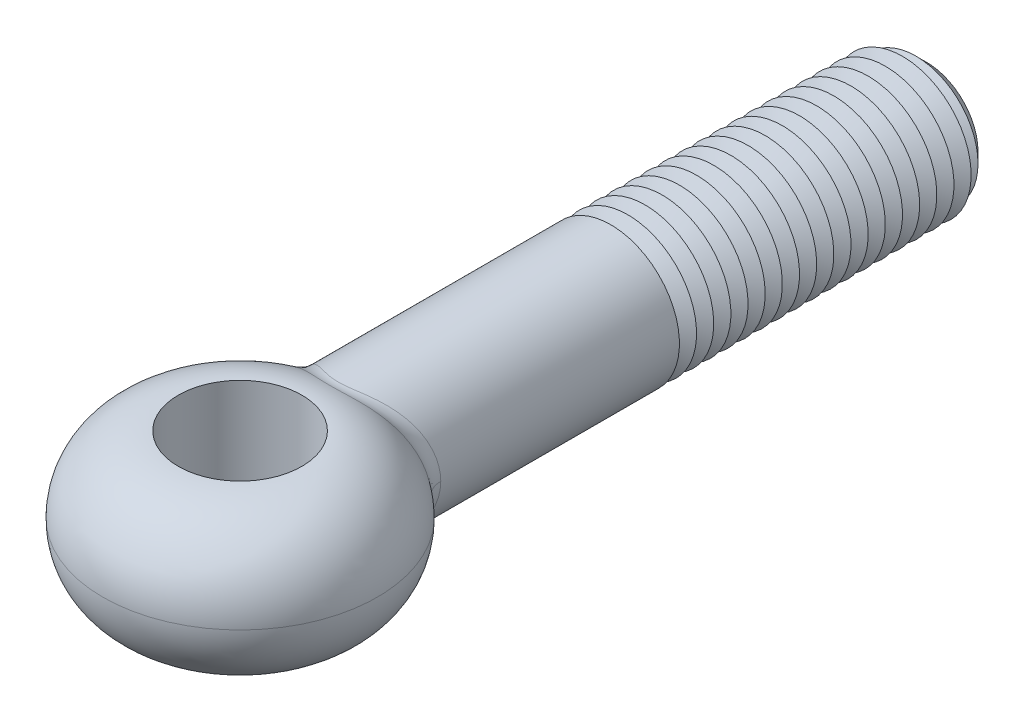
ISO-10303-21;
HEADER;
FILE_DESCRIPTION(('STEP AP214'),'2;1');
FILE_NAME('part.step','',(''),(''),'','','');
FILE_SCHEMA(('AUTOMOTIVE_DESIGN { 1 0 10303 214 1 1 1 1 }'));
ENDSEC;
DATA;
#1=APPLICATION_CONTEXT('core data for automotive mechanical design processes');
#2=APPLICATION_PROTOCOL_DEFINITION('international standard','automotive_design',2000,#1);
#3=PRODUCT_CONTEXT('',#1,'mechanical');
#4=PRODUCT('Part','Part','',(#3));
#5=PRODUCT_RELATED_PRODUCT_CATEGORY('part','',(#4));
#6=PRODUCT_DEFINITION_FORMATION('','',#4);
#7=PRODUCT_DEFINITION_CONTEXT('part definition',#1,'design');
#8=PRODUCT_DEFINITION('design','',#6,#7);
#9=PRODUCT_DEFINITION_SHAPE('','',#8);
#10=(LENGTH_UNIT() NAMED_UNIT(*) SI_UNIT(.MILLI.,.METRE.));
#11=(NAMED_UNIT(*) PLANE_ANGLE_UNIT() SI_UNIT($,.RADIAN.));
#12=(NAMED_UNIT(*) SI_UNIT($,.STERADIAN.) SOLID_ANGLE_UNIT());
#13=UNCERTAINTY_MEASURE_WITH_UNIT(LENGTH_MEASURE(1.E-05),#10,'distance_accuracy_value','');
#14=(GEOMETRIC_REPRESENTATION_CONTEXT(3) GLOBAL_UNCERTAINTY_ASSIGNED_CONTEXT((#13)) GLOBAL_UNIT_ASSIGNED_CONTEXT((#10,
#11,#12)) REPRESENTATION_CONTEXT('',''));
#15=CARTESIAN_POINT('',(0.,0.,0.));
#16=DIRECTION('',(0.,0.,1.));
#17=DIRECTION('',(1.,0.,0.));
#18=AXIS2_PLACEMENT_3D('',#15,#16,#17);
#19=CARTESIAN_POINT('',(0.,0.,-100.));
#20=DIRECTION('',(0.,0.,1.));
#21=DIRECTION('',(1.,0.,0.));
#22=AXIS2_PLACEMENT_3D('',#19,#20,#21);
#23=CYLINDRICAL_SURFACE('',#22,10.);
#24=CARTESIAN_POINT('',(0.,0.,-54.));
#25=DIRECTION('',(0.,0.,-1.));
#26=DIRECTION('',(-1.,0.,0.));
#27=AXIS2_PLACEMENT_3D('',#24,#25,#26);
#28=CIRCLE('',#27,10.);
#29=CARTESIAN_POINT('',(-10.,0.,-54.));
#30=VERTEX_POINT('',#29);
#31=EDGE_CURVE('E78',#30,#30,#28,.T.);
#32=ORIENTED_EDGE('',*,*,#31,.F.);
#33=EDGE_LOOP('',(#32));
#34=FACE_BOUND('',#33,.T.);
#35=CARTESIAN_POINT('',(9.43452897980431,-5.9855471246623,-15.5975544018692));
#36=CARTESIAN_POINT('',(8.34423805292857,-5.52525611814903,-16.6059320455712));
#37=CARTESIAN_POINT('',(8.11431624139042,-5.84447362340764,-18.1101473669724));
#38=CARTESIAN_POINT('',(9.60050520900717,-5.77068079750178,-15.6600678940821));
#39=CARTESIAN_POINT('',(8.48250308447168,-5.3158455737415,-16.6734523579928));
#40=CARTESIAN_POINT('',(8.26546699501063,-5.63467148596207,-18.2014690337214));
#41=CARTESIAN_POINT('',(9.7577841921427,-5.54896856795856,-15.7193267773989));
#42=CARTESIAN_POINT('',(8.61224377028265,-5.10213898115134,-16.7368596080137));
#43=CARTESIAN_POINT('',(8.40899835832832,-5.41818479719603,-18.2879579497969));
#44=CARTESIAN_POINT('',(10.053869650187,-5.09311935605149,-15.8308850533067));
#45=CARTESIAN_POINT('',(8.85513381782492,-4.66620933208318,-16.8556211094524));
#46=CARTESIAN_POINT('',(8.6796419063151,-4.9730795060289,-18.4506608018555));
#47=CARTESIAN_POINT('',(10.1926707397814,-4.85897877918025,-15.8831824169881));
#48=CARTESIAN_POINT('',(8.96815881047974,-4.44404031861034,-16.9109148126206));
#49=CARTESIAN_POINT('',(8.80674930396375,-4.74445739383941,-18.5268717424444));
#50=CARTESIAN_POINT('',(10.4506831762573,-4.37955751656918,-15.9803525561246));
#51=CARTESIAN_POINT('',(9.17718300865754,-3.99242395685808,-17.0131862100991));
#52=CARTESIAN_POINT('',(9.04332894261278,-4.27633562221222,-18.6683874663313));
#53=CARTESIAN_POINT('',(10.5698855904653,-4.13427181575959,-16.0252219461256));
#54=CARTESIAN_POINT('',(9.27305982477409,-3.76305815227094,-17.0601040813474));
#55=CARTESIAN_POINT('',(9.15279314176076,-4.03683106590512,-18.7336872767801));
#56=CARTESIAN_POINT('',(10.7875880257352,-3.634260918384,-16.1071213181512));
#57=CARTESIAN_POINT('',(9.44739138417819,-3.29841554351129,-17.1454161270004));
#58=CARTESIAN_POINT('',(9.35291302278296,-3.54860493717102,-18.8528181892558));
#59=CARTESIAN_POINT('',(10.8860907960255,-3.37953698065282,-16.1441523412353));
#60=CARTESIAN_POINT('',(9.52574461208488,-3.063249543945,-17.183760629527));
#61=CARTESIAN_POINT('',(9.4435712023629,-3.29988459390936,-18.906650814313));
#62=CARTESIAN_POINT('',(11.0586995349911,-2.87065864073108,-16.2090049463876));
#63=CARTESIAN_POINT('',(9.66255871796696,-2.5958661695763,-17.2507122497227));
#64=CARTESIAN_POINT('',(9.60255363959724,-2.80300001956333,-19.0008915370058));
#65=CARTESIAN_POINT('',(11.1334873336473,-2.61674859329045,-16.237084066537));
#66=CARTESIAN_POINT('',(9.72150133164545,-2.36390013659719,-17.2795551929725));
#67=CARTESIAN_POINT('',(9.67150157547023,-2.555074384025,-19.041675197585));
#68=CARTESIAN_POINT('',(11.2622086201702,-2.10328461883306,-16.2853899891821));
#69=CARTESIAN_POINT('',(9.82270778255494,-1.89657583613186,-17.3290774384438));
#70=CARTESIAN_POINT('',(9.79023230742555,-2.05371225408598,-19.1118184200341));
#71=CARTESIAN_POINT('',(11.3161352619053,-1.84372886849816,-16.3056142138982));
#72=CARTESIAN_POINT('',(9.8649025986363,-1.66135361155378,-17.349722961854));
#73=CARTESIAN_POINT('',(9.84000881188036,-1.80027397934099,-19.1411742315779));
#74=CARTESIAN_POINT('',(11.4025652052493,-1.32109132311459,-16.338018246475));
#75=CARTESIAN_POINT('',(9.93244623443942,-1.18887816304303,-17.3827703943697));
#76=CARTESIAN_POINT('',(9.91981122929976,-1.28995449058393,-19.1882016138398));
#77=CARTESIAN_POINT('',(11.435087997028,-1.05801295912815,-16.3502053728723));
#78=CARTESIAN_POINT('',(9.95776661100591,-0.951775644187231,-17.3951583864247));
#79=CARTESIAN_POINT('',(9.94985511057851,-1.0330766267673,-19.2058838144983));
#80=CARTESIAN_POINT('',(11.4784864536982,-0.529957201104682,-16.3664661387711));
#81=CARTESIAN_POINT('',(9.99155479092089,-0.476371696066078,-17.4116890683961));
#82=CARTESIAN_POINT('',(9.98994969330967,-0.517466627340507,-19.2294751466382));
#83=CARTESIAN_POINT('',(11.4893618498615,-0.264979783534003,-16.3705396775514));
#84=CARTESIAN_POINT('',(10.0000000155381,-0.238226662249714,-17.415820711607));
#85=CARTESIAN_POINT('',(10.0000001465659,-0.258734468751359,-19.2353841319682));
#86=CARTESIAN_POINT('',(11.4893615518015,0.269629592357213,-16.3705395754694));
#87=CARTESIAN_POINT('',(9.99999998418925,0.242407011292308,-17.4158206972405));
#88=CARTESIAN_POINT('',(9.99999985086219,0.263274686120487,-19.2353839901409));
#89=CARTESIAN_POINT('',(11.4781008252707,0.53926163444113,-16.3663217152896));
#90=CARTESIAN_POINT('',(9.9912557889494,0.48473250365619,-17.4115427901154));
#91=CARTESIAN_POINT('',(9.98959327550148,0.526551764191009,-19.2292656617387));
#92=CARTESIAN_POINT('',(11.4331665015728,1.07653539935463,-16.3494853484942));
#93=CARTESIAN_POINT('',(9.9562701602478,0.968459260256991,-17.3944262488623));
#94=CARTESIAN_POINT('',(9.94808005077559,1.05116251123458,-19.2048391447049));
#95=CARTESIAN_POINT('',(11.3994921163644,1.3441770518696,-16.3368665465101));
#96=CARTESIAN_POINT('',(9.9300520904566,1.20969577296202,-17.3815990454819));
#97=CARTESIAN_POINT('',(9.91697267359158,1.31249611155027,-19.1865305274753));
#98=CARTESIAN_POINT('',(11.3100467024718,1.8755498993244,-16.3033310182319));
#99=CARTESIAN_POINT('',(9.86013961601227,1.69016143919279,-17.347392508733));
#100=CARTESIAN_POINT('',(9.83438836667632,1.83134501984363,-19.1378602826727));
#101=CARTESIAN_POINT('',(11.254271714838,2.13928038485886,-16.2824128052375));
#102=CARTESIAN_POINT('',(9.81648899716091,1.9292337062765,-17.3260346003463));
#103=CARTESIAN_POINT('',(9.78290778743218,2.08885963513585,-19.1074964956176));
#104=CARTESIAN_POINT('',(11.1211278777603,2.66099186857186,-16.2324443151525));
#105=CARTESIAN_POINT('',(9.71176614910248,2.40426315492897,-17.2747914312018));
#106=CARTESIAN_POINT('',(9.66010560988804,2.59827488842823,-19.0349366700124));
#107=CARTESIAN_POINT('',(11.043751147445,2.91897073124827,-16.2033910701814));
#108=CARTESIAN_POINT('',(9.65075538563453,2.64007593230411,-17.2449362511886));
#109=CARTESIAN_POINT('',(9.58877677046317,2.85017344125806,-18.9927363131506));
#110=CARTESIAN_POINT('',(10.8683072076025,3.42676440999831,-16.1374676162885));
#111=CARTESIAN_POINT('',(9.51159962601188,3.10681781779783,-17.1768385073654));
#112=CARTESIAN_POINT('',(9.42720199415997,3.34599891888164,-18.8969337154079));
#113=CARTESIAN_POINT('',(10.7702839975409,3.67659530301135,-16.1006140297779));
#114=CARTESIAN_POINT('',(9.43357674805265,3.33762998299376,-17.1386557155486));
#115=CARTESIAN_POINT('',(9.33699628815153,3.58994154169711,-18.8433557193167));
#116=CARTESIAN_POINT('',(10.5542593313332,4.1671394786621,-16.0193404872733));
#117=CARTESIAN_POINT('',(9.26049301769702,3.79376863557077,-17.0539542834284));
#118=CARTESIAN_POINT('',(9.13844085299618,4.06892407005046,-18.7251285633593));
#119=CARTESIAN_POINT('',(10.4362490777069,4.40784868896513,-15.9749171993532));
#120=CARTESIAN_POINT('',(9.1655238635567,4.01898948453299,-17.0074805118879));
#121=CARTESIAN_POINT('',(9.0300831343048,4.30395999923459,-18.6604745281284));
#122=CARTESIAN_POINT('',(10.1813021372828,4.87847620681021,-15.8789002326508));
#123=CARTESIAN_POINT('',(8.95890120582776,4.4625267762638,-16.9063865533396));
#124=CARTESIAN_POINT('',(8.7963369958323,4.76349528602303,-18.5206320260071));
#125=CARTESIAN_POINT('',(10.0443720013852,5.10839821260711,-15.8273090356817));
#126=CARTESIAN_POINT('',(8.84736248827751,4.68076606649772,-16.8518224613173));
#127=CARTESIAN_POINT('',(8.67095447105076,4.98799825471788,-18.4454472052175));
#128=CARTESIAN_POINT('',(9.75260585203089,5.55625016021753,-15.7173729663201));
#129=CARTESIAN_POINT('',(8.60795982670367,5.10918973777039,-16.7347636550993));
#130=CARTESIAN_POINT('',(8.40427110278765,5.42529476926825,-18.2851064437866));
#131=CARTESIAN_POINT('',(9.59776873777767,5.77417936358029,-15.6590276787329));
#132=CARTESIAN_POINT('',(8.48020856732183,5.31932036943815,-16.6723238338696));
#133=CARTESIAN_POINT('',(8.26296928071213,5.63808759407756,-18.1999498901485));
#134=CARTESIAN_POINT('',(9.26615260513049,6.20356593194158,-15.534146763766));
#135=CARTESIAN_POINT('',(8.20461231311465,5.73672793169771,-16.5377554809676));
#136=CARTESIAN_POINT('',(7.96098558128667,6.0573539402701,-18.0175190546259));
#137=CARTESIAN_POINT('',(9.08883645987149,6.4146038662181,-15.4674111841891));
#138=CARTESIAN_POINT('',(8.05636478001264,5.94370774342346,-16.4654337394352));
#139=CARTESIAN_POINT('',(7.7998337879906,6.26341791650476,-17.9199477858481));
#140=CARTESIAN_POINT('',(8.71758429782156,6.82162435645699,-15.3279355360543));
#141=CARTESIAN_POINT('',(7.74367757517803,6.34640999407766,-16.3131822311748));
#142=CARTESIAN_POINT('',(7.4633054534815,6.66084533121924,-17.7158184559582));
#143=CARTESIAN_POINT('',(8.52365283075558,7.01761100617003,-15.2551971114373));
#144=CARTESIAN_POINT('',(7.57936139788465,6.54213539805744,-16.2333112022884));
#145=CARTESIAN_POINT('',(7.28793280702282,6.85221276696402,-17.6092628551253));
#146=CARTESIAN_POINT('',(8.12016404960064,7.39386400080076,-15.1043942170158));
#147=CARTESIAN_POINT('',(7.23510051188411,6.92124197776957,-16.0665300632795));
#148=CARTESIAN_POINT('',(6.92417984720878,7.21959784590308,-17.3881065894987));
#149=CARTESIAN_POINT('',(7.91059883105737,7.57412229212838,-15.0263270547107));
#150=CARTESIAN_POINT('',(7.05525523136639,7.10464535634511,-15.9796657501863));
#151=CARTESIAN_POINT('',(6.735792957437,7.39560762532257,-17.2735018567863));
#152=CARTESIAN_POINT('',(7.47700680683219,7.91811936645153,-14.8657958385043));
#153=CARTESIAN_POINT('',(6.6807721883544,7.45778289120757,-15.7997990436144));
#154=CARTESIAN_POINT('',(6.34742931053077,7.73149702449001,-17.037563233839));
#155=CARTESIAN_POINT('',(7.2529835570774,8.08186218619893,-14.7833328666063));
#156=CARTESIAN_POINT('',(6.48622962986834,7.62757357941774,-15.7068372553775));
#157=CARTESIAN_POINT('',(6.14745540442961,7.89138058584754,-16.9162309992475));
#158=CARTESIAN_POINT('',(6.77134336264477,8.40579390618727,-14.6078016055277));
#159=CARTESIAN_POINT('',(6.06569707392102,7.96638984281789,-15.507686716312));
#160=CARTESIAN_POINT('',(5.71933908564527,8.20767755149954,-16.6576501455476));
#161=CARTESIAN_POINT('',(6.512495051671,8.56446092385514,-14.5144317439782));
#162=CARTESIAN_POINT('',(5.83842837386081,8.13426205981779,-15.4010317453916));
#163=CARTESIAN_POINT('',(5.49025421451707,8.36260494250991,-16.5199309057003));
#164=CARTESIAN_POINT('',(5.97928293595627,8.8614010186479,-14.3254807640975));
#165=CARTESIAN_POINT('',(5.36786976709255,8.45139804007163,-15.1837485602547));
#166=CARTESIAN_POINT('',(5.02091237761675,8.65254644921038,-16.240859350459));
#167=CARTESIAN_POINT('',(5.70491599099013,8.99966994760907,-14.2298992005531));
#168=CARTESIAN_POINT('',(5.12463036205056,8.60077991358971,-15.07312594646));
#169=CARTESIAN_POINT('',(4.78065315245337,8.78755651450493,-16.0995063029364));
#170=CARTESIAN_POINT('',(5.1405320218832,9.25561084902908,-14.0388519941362));
#171=CARTESIAN_POINT('',(4.62232310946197,8.87981959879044,-14.8506895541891));
#172=CARTESIAN_POINT('',(4.28955099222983,9.03746513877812,-15.8166039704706));
#173=CARTESIAN_POINT('',(4.85049666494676,9.37325797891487,-13.9433866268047));
#174=CARTESIAN_POINT('',(4.36324512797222,9.00959558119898,-14.7388483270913));
#175=CARTESIAN_POINT('',(4.03869573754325,9.15233944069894,-15.6750546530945));
#176=CARTESIAN_POINT('',(4.25463017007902,9.58739445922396,-13.7561899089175));
#177=CARTESIAN_POINT('',(3.82959253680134,9.24785728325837,-14.5184109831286));
#178=CARTESIAN_POINT('',(3.52704154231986,9.36142893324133,-15.3971561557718));
#179=CARTESIAN_POINT('',(3.94880498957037,9.68389171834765,-13.6644571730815));
#180=CARTESIAN_POINT('',(3.55497971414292,9.35650417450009,-14.4097498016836));
#181=CARTESIAN_POINT('',(3.26624636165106,9.45565184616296,-15.2608050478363));
#182=CARTESIAN_POINT('',(3.43589915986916,9.82367399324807,-13.5221298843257));
#183=CARTESIAN_POINT('',(3.09349956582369,9.5152325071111,-14.2403576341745));
#184=CARTESIAN_POINT('',(2.83229257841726,9.59213958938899,-15.0490317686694));
#185=CARTESIAN_POINT('',(3.23387124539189,9.87347664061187,-13.4688140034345));
#186=CARTESIAN_POINT('',(2.91169341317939,9.57213232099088,-14.1767435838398));
#187=CARTESIAN_POINT('',(2.66218071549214,9.64076843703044,-14.9696450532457));
#188=CARTESIAN_POINT('',(2.82276410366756,9.96416789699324,-13.3676828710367));
#189=CARTESIAN_POINT('',(2.54161663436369,9.67624211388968,-14.05582083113));
#190=CARTESIAN_POINT('',(2.31773787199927,9.72932218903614,-14.8189766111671));
#191=CARTESIAN_POINT('',(2.61368516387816,10.0050568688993,-13.319867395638));
#192=CARTESIAN_POINT('',(2.35330062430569,9.72349213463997,-13.9984773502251));
#193=CARTESIAN_POINT('',(2.14340706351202,9.76924744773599,-14.7476945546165));
#194=CARTESIAN_POINT('',(2.18934081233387,10.0774084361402,-13.232234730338));
#195=CARTESIAN_POINT('',(1.97112322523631,9.80743490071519,-13.8932151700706));
#196=CARTESIAN_POINT('',(1.79125705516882,9.83989375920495,-14.6169946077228));
#197=CARTESIAN_POINT('',(1.97410477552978,10.1089095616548,-13.1923850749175));
#198=CARTESIAN_POINT('',(1.77722521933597,9.84420740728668,-13.8452196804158));
#199=CARTESIAN_POINT('',(1.61345539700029,9.87065243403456,-14.5575285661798));
#200=CARTESIAN_POINT('',(1.53721646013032,10.1622357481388,-13.1231108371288));
#201=CARTESIAN_POINT('',(1.38378639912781,9.90663622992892,-13.7617076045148));
#202=CARTESIAN_POINT('',(1.25400645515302,9.92272177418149,-14.4541203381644));
#203=CARTESIAN_POINT('',(1.31556607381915,10.1840636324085,-13.0936832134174));
#204=CARTESIAN_POINT('',(1.18416025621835,9.93232760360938,-13.7261484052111));
#205=CARTESIAN_POINT('',(1.07236030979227,9.94403519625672,-14.4101736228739));
#206=CARTESIAN_POINT('',(0.901086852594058,10.2150338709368,-13.0512803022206));
#207=CARTESIAN_POINT('',(0.811010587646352,9.96883413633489,-13.6748948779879));
#208=CARTESIAN_POINT('',(0.733646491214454,9.97427549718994,-14.3468387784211));
#209=CARTESIAN_POINT('',(0.708925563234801,10.225588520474,-13.0364985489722));
#210=CARTESIAN_POINT('',(0.638016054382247,9.9813164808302,-13.6570022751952));
#211=CARTESIAN_POINT('',(0.576981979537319,9.98458138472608,-14.3247545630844));
#212=CARTESIAN_POINT('',(0.32280480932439,10.239115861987,-13.0174775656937));
#213=CARTESIAN_POINT('',(0.290519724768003,9.99731568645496,-13.6339840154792));
#214=CARTESIAN_POINT('',(0.2625642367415,9.99778989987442,-14.2963356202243));
#215=CARTESIAN_POINT('',(0.128845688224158,10.2420899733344,-13.0132363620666));
#216=CARTESIAN_POINT('',(0.11594169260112,10.0008413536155,-13.6288457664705));
#217=CARTESIAN_POINT('',(0.104811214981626,10.0006939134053,-14.2899979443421));
#218=CARTESIAN_POINT('',(-0.258903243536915,10.2403820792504,-13.0156565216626));
#219=CARTESIAN_POINT('',(-0.232987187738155,9.99881931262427,-13.6317755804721));
#220=CARTESIAN_POINT('',(-0.210605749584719,9.9990262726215,-14.2936141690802));
#221=CARTESIAN_POINT('',(-0.452692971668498,10.235697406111,-13.0223216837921));
#222=CARTESIAN_POINT('',(-0.407417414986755,9.99326752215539,-13.6398495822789));
#223=CARTESIAN_POINT('',(-0.368269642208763,9.99445201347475,-14.3035737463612));
#224=CARTESIAN_POINT('',(-0.838056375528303,10.2187856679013,-13.0459971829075));
#225=CARTESIAN_POINT('',(-0.754249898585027,9.97327695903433,-13.6684946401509));
#226=CARTESIAN_POINT('',(-0.682255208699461,9.97793886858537,-14.3389452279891));
#227=CARTESIAN_POINT('',(-1.02962955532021,10.2065569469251,-13.0630097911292));
#228=CARTESIAN_POINT('',(-0.926726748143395,9.95882742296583,-13.6890809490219));
#229=CARTESIAN_POINT('',(-0.838576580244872,9.96599836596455,-14.3643605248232));
#230=CARTESIAN_POINT('',(-1.47709063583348,10.1691133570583,-13.113849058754));
#231=CARTESIAN_POINT('',(-1.32963595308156,9.91473356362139,-13.7505127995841));
#232=CARTESIAN_POINT('',(-1.20464773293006,9.92943728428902,-14.4402891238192));
#233=CARTESIAN_POINT('',(-1.73139053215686,10.140813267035,-13.151518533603));
#234=CARTESIAN_POINT('',(-1.5587089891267,9.88147336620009,-13.7960088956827));
#235=CARTESIAN_POINT('',(-1.41344202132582,9.90180420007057,-14.4965358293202));
#236=CARTESIAN_POINT('',(-2.23104582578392,10.0715291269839,-13.239514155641));
#237=CARTESIAN_POINT('',(-2.00870802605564,9.80059822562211,-13.9019685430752));
#238=CARTESIAN_POINT('',(-1.8256925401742,9.83415301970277,-14.6278545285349));
#239=CARTESIAN_POINT('',(-2.47639580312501,10.0305375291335,-13.2898478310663));
#240=CARTESIAN_POINT('',(-2.22975057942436,9.75292233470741,-13.9625022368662));
#241=CARTESIAN_POINT('',(-2.02914551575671,9.79412755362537,-14.7029377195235));
#242=CARTESIAN_POINT('',(-2.9588911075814,9.93629512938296,-13.3995119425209));
#243=CARTESIAN_POINT('',(-2.66423463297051,9.64414242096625,-14.0939421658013));
#244=CARTESIAN_POINT('',(-2.43144462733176,9.70210635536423,-14.8664118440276));
#245=CARTESIAN_POINT('',(-3.19598869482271,9.88298340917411,-13.4588865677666));
#246=CARTESIAN_POINT('',(-2.87771399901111,9.58291258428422,-14.1649560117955));
#247=CARTESIAN_POINT('',(-2.63026227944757,9.65005114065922,-14.9548681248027));
#248=CARTESIAN_POINT('',(-3.66094239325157,9.76467554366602,-13.5832721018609));
#249=CARTESIAN_POINT('',(-3.29595689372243,9.44812095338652,-14.3131723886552));
#250=CARTESIAN_POINT('',(-3.02232846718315,9.53453167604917,-15.1400304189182));
#251=CARTESIAN_POINT('',(-3.88879902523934,9.69968005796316,-13.648282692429));
#252=CARTESIAN_POINT('',(-3.50077505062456,9.37449775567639,-14.3904211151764));
#253=CARTESIAN_POINT('',(-3.21557731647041,9.47106807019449,-15.2367359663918));
#254=CARTESIAN_POINT('',(-4.44320756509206,9.52429263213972,-13.813552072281));
#255=CARTESIAN_POINT('',(-3.99876446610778,9.17730333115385,-14.5861617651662));
#256=CARTESIAN_POINT('',(-3.68829661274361,9.29981435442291,-15.4823644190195));
#257=CARTESIAN_POINT('',(-4.76458779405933,9.40709204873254,-13.9157408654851));
#258=CARTESIAN_POINT('',(-4.28661274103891,9.04678997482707,-14.7065021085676));
#259=CARTESIAN_POINT('',(-3.96458981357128,9.18537607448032,-15.6340547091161));
#260=CARTESIAN_POINT('',(-5.38930158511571,9.14816852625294,-14.12183146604));
#261=CARTESIAN_POINT('',(-4.84418122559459,8.76215134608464,-14.9475940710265));
#262=CARTESIAN_POINT('',(-4.50539064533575,8.93255512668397,-15.9395491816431));
#263=CARTESIAN_POINT('',(-5.69262932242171,9.00643772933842,-14.2257338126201));
#264=CARTESIAN_POINT('',(-5.11390788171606,8.60783261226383,-15.0683962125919));
#265=CARTESIAN_POINT('',(-4.76989446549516,8.79416478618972,-16.0933540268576));
#266=CARTESIAN_POINT('',(-6.2807517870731,8.69911934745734,-14.4315862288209));
#267=CARTESIAN_POINT('',(-5.63445612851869,8.27743175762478,-15.306083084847));
#268=CARTESIAN_POINT('',(-5.28576367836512,8.49408959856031,-16.3976428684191));
#269=CARTESIAN_POINT('',(-6.56557804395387,8.53357398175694,-14.5335393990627));
#270=CARTESIAN_POINT('',(-5.8852609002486,8.1012237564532,-15.4229792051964));
#271=CARTESIAN_POINT('',(-5.53715127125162,8.33244597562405,-16.5481322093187));
#272=CARTESIAN_POINT('',(-7.11655081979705,8.17895147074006,-14.7332405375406));
#273=CARTESIAN_POINT('',(-6.36771692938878,7.72839278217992,-15.6503344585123));
#274=CARTESIAN_POINT('',(-6.02582390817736,7.98618157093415,-16.8424988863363));
#275=CARTESIAN_POINT('',(-7.38269879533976,7.98987616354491,-14.8309888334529));
#276=CARTESIAN_POINT('',(-6.5992657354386,7.53164079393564,-15.7607606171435));
#277=CARTESIAN_POINT('',(-6.26311005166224,7.80156258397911,-16.9863767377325));
#278=CARTESIAN_POINT('',(-7.89448355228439,7.58937034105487,-15.0202729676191));
#279=CARTESIAN_POINT('',(-7.04171419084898,7.11984304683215,-15.9730734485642));
#280=CARTESIAN_POINT('',(-6.72123688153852,7.41049629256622,-17.2646275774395));
#281=CARTESIAN_POINT('',(-8.14016591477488,7.37799201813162,-15.1118225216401));
#282=CARTESIAN_POINT('',(-7.25251801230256,6.9047481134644,-16.0749191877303));
#283=CARTESIAN_POINT('',(-6.9421139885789,7.20409995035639,-17.3990215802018));
#284=CARTESIAN_POINT('',(-8.61006535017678,6.93354564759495,-15.2875527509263));
#285=CARTESIAN_POINT('',(-7.65299610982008,6.45765789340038,-16.2690458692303));
#286=CARTESIAN_POINT('',(-7.36595828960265,6.77012874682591,-17.656686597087));
#287=CARTESIAN_POINT('',(-8.83428130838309,6.70047647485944,-15.371733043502));
#288=CARTESIAN_POINT('',(-7.8424935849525,6.22562042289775,-16.361245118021));
#289=CARTESIAN_POINT('',(-7.56892455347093,6.5425527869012,-17.7799570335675));
#290=CARTESIAN_POINT('',(-9.25940881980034,6.21400101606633,-15.5315844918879));
#291=CARTESIAN_POINT('',(-8.19932512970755,5.74654163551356,-16.5351494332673));
#292=CARTESIAN_POINT('',(-7.95478255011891,6.06754307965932,-18.0137900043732));
#293=CARTESIAN_POINT('',(-9.46031551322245,5.96059050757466,-15.6072538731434));
#294=CARTESIAN_POINT('',(-8.36645913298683,5.49950956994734,-16.6167587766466));
#295=CARTESIAN_POINT('',(-8.13767009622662,5.82010520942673,-18.1243498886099));
#296=CARTESIAN_POINT('',(-9.83679553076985,5.43527222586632,-15.7490893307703));
#297=CARTESIAN_POINT('',(-8.67756159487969,4.99254792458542,-16.7687780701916));
#298=CARTESIAN_POINT('',(-8.48110805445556,5.3071681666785,-18.3313946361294));
#299=CARTESIAN_POINT('',(-10.0123724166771,5.16336706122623,-15.8152567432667));
#300=CARTESIAN_POINT('',(-8.82133112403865,4.7326884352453,-16.8390914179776));
#301=CARTESIAN_POINT('',(-8.64166160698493,5.04167154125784,-18.4278814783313));
#302=CARTESIAN_POINT('',(-10.3212633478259,4.62921939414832,-15.9316192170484));
#303=CARTESIAN_POINT('',(-9.07266333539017,4.22688436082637,-16.9620419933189));
#304=CARTESIAN_POINT('',(-8.92458732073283,4.52011321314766,-18.5974339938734));
#305=CARTESIAN_POINT('',(-10.4569869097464,4.36841996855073,-15.9827265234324));
#306=CARTESIAN_POINT('',(-9.18224116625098,3.98188546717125,-17.0156619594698));
#307=CARTESIAN_POINT('',(-9.04911967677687,4.26546057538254,-18.671841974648));
#308=CARTESIAN_POINT('',(-10.7046952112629,3.83526953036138,-16.0759469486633));
#309=CARTESIAN_POINT('',(-9.3812489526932,3.48456856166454,-17.1130474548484));
#310=CARTESIAN_POINT('',(-9.27666839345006,3.74487597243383,-18.8074855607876));
#311=CARTESIAN_POINT('',(-10.8166824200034,3.5629197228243,-16.1180610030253));
#312=CARTESIAN_POINT('',(-9.47054625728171,3.23238025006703,-17.156748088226));
#313=CARTESIAN_POINT('',(-9.37968699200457,3.47894518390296,-18.8687225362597));
#314=CARTESIAN_POINT('',(-11.0155728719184,3.00929549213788,-16.1928087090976));
#315=CARTESIAN_POINT('',(-9.62851946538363,2.72270494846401,-17.2340550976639));
#316=CARTESIAN_POINT('',(-9.56280689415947,2.93836933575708,-18.977363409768));
#317=CARTESIAN_POINT('',(-11.1025230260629,2.72803886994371,-16.2254600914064));
#318=CARTESIAN_POINT('',(-9.69711918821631,2.46538774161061,-17.2676241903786));
#319=CARTESIAN_POINT('',(-9.64295105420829,2.66374165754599,-19.0247931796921));
#320=CARTESIAN_POINT('',(-11.2506400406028,2.15853827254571,-16.2810514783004));
#321=CARTESIAN_POINT('',(-9.81366746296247,1.94660748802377,-17.324654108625));
#322=CARTESIAN_POINT('',(-9.77955371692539,2.10766363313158,-19.1055210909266));
#323=CARTESIAN_POINT('',(-11.3118190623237,1.87029766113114,-16.3039960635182));
#324=CARTESIAN_POINT('',(-9.86153588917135,1.68533214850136,-17.3480757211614));
#325=CARTESIAN_POINT('',(-9.83602339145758,1.82621657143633,-19.1388258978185));
#326=CARTESIAN_POINT('',(-11.4028551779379,1.31891290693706,-16.3381269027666));
#327=CARTESIAN_POINT('',(-9.93267162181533,1.18691316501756,-17.3828806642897));
#328=CARTESIAN_POINT('',(-9.92007913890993,1.28782741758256,-19.1883592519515));
#329=CARTESIAN_POINT('',(-11.4352749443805,1.05621556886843,-16.350275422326));
#330=CARTESIAN_POINT('',(-9.95791206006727,0.95015650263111,-17.3952295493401));
#331=CARTESIAN_POINT('',(-9.95002783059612,1.03132159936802,-19.2059854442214));
#332=CARTESIAN_POINT('',(-11.4785246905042,0.529012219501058,-16.3664804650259));
#333=CARTESIAN_POINT('',(-9.99158458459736,0.475522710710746,-17.4117036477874));
#334=CARTESIAN_POINT('',(-9.9899850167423,0.516543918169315,-19.2294959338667));
#335=CARTESIAN_POINT('',(-11.4893616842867,0.264506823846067,-16.3705396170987));
#336=CARTESIAN_POINT('',(-9.99999992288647,0.23780149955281,-17.4158206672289));
#337=CARTESIAN_POINT('',(-9.99999998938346,0.258272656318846,-19.2353840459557));
#338=CARTESIAN_POINT('',(-11.4893617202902,-0.269274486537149,-16.3705396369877));
#339=CARTESIAN_POINT('',(-10.0000000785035,-0.242087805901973,-17.4158207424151));
#340=CARTESIAN_POINT('',(-10.0000000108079,-0.262927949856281,-19.2353840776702));
#341=CARTESIAN_POINT('',(-11.4781305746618,-0.538550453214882,-16.3663328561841));
#342=CARTESIAN_POINT('',(-9.99127884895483,-0.484093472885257,-17.41155407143));
#343=CARTESIAN_POINT('',(-9.98962077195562,-0.525857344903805,-19.2292818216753));
#344=CARTESIAN_POINT('',(-11.4333067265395,-1.07521295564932,-16.3495378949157));
#345=CARTESIAN_POINT('',(-9.95637938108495,-0.967267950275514,-17.3944796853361));
#346=CARTESIAN_POINT('',(-9.94820958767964,-1.04987123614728,-19.2049153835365));
#347=CARTESIAN_POINT('',(-11.3997055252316,-1.34259873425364,-16.3369465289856));
#348=CARTESIAN_POINT('',(-9.93021837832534,-1.2082722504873,-17.3816804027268));
#349=CARTESIAN_POINT('',(-9.91716979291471,-1.31095499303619,-19.1866465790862));
#350=CARTESIAN_POINT('',(-11.310346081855,-1.87408052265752,-16.303443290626));
#351=CARTESIAN_POINT('',(-9.86037403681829,-1.68882951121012,-17.3475072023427));
#352=CARTESIAN_POINT('',(-9.83466469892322,-1.82991027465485,-19.1380232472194));
#353=CARTESIAN_POINT('',(-11.2545333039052,-2.13816677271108,-16.2825109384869));
#354=CARTESIAN_POINT('',(-9.81669446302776,-1.92822118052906,-17.3261351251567));
#355=CARTESIAN_POINT('',(-9.78314912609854,-2.0877722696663,-19.1076389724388));
#356=CARTESIAN_POINT('',(-11.1212790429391,-2.66048788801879,-16.2325010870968));
#357=CARTESIAN_POINT('',(-9.71188550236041,-2.40380188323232,-17.2748498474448));
#358=CARTESIAN_POINT('',(-9.66024496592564,-2.59778278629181,-19.0350191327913));
#359=CARTESIAN_POINT('',(-11.0438369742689,-2.91872259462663,-16.2034233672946));
#360=CARTESIAN_POINT('',(-9.65082369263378,-2.63984697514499,-17.2449697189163));
#361=CARTESIAN_POINT('',(-9.58885584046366,-2.84993115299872,-18.9927832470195));
#362=CARTESIAN_POINT('',(-10.8681953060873,-3.42708801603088,-16.1374255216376));
#363=CARTESIAN_POINT('',(-9.51151104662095,-3.10711477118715,-17.1767951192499));
#364=CARTESIAN_POINT('',(-9.42709891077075,-3.34631489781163,-18.8968725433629));
#365=CARTESIAN_POINT('',(-10.7700335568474,-3.67723256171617,-16.1005196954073));
#366=CARTESIAN_POINT('',(-9.43337750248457,-3.33821895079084,-17.1385580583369));
#367=CARTESIAN_POINT('',(-9.33676571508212,-3.59056378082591,-18.8432185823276));
#368=CARTESIAN_POINT('',(-10.5537166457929,-4.16830295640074,-16.0191364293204));
#369=CARTESIAN_POINT('',(-9.26005752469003,-3.79485238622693,-17.0537413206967));
#370=CARTESIAN_POINT('',(-9.13794243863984,-4.07006012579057,-18.7248316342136));
#371=CARTESIAN_POINT('',(-10.4355590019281,-4.4092276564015,-15.9746580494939));
#372=CARTESIAN_POINT('',(-9.16496856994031,-4.02027727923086,-17.0072093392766));
#373=CARTESIAN_POINT('',(-9.02945010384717,-4.30530646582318,-18.6600972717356));
#374=CARTESIAN_POINT('',(-10.1805249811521,-4.87980527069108,-15.8786068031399));
#375=CARTESIAN_POINT('',(-8.9582676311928,-4.46379094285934,-16.9060760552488));
#376=CARTESIAN_POINT('',(-8.79562481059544,-4.76479302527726,-18.5202044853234));
#377=CARTESIAN_POINT('',(-10.0436912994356,-5.10948231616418,-15.8270501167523));
#378=CARTESIAN_POINT('',(-8.84680285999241,-4.68181416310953,-16.8515466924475));
#379=CARTESIAN_POINT('',(-8.67033027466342,-4.98905680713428,-18.4450698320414));
#380=CARTESIAN_POINT('',(-9.75220852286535,-5.55682061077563,-15.7172256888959));
#381=CARTESIAN_POINT('',(-8.60763391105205,-5.10972638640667,-16.7346064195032));
#382=CARTESIAN_POINT('',(-8.40390994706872,-5.42585177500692,-18.2848913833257));
#383=CARTESIAN_POINT('',(-9.59756440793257,-5.77448519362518,-15.6589598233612));
#384=CARTESIAN_POINT('',(-8.48004754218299,-5.31956459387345,-16.672252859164));
#385=CARTESIAN_POINT('',(-8.2627885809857,-5.63838621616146,-18.1998503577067));
#386=CARTESIAN_POINT('',(-9.43452897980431,-5.9855471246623,-15.5975544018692));
#387=CARTESIAN_POINT('',(-8.34423805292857,-5.52525611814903,-16.6059320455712));
#388=CARTESIAN_POINT('',(-8.11431624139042,-5.84447362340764,-18.1101473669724));
#389=(BOUNDED_SURFACE() B_SPLINE_SURFACE(3,2,((#35,#36,#37),(#38,#39,#40),(#41,#42,#43),(#44,
#45,#46),(#47,#48,#49),(#50,#51,#52),(#53,#54,#55),(#56,#57,#58),(#59,#60,#61),(#62,#63,#64),
(#65,#66,#67),(#68,#69,#70),(#71,#72,#73),(#74,#75,#76),(#77,#78,#79),(#80,#81,#82),(#83,#84,
#85),(#86,#87,#88),(#89,#90,#91),(#92,#93,#94),(#95,#96,#97),(#98,#99,#100),(#101,#102,#103),
(#104,#105,#106),(#107,#108,#109),(#110,#111,#112),(#113,#114,#115),(#116,#117,#118),(#119,#120,
#121),(#122,#123,#124),(#125,#126,#127),(#128,#129,#130),(#131,#132,#133),(#134,#135,#136),
(#137,#138,#139),(#140,#141,#142),(#143,#144,#145),(#146,#147,#148),(#149,#150,#151),(#152,#153,
#154),(#155,#156,#157),(#158,#159,#160),(#161,#162,#163),(#164,#165,#166),(#167,#168,#169),
(#170,#171,#172),(#173,#174,#175),(#176,#177,#178),(#179,#180,#181),(#182,#183,#184),(#185,#186,
#187),(#188,#189,#190),(#191,#192,#193),(#194,#195,#196),(#197,#198,#199),(#200,#201,#202),
(#203,#204,#205),(#206,#207,#208),(#209,#210,#211),(#212,#213,#214),(#215,#216,#217),(#218,#219,
#220),(#221,#222,#223),(#224,#225,#226),(#227,#228,#229),(#230,#231,#232),(#233,#234,#235),
(#236,#237,#238),(#239,#240,#241),(#242,#243,#244),(#245,#246,#247),(#248,#249,#250),(#251,#252,
#253),(#254,#255,#256),(#257,#258,#259),(#260,#261,#262),(#263,#264,#265),(#266,#267,#268),
(#269,#270,#271),(#272,#273,#274),(#275,#276,#277),(#278,#279,#280),(#281,#282,#283),(#284,#285,
#286),(#287,#288,#289),(#290,#291,#292),(#293,#294,#295),(#296,#297,#298),(#299,#300,#301),
(#302,#303,#304),(#305,#306,#307),(#308,#309,#310),(#311,#312,#313),(#314,#315,#316),(#317,#318,
#319),(#320,#321,#322),(#323,#324,#325),(#326,#327,#328),(#329,#330,#331),(#332,#333,#334),
(#335,#336,#337),(#338,#339,#340),(#341,#342,#343),(#344,#345,#346),(#347,#348,#349),(#350,#351,
#352),(#353,#354,#355),(#356,#357,#358),(#359,#360,#361),(#362,#363,#364),(#365,#366,#367),
(#368,#369,#370),(#371,#372,#373),(#374,#375,#376),(#377,#378,#379),(#380,#381,#382),(#383,#384,
#385),(#386,#387,#388)),.UNSPECIFIED.,.F.,.F.,.F.) B_SPLINE_SURFACE_WITH_KNOTS((4,2,2,2,2,2,2,2,
2,2,2,2,2,2,2,2,2,2,2,2,2,2,2,2,2,2,2,2,2,2,2,2,2,2,2,2,2,2,2,2,2,2,2,2,2,2,2,2,2,2,2,2,2,2,2,2,
2,2,4),(3,3),(0.,1.08226690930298,2.16484855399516,3.24792225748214,4.33085202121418,
5.37900830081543,6.42750826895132,7.47505215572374,8.52260904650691,9.58854824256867,
10.6545249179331,11.7206926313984,12.7872498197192,13.8515566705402,14.9163332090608,
15.9807419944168,17.0452162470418,18.1431859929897,19.2408560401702,20.339084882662,
21.4370446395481,22.6296089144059,23.8224153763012,25.0166490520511,26.2104353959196,
26.9651479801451,27.7198298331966,28.4713702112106,29.2226910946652,29.861241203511,
30.4996717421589,31.1383247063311,31.77711790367,32.6451230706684,33.5136454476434,
34.3865578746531,35.2594210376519,36.5516017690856,37.8441971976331,39.1345286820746,
40.4247594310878,41.7120351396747,42.999377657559,44.2869880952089,45.5744172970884,
46.7424308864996,47.9103229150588,49.0760122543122,50.2411508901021,51.2871766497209,
52.3328624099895,53.3973963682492,54.4623349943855,55.5299046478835,56.597503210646,
57.6631681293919,58.7289654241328,59.7923657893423,60.8554695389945),(0.,1.),
.UNSPECIFIED.) GEOMETRIC_REPRESENTATION_ITEM() RATIONAL_B_SPLINE_SURFACE(((1.,0.913883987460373,
1.),(1.,0.911846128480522,1.),(1.,0.909886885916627,1.),(1.,0.906156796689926,1.),(1.,
0.904386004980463,1.),(1.,0.901064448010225,1.),(1.,0.899513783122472,1.),(1.,0.896661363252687,
1.),(1.,0.895359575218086,1.),(1.,0.893066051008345,1.),(1.,0.892065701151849,1.),(1.,
0.890337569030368,1.),(1.,0.889609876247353,1.),(1.,0.88844102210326,1.),(1.,0.887999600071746,
1.),(1.,0.887410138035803,1.),(1.,0.887262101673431,1.),(1.,0.887262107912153,1.),(1.,
0.88741539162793,1.),(1.,0.888025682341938,1.),(1.,0.888482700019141,1.),(1.,0.889692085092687,
1.),(1.,0.890444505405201,1.),(1.,0.892231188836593,1.),(1.,0.893265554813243,1.),(1.,
0.895594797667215,1.),(1.,0.896889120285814,1.),(1.,0.899717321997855,1.),(1.,0.90125130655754,
1.),(1.,0.904531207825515,1.),(1.,0.906277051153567,1.),(1.,0.909951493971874,1.),(1.,
0.911880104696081,1.),(1.,0.915950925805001,1.),(1.,0.918097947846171,1.),(1.,0.92251383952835,
1.),(1.,0.924782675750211,1.),(1.,0.929404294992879,1.),(1.,0.931757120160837,1.),(1.,
0.936503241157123,1.),(1.,0.93889652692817,1.),(1.,0.943886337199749,1.),(1.,0.946482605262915,
1.),(1.,0.951611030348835,1.),(1.,0.954143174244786,1.),(1.,0.959076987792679,1.),(1.,
0.961478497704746,1.),(1.,0.966065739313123,1.),(1.,0.968251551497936,1.),(1.,0.9715584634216,
1.),(1.,0.972775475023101,1.),(1.,0.975049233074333,1.),(1.,0.976105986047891,1.),(1.,
0.978017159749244,1.),(1.,0.978872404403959,1.),(1.,0.980344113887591,1.),(1.,0.980960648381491,
1.),(1.,0.981843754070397,1.),(1.,0.98214896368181,1.),(1.,0.982541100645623,1.),(1.,
0.982628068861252,1.),(1.,0.98257832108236,1.),(1.,0.98244152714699,1.),(1.,0.98195261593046,
1.),(1.,0.981600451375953,1.),(1.,0.98053826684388,1.),(1.,0.979745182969,1.),(1.,
0.977859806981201,1.),(1.,0.976767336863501,1.),(1.,0.974339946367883,1.),(1.,0.973003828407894,
1.),(1.,0.97014690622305,1.),(1.,0.968626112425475,1.),(1.,0.964679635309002,1.),(1.,
0.96217021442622,1.),(1.,0.956958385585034,1.),(1.,0.954255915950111,1.),(1.,0.948755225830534,
1.),(1.,0.945957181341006,1.),(1.,0.940340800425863,1.),(1.,0.937522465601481,1.),(1.,
0.931944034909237,1.),(1.,0.92918382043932,1.),(1.,0.923782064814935,1.),(1.,0.921140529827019,
1.),(1.,0.916039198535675,1.),(1.,0.913579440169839,1.),(1.,0.908902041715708,1.),(1.,
0.906684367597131,1.),(1.,0.902737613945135,1.),(1.,0.900982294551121,1.),(1.,0.897752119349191,
1.),(1.,0.896277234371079,1.),(1.,0.893641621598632,1.),(1.,0.892480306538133,1.),(1.,
0.890493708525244,1.),(1.,0.889668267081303,1.),(1.,0.888437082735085,1.),(1.,0.887997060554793,
1.),(1.,0.88740961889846,1.),(1.,0.887262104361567,1.),(1.,0.88726210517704,1.),(1.,
0.887414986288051,1.),(1.,0.888023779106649,1.),(1.,0.888479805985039,1.),(1.,0.889688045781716,
1.),(1.,0.890440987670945,1.),(1.,0.89222916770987,1.),(1.,0.893264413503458,1.),(1.,
0.895596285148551,1.),(1.,0.896892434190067,1.),(1.,0.899724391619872,1.),(1.,0.901260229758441,
1.),(1.,0.904541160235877,1.),(1.,0.906285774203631,1.),(1.,0.909956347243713,1.),(1.,
0.911882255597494,1.),(1.,0.913883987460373,1.))) REPRESENTATION_ITEM('') SURFACE());
#390=CARTESIAN_POINT('',(-8.11431624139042,-5.84447362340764,-18.1101473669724));
#391=CARTESIAN_POINT('',(-8.2627885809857,-5.63838621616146,-18.1998503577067));
#392=CARTESIAN_POINT('',(-8.40390994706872,-5.42585177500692,-18.2848913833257));
#393=CARTESIAN_POINT('',(-8.67033027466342,-4.98905680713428,-18.4450698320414));
#394=CARTESIAN_POINT('',(-8.79562481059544,-4.76479302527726,-18.5202044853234));
#395=CARTESIAN_POINT('',(-9.02945010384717,-4.30530646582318,-18.6600972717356));
#396=CARTESIAN_POINT('',(-9.13794243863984,-4.07006012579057,-18.7248316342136));
#397=CARTESIAN_POINT('',(-9.33676571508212,-3.59056378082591,-18.8432185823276));
#398=CARTESIAN_POINT('',(-9.42709891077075,-3.34631489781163,-18.8968725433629));
#399=CARTESIAN_POINT('',(-9.58885584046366,-2.84993115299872,-18.9927832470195));
#400=CARTESIAN_POINT('',(-9.66024496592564,-2.59778278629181,-19.0350191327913));
#401=CARTESIAN_POINT('',(-9.78314912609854,-2.0877722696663,-19.1076389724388));
#402=CARTESIAN_POINT('',(-9.83466469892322,-1.82991027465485,-19.1380232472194));
#403=CARTESIAN_POINT('',(-9.91716979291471,-1.31095499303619,-19.1866465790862));
#404=CARTESIAN_POINT('',(-9.94820958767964,-1.04987123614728,-19.2049153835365));
#405=CARTESIAN_POINT('',(-9.98962077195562,-0.525857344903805,-19.2292818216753));
#406=CARTESIAN_POINT('',(-10.0000000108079,-0.262927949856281,-19.2353840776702));
#407=CARTESIAN_POINT('',(-9.99999998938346,0.258272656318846,-19.2353840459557));
#408=CARTESIAN_POINT('',(-9.9899850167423,0.516543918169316,-19.2294959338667));
#409=CARTESIAN_POINT('',(-9.95002783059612,1.03132159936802,-19.2059854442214));
#410=CARTESIAN_POINT('',(-9.92007913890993,1.28782741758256,-19.1883592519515));
#411=CARTESIAN_POINT('',(-9.83602339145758,1.82621657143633,-19.1388258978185));
#412=CARTESIAN_POINT('',(-9.77955371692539,2.10766363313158,-19.1055210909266));
#413=CARTESIAN_POINT('',(-9.6429510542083,2.66374165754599,-19.0247931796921));
#414=CARTESIAN_POINT('',(-9.56280689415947,2.93836933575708,-18.977363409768));
#415=CARTESIAN_POINT('',(-9.37968699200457,3.47894518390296,-18.8687225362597));
#416=CARTESIAN_POINT('',(-9.27666839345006,3.74487597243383,-18.8074855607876));
#417=CARTESIAN_POINT('',(-9.04911967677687,4.26546057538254,-18.671841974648));
#418=CARTESIAN_POINT('',(-8.92458732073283,4.52011321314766,-18.5974339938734));
#419=CARTESIAN_POINT('',(-8.64166160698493,5.04167154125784,-18.4278814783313));
#420=CARTESIAN_POINT('',(-8.48110805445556,5.3071681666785,-18.3313946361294));
#421=CARTESIAN_POINT('',(-8.13767009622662,5.82010520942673,-18.1243498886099));
#422=CARTESIAN_POINT('',(-7.95478255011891,6.06754307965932,-18.0137900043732));
#423=CARTESIAN_POINT('',(-7.56892455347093,6.5425527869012,-17.7799570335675));
#424=CARTESIAN_POINT('',(-7.36595828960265,6.7701287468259,-17.656686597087));
#425=CARTESIAN_POINT('',(-6.9421139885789,7.20409995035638,-17.3990215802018));
#426=CARTESIAN_POINT('',(-6.72123688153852,7.41049629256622,-17.2646275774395));
#427=CARTESIAN_POINT('',(-6.26311005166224,7.80156258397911,-16.9863767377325));
#428=CARTESIAN_POINT('',(-6.02582390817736,7.98618157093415,-16.8424988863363));
#429=CARTESIAN_POINT('',(-5.53715127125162,8.33244597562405,-16.5481322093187));
#430=CARTESIAN_POINT('',(-5.28576367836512,8.49408959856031,-16.3976428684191));
#431=CARTESIAN_POINT('',(-4.76989446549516,8.79416478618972,-16.0933540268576));
#432=CARTESIAN_POINT('',(-4.50539064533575,8.93255512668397,-15.9395491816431));
#433=CARTESIAN_POINT('',(-3.96458981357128,9.18537607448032,-15.6340547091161));
#434=CARTESIAN_POINT('',(-3.68829661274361,9.29981435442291,-15.4823644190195));
#435=CARTESIAN_POINT('',(-3.21557731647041,9.47106807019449,-15.2367359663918));
#436=CARTESIAN_POINT('',(-3.02232846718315,9.53453167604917,-15.1400304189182));
#437=CARTESIAN_POINT('',(-2.63026227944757,9.65005114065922,-14.9548681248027));
#438=CARTESIAN_POINT('',(-2.43144462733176,9.70210635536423,-14.8664118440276));
#439=CARTESIAN_POINT('',(-2.02914551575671,9.79412755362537,-14.7029377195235));
#440=CARTESIAN_POINT('',(-1.8256925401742,9.83415301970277,-14.6278545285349));
#441=CARTESIAN_POINT('',(-1.41344202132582,9.90180420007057,-14.4965358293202));
#442=CARTESIAN_POINT('',(-1.20464773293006,9.92943728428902,-14.4402891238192));
#443=CARTESIAN_POINT('',(-0.838576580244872,9.96599836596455,-14.3643605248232));
#444=CARTESIAN_POINT('',(-0.682255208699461,9.97793886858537,-14.3389452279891));
#445=CARTESIAN_POINT('',(-0.368269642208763,9.99445201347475,-14.3035737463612));
#446=CARTESIAN_POINT('',(-0.210605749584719,9.9990262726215,-14.2936141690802));
#447=CARTESIAN_POINT('',(0.104811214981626,10.0006939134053,-14.2899979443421));
#448=CARTESIAN_POINT('',(0.262564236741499,9.99778989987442,-14.2963356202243));
#449=CARTESIAN_POINT('',(0.576981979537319,9.98458138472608,-14.3247545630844));
#450=CARTESIAN_POINT('',(0.733646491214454,9.97427549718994,-14.3468387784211));
#451=CARTESIAN_POINT('',(1.07236030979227,9.94403519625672,-14.4101736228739));
#452=CARTESIAN_POINT('',(1.25400645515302,9.92272177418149,-14.4541203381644));
#453=CARTESIAN_POINT('',(1.61345539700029,9.87065243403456,-14.5575285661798));
#454=CARTESIAN_POINT('',(1.79125705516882,9.83989375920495,-14.6169946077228));
#455=CARTESIAN_POINT('',(2.14340706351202,9.76924744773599,-14.7476945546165));
#456=CARTESIAN_POINT('',(2.31773787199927,9.72932218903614,-14.8189766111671));
#457=CARTESIAN_POINT('',(2.66218071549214,9.64076843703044,-14.9696450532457));
#458=CARTESIAN_POINT('',(2.83229257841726,9.59213958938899,-15.0490317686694));
#459=CARTESIAN_POINT('',(3.26624636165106,9.45565184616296,-15.2608050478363));
#460=CARTESIAN_POINT('',(3.52704154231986,9.36142893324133,-15.3971561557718));
#461=CARTESIAN_POINT('',(4.03869573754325,9.15233944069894,-15.6750546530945));
#462=CARTESIAN_POINT('',(4.28955099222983,9.03746513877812,-15.8166039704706));
#463=CARTESIAN_POINT('',(4.78065315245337,8.78755651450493,-16.0995063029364));
#464=CARTESIAN_POINT('',(5.02091237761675,8.65254644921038,-16.240859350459));
#465=CARTESIAN_POINT('',(5.49025421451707,8.36260494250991,-16.5199309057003));
#466=CARTESIAN_POINT('',(5.71933908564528,8.20767755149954,-16.6576501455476));
#467=CARTESIAN_POINT('',(6.14745540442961,7.89138058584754,-16.9162309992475));
#468=CARTESIAN_POINT('',(6.34742931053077,7.73149702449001,-17.037563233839));
#469=CARTESIAN_POINT('',(6.735792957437,7.39560762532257,-17.2735018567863));
#470=CARTESIAN_POINT('',(6.92417984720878,7.21959784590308,-17.3881065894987));
#471=CARTESIAN_POINT('',(7.28793280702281,6.85221276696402,-17.6092628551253));
#472=CARTESIAN_POINT('',(7.4633054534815,6.66084533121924,-17.7158184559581));
#473=CARTESIAN_POINT('',(7.7998337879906,6.26341791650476,-17.9199477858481));
#474=CARTESIAN_POINT('',(7.96098558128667,6.0573539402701,-18.0175190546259));
#475=CARTESIAN_POINT('',(8.26296928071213,5.63808759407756,-18.1999498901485));
#476=CARTESIAN_POINT('',(8.40427110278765,5.42529476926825,-18.2851064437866));
#477=CARTESIAN_POINT('',(8.67095447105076,4.98799825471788,-18.4454472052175));
#478=CARTESIAN_POINT('',(8.7963369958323,4.76349528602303,-18.5206320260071));
#479=CARTESIAN_POINT('',(9.0300831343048,4.30395999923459,-18.6604745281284));
#480=CARTESIAN_POINT('',(9.13844085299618,4.06892407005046,-18.7251285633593));
#481=CARTESIAN_POINT('',(9.33699628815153,3.58994154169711,-18.8433557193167));
#482=CARTESIAN_POINT('',(9.42720199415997,3.34599891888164,-18.8969337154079));
#483=CARTESIAN_POINT('',(9.58877677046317,2.85017344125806,-18.9927363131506));
#484=CARTESIAN_POINT('',(9.66010560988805,2.59827488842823,-19.0349366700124));
#485=CARTESIAN_POINT('',(9.78290778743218,2.08885963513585,-19.1074964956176));
#486=CARTESIAN_POINT('',(9.83438836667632,1.83134501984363,-19.1378602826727));
#487=CARTESIAN_POINT('',(9.91697267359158,1.31249611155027,-19.1865305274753));
#488=CARTESIAN_POINT('',(9.94808005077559,1.05116251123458,-19.2048391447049));
#489=CARTESIAN_POINT('',(9.98959327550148,0.526551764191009,-19.2292656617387));
#490=CARTESIAN_POINT('',(9.99999985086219,0.263274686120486,-19.2353839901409));
#491=CARTESIAN_POINT('',(10.0000001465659,-0.258734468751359,-19.2353841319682));
#492=CARTESIAN_POINT('',(9.98994969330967,-0.517466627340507,-19.2294751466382));
#493=CARTESIAN_POINT('',(9.94985511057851,-1.03307662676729,-19.2058838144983));
#494=CARTESIAN_POINT('',(9.91981122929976,-1.28995449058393,-19.1882016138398));
#495=CARTESIAN_POINT('',(9.84000881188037,-1.80027397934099,-19.1411742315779));
#496=CARTESIAN_POINT('',(9.79023230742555,-2.05371225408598,-19.1118184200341));
#497=CARTESIAN_POINT('',(9.67150157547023,-2.555074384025,-19.041675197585));
#498=CARTESIAN_POINT('',(9.60255363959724,-2.80300001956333,-19.0008915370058));
#499=CARTESIAN_POINT('',(9.4435712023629,-3.29988459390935,-18.906650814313));
#500=CARTESIAN_POINT('',(9.35291302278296,-3.54860493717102,-18.8528181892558));
#501=CARTESIAN_POINT('',(9.15279314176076,-4.03683106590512,-18.7336872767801));
#502=CARTESIAN_POINT('',(9.04332894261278,-4.27633562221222,-18.6683874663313));
#503=CARTESIAN_POINT('',(8.80674930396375,-4.74445739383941,-18.5268717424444));
#504=CARTESIAN_POINT('',(8.6796419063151,-4.9730795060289,-18.4506608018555));
#505=CARTESIAN_POINT('',(8.40899835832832,-5.41818479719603,-18.2879579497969));
#506=CARTESIAN_POINT('',(8.26546699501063,-5.63467148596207,-18.2014690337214));
#507=CARTESIAN_POINT('',(8.11431624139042,-5.84447362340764,-18.1101473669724));
#508=B_SPLINE_CURVE_WITH_KNOTS('',3,(#390,#391,#392,#393,#394,#395,#396,#397,#398,#399,#400,
#401,#402,#403,#404,#405,#406,#407,#408,#409,#410,#411,#412,#413,#414,#415,#416,#417,#418,#419,
#420,#421,#422,#423,#424,#425,#426,#427,#428,#429,#430,#431,#432,#433,#434,#435,#436,#437,#438,
#439,#440,#441,#442,#443,#444,#445,#446,#447,#448,#449,#450,#451,#452,#453,#454,#455,#456,#457,
#458,#459,#460,#461,#462,#463,#464,#465,#466,#467,#468,#469,#470,#471,#472,#473,#474,#475,#476,
#477,#478,#479,#480,#481,#482,#483,#484,#485,#486,#487,#488,#489,#490,#491,#492,#493,#494,#495,
#496,#497,#498,#499,#500,#501,#502,#503,#504,#505,#506,#507),.UNSPECIFIED.,.F.,.F.,(4,2,2,2,2,2,
2,2,2,2,2,2,2,2,2,2,2,2,2,2,2,2,2,2,2,2,2,2,2,2,2,2,2,2,2,2,2,2,2,2,2,2,2,2,2,2,2,2,2,2,2,2,2,2,
2,2,2,2,4),(0.,1.06310374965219,2.12650411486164,3.19230140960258,4.25796632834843,
5.32556489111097,6.39313454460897,7.4580731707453,8.52260712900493,9.56829288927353,
10.6143186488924,11.7794572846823,12.9451466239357,14.1130386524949,15.2810522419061,
16.5684814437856,17.8560918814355,19.1434343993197,20.4307101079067,21.7209408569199,
23.0112723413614,24.3038677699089,25.5960485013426,26.4689116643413,27.3418240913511,
28.210346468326,29.0783516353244,29.7171448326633,30.3557977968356,30.9942283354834,
31.6327784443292,32.3840993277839,33.1356397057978,33.8903215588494,34.6450341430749,
35.8388204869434,37.0330541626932,38.2258606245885,39.4184248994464,40.5163846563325,
41.6146134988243,42.7122835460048,43.8102532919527,44.8747275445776,45.9391363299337,
47.0039128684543,48.0682197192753,49.1347769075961,50.2009446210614,51.2669212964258,
52.3328604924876,53.3804173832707,54.4279612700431,55.476461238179,56.5246175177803,
57.6075472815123,58.6906209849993,59.7732026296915,60.8554695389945),.UNSPECIFIED.);
#509=CARTESIAN_POINT('',(-10.,0.,-19.2353840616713));
#510=VERTEX_POINT('',#509);
#511=CARTESIAN_POINT('',(10.,0.,-19.2353840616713));
#512=VERTEX_POINT('',#511);
#513=EDGE_CURVE('E80',#510,#512,#508,.T.);
#514=ORIENTED_EDGE('',*,*,#513,.T.);
#515=CARTESIAN_POINT('',(-9.43452897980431,5.9855471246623,-15.5975544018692));
#516=CARTESIAN_POINT('',(-8.34423805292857,5.52525611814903,-16.6059320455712));
#517=CARTESIAN_POINT('',(-8.11431624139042,5.84447362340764,-18.1101473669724));
#518=CARTESIAN_POINT('',(-9.60050520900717,5.77068079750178,-15.6600678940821));
#519=CARTESIAN_POINT('',(-8.48250308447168,5.3158455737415,-16.6734523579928));
#520=CARTESIAN_POINT('',(-8.26546699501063,5.63467148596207,-18.2014690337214));
#521=CARTESIAN_POINT('',(-9.7577841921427,5.54896856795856,-15.7193267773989));
#522=CARTESIAN_POINT('',(-8.61224377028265,5.10213898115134,-16.7368596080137));
#523=CARTESIAN_POINT('',(-8.40899835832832,5.41818479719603,-18.2879579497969));
#524=CARTESIAN_POINT('',(-10.053869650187,5.09311935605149,-15.8308850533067));
#525=CARTESIAN_POINT('',(-8.85513381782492,4.66620933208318,-16.8556211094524));
#526=CARTESIAN_POINT('',(-8.6796419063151,4.9730795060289,-18.4506608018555));
#527=CARTESIAN_POINT('',(-10.1926707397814,4.85897877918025,-15.8831824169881));
#528=CARTESIAN_POINT('',(-8.96815881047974,4.44404031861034,-16.9109148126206));
#529=CARTESIAN_POINT('',(-8.80674930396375,4.74445739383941,-18.5268717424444));
#530=CARTESIAN_POINT('',(-10.4506831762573,4.37955751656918,-15.9803525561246));
#531=CARTESIAN_POINT('',(-9.17718300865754,3.99242395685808,-17.0131862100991));
#532=CARTESIAN_POINT('',(-9.04332894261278,4.27633562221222,-18.6683874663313));
#533=CARTESIAN_POINT('',(-10.5698855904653,4.13427181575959,-16.0252219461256));
#534=CARTESIAN_POINT('',(-9.27305982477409,3.76305815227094,-17.0601040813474));
#535=CARTESIAN_POINT('',(-9.15279314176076,4.03683106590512,-18.7336872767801));
#536=CARTESIAN_POINT('',(-10.7875880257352,3.634260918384,-16.1071213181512));
#537=CARTESIAN_POINT('',(-9.44739138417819,3.29841554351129,-17.1454161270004));
#538=CARTESIAN_POINT('',(-9.35291302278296,3.54860493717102,-18.8528181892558));
#539=CARTESIAN_POINT('',(-10.8860907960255,3.37953698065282,-16.1441523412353));
#540=CARTESIAN_POINT('',(-9.52574461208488,3.063249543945,-17.183760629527));
#541=CARTESIAN_POINT('',(-9.4435712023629,3.29988459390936,-18.906650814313));
#542=CARTESIAN_POINT('',(-11.0586995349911,2.87065864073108,-16.2090049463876));
#543=CARTESIAN_POINT('',(-9.66255871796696,2.5958661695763,-17.2507122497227));
#544=CARTESIAN_POINT('',(-9.60255363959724,2.80300001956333,-19.0008915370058));
#545=CARTESIAN_POINT('',(-11.1334873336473,2.61674859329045,-16.237084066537));
#546=CARTESIAN_POINT('',(-9.72150133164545,2.36390013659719,-17.2795551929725));
#547=CARTESIAN_POINT('',(-9.67150157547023,2.555074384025,-19.041675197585));
#548=CARTESIAN_POINT('',(-11.2622086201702,2.10328461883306,-16.2853899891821));
#549=CARTESIAN_POINT('',(-9.82270778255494,1.89657583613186,-17.3290774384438));
#550=CARTESIAN_POINT('',(-9.79023230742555,2.05371225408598,-19.1118184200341));
#551=CARTESIAN_POINT('',(-11.3161352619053,1.84372886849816,-16.3056142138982));
#552=CARTESIAN_POINT('',(-9.8649025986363,1.66135361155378,-17.349722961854));
#553=CARTESIAN_POINT('',(-9.84000881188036,1.80027397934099,-19.1411742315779));
#554=CARTESIAN_POINT('',(-11.4025652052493,1.32109132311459,-16.338018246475));
#555=CARTESIAN_POINT('',(-9.93244623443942,1.18887816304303,-17.3827703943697));
#556=CARTESIAN_POINT('',(-9.91981122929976,1.28995449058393,-19.1882016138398));
#557=CARTESIAN_POINT('',(-11.435087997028,1.05801295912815,-16.3502053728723));
#558=CARTESIAN_POINT('',(-9.95776661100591,0.951775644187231,-17.3951583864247));
#559=CARTESIAN_POINT('',(-9.94985511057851,1.0330766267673,-19.2058838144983));
#560=CARTESIAN_POINT('',(-11.4784864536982,0.529957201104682,-16.3664661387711));
#561=CARTESIAN_POINT('',(-9.99155479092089,0.476371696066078,-17.4116890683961));
#562=CARTESIAN_POINT('',(-9.98994969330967,0.517466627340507,-19.2294751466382));
#563=CARTESIAN_POINT('',(-11.4893618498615,0.264979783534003,-16.3705396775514));
#564=CARTESIAN_POINT('',(-10.0000000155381,0.238226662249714,-17.415820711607));
#565=CARTESIAN_POINT('',(-10.0000001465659,0.258734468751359,-19.2353841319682));
#566=CARTESIAN_POINT('',(-11.4893615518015,-0.269629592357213,-16.3705395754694));
#567=CARTESIAN_POINT('',(-9.99999998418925,-0.242407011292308,-17.4158206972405));
#568=CARTESIAN_POINT('',(-9.99999985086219,-0.263274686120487,-19.2353839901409));
#569=CARTESIAN_POINT('',(-11.4781008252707,-0.53926163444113,-16.3663217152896));
#570=CARTESIAN_POINT('',(-9.9912557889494,-0.48473250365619,-17.4115427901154));
#571=CARTESIAN_POINT('',(-9.98959327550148,-0.526551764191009,-19.2292656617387));
#572=CARTESIAN_POINT('',(-11.4331665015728,-1.07653539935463,-16.3494853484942));
#573=CARTESIAN_POINT('',(-9.9562701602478,-0.968459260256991,-17.3944262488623));
#574=CARTESIAN_POINT('',(-9.94808005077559,-1.05116251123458,-19.2048391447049));
#575=CARTESIAN_POINT('',(-11.3994921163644,-1.3441770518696,-16.3368665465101));
#576=CARTESIAN_POINT('',(-9.9300520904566,-1.20969577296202,-17.3815990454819));
#577=CARTESIAN_POINT('',(-9.91697267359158,-1.31249611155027,-19.1865305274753));
#578=CARTESIAN_POINT('',(-11.3100467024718,-1.8755498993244,-16.3033310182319));
#579=CARTESIAN_POINT('',(-9.86013961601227,-1.69016143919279,-17.347392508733));
#580=CARTESIAN_POINT('',(-9.83438836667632,-1.83134501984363,-19.1378602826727));
#581=CARTESIAN_POINT('',(-11.254271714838,-2.13928038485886,-16.2824128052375));
#582=CARTESIAN_POINT('',(-9.81648899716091,-1.9292337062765,-17.3260346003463));
#583=CARTESIAN_POINT('',(-9.78290778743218,-2.08885963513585,-19.1074964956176));
#584=CARTESIAN_POINT('',(-11.1211278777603,-2.66099186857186,-16.2324443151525));
#585=CARTESIAN_POINT('',(-9.71176614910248,-2.40426315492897,-17.2747914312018));
#586=CARTESIAN_POINT('',(-9.66010560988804,-2.59827488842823,-19.0349366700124));
#587=CARTESIAN_POINT('',(-11.043751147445,-2.91897073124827,-16.2033910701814));
#588=CARTESIAN_POINT('',(-9.65075538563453,-2.64007593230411,-17.2449362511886));
#589=CARTESIAN_POINT('',(-9.58877677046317,-2.85017344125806,-18.9927363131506));
#590=CARTESIAN_POINT('',(-10.8683072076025,-3.42676440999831,-16.1374676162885));
#591=CARTESIAN_POINT('',(-9.51159962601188,-3.10681781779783,-17.1768385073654));
#592=CARTESIAN_POINT('',(-9.42720199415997,-3.34599891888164,-18.8969337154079));
#593=CARTESIAN_POINT('',(-10.7702839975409,-3.67659530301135,-16.1006140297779));
#594=CARTESIAN_POINT('',(-9.43357674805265,-3.33762998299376,-17.1386557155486));
#595=CARTESIAN_POINT('',(-9.33699628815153,-3.58994154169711,-18.8433557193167));
#596=CARTESIAN_POINT('',(-10.5542593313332,-4.1671394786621,-16.0193404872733));
#597=CARTESIAN_POINT('',(-9.26049301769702,-3.79376863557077,-17.0539542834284));
#598=CARTESIAN_POINT('',(-9.13844085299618,-4.06892407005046,-18.7251285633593));
#599=CARTESIAN_POINT('',(-10.4362490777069,-4.40784868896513,-15.9749171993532));
#600=CARTESIAN_POINT('',(-9.1655238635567,-4.01898948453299,-17.0074805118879));
#601=CARTESIAN_POINT('',(-9.0300831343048,-4.30395999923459,-18.6604745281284));
#602=CARTESIAN_POINT('',(-10.1813021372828,-4.87847620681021,-15.8789002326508));
#603=CARTESIAN_POINT('',(-8.95890120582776,-4.4625267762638,-16.9063865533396));
#604=CARTESIAN_POINT('',(-8.7963369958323,-4.76349528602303,-18.5206320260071));
#605=CARTESIAN_POINT('',(-10.0443720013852,-5.10839821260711,-15.8273090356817));
#606=CARTESIAN_POINT('',(-8.84736248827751,-4.68076606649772,-16.8518224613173));
#607=CARTESIAN_POINT('',(-8.67095447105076,-4.98799825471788,-18.4454472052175));
#608=CARTESIAN_POINT('',(-9.75260585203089,-5.55625016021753,-15.7173729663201));
#609=CARTESIAN_POINT('',(-8.60795982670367,-5.10918973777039,-16.7347636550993));
#610=CARTESIAN_POINT('',(-8.40427110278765,-5.42529476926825,-18.2851064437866));
#611=CARTESIAN_POINT('',(-9.59776873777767,-5.77417936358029,-15.6590276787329));
#612=CARTESIAN_POINT('',(-8.48020856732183,-5.31932036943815,-16.6723238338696));
#613=CARTESIAN_POINT('',(-8.26296928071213,-5.63808759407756,-18.1999498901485));
#614=CARTESIAN_POINT('',(-9.26615260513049,-6.20356593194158,-15.534146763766));
#615=CARTESIAN_POINT('',(-8.20461231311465,-5.73672793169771,-16.5377554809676));
#616=CARTESIAN_POINT('',(-7.96098558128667,-6.0573539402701,-18.0175190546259));
#617=CARTESIAN_POINT('',(-9.08883645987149,-6.4146038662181,-15.4674111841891));
#618=CARTESIAN_POINT('',(-8.05636478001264,-5.94370774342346,-16.4654337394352));
#619=CARTESIAN_POINT('',(-7.7998337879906,-6.26341791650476,-17.9199477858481));
#620=CARTESIAN_POINT('',(-8.71758429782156,-6.82162435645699,-15.3279355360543));
#621=CARTESIAN_POINT('',(-7.74367757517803,-6.34640999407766,-16.3131822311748));
#622=CARTESIAN_POINT('',(-7.4633054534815,-6.66084533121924,-17.7158184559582));
#623=CARTESIAN_POINT('',(-8.52365283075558,-7.01761100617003,-15.2551971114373));
#624=CARTESIAN_POINT('',(-7.57936139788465,-6.54213539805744,-16.2333112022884));
#625=CARTESIAN_POINT('',(-7.28793280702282,-6.85221276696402,-17.6092628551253));
#626=CARTESIAN_POINT('',(-8.12016404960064,-7.39386400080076,-15.1043942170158));
#627=CARTESIAN_POINT('',(-7.23510051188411,-6.92124197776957,-16.0665300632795));
#628=CARTESIAN_POINT('',(-6.92417984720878,-7.21959784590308,-17.3881065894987));
#629=CARTESIAN_POINT('',(-7.91059883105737,-7.57412229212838,-15.0263270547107));
#630=CARTESIAN_POINT('',(-7.05525523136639,-7.10464535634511,-15.9796657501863));
#631=CARTESIAN_POINT('',(-6.735792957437,-7.39560762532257,-17.2735018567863));
#632=CARTESIAN_POINT('',(-7.47700680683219,-7.91811936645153,-14.8657958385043));
#633=CARTESIAN_POINT('',(-6.6807721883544,-7.45778289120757,-15.7997990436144));
#634=CARTESIAN_POINT('',(-6.34742931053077,-7.73149702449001,-17.037563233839));
#635=CARTESIAN_POINT('',(-7.2529835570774,-8.08186218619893,-14.7833328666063));
#636=CARTESIAN_POINT('',(-6.48622962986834,-7.62757357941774,-15.7068372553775));
#637=CARTESIAN_POINT('',(-6.14745540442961,-7.89138058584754,-16.9162309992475));
#638=CARTESIAN_POINT('',(-6.77134336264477,-8.40579390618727,-14.6078016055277));
#639=CARTESIAN_POINT('',(-6.06569707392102,-7.96638984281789,-15.507686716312));
#640=CARTESIAN_POINT('',(-5.71933908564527,-8.20767755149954,-16.6576501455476));
#641=CARTESIAN_POINT('',(-6.512495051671,-8.56446092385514,-14.5144317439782));
#642=CARTESIAN_POINT('',(-5.83842837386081,-8.13426205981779,-15.4010317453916));
#643=CARTESIAN_POINT('',(-5.49025421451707,-8.36260494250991,-16.5199309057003));
#644=CARTESIAN_POINT('',(-5.97928293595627,-8.8614010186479,-14.3254807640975));
#645=CARTESIAN_POINT('',(-5.36786976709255,-8.45139804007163,-15.1837485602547));
#646=CARTESIAN_POINT('',(-5.02091237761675,-8.65254644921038,-16.240859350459));
#647=CARTESIAN_POINT('',(-5.70491599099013,-8.99966994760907,-14.2298992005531));
#648=CARTESIAN_POINT('',(-5.12463036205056,-8.60077991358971,-15.07312594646));
#649=CARTESIAN_POINT('',(-4.78065315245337,-8.78755651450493,-16.0995063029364));
#650=CARTESIAN_POINT('',(-5.1405320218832,-9.25561084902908,-14.0388519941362));
#651=CARTESIAN_POINT('',(-4.62232310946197,-8.87981959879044,-14.8506895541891));
#652=CARTESIAN_POINT('',(-4.28955099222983,-9.03746513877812,-15.8166039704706));
#653=CARTESIAN_POINT('',(-4.85049666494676,-9.37325797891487,-13.9433866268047));
#654=CARTESIAN_POINT('',(-4.36324512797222,-9.00959558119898,-14.7388483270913));
#655=CARTESIAN_POINT('',(-4.03869573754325,-9.15233944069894,-15.6750546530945));
#656=CARTESIAN_POINT('',(-4.25463017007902,-9.58739445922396,-13.7561899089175));
#657=CARTESIAN_POINT('',(-3.82959253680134,-9.24785728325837,-14.5184109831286));
#658=CARTESIAN_POINT('',(-3.52704154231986,-9.36142893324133,-15.3971561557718));
#659=CARTESIAN_POINT('',(-3.94880498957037,-9.68389171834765,-13.6644571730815));
#660=CARTESIAN_POINT('',(-3.55497971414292,-9.35650417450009,-14.4097498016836));
#661=CARTESIAN_POINT('',(-3.26624636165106,-9.45565184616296,-15.2608050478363));
#662=CARTESIAN_POINT('',(-3.43589915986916,-9.82367399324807,-13.5221298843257));
#663=CARTESIAN_POINT('',(-3.09349956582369,-9.5152325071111,-14.2403576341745));
#664=CARTESIAN_POINT('',(-2.83229257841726,-9.59213958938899,-15.0490317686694));
#665=CARTESIAN_POINT('',(-3.23387124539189,-9.87347664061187,-13.4688140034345));
#666=CARTESIAN_POINT('',(-2.91169341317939,-9.57213232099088,-14.1767435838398));
#667=CARTESIAN_POINT('',(-2.66218071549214,-9.64076843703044,-14.9696450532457));
#668=CARTESIAN_POINT('',(-2.82276410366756,-9.96416789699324,-13.3676828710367));
#669=CARTESIAN_POINT('',(-2.54161663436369,-9.67624211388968,-14.05582083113));
#670=CARTESIAN_POINT('',(-2.31773787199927,-9.72932218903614,-14.8189766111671));
#671=CARTESIAN_POINT('',(-2.61368516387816,-10.0050568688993,-13.319867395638));
#672=CARTESIAN_POINT('',(-2.35330062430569,-9.72349213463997,-13.9984773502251));
#673=CARTESIAN_POINT('',(-2.14340706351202,-9.76924744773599,-14.7476945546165));
#674=CARTESIAN_POINT('',(-2.18934081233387,-10.0774084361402,-13.232234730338));
#675=CARTESIAN_POINT('',(-1.97112322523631,-9.80743490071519,-13.8932151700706));
#676=CARTESIAN_POINT('',(-1.79125705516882,-9.83989375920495,-14.6169946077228));
#677=CARTESIAN_POINT('',(-1.97410477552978,-10.1089095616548,-13.1923850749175));
#678=CARTESIAN_POINT('',(-1.77722521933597,-9.84420740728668,-13.8452196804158));
#679=CARTESIAN_POINT('',(-1.61345539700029,-9.87065243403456,-14.5575285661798));
#680=CARTESIAN_POINT('',(-1.53721646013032,-10.1622357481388,-13.1231108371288));
#681=CARTESIAN_POINT('',(-1.38378639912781,-9.90663622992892,-13.7617076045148));
#682=CARTESIAN_POINT('',(-1.25400645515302,-9.92272177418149,-14.4541203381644));
#683=CARTESIAN_POINT('',(-1.31556607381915,-10.1840636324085,-13.0936832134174));
#684=CARTESIAN_POINT('',(-1.18416025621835,-9.93232760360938,-13.7261484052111));
#685=CARTESIAN_POINT('',(-1.07236030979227,-9.94403519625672,-14.4101736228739));
#686=CARTESIAN_POINT('',(-0.901086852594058,-10.2150338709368,-13.0512803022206));
#687=CARTESIAN_POINT('',(-0.811010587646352,-9.96883413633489,-13.6748948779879));
#688=CARTESIAN_POINT('',(-0.733646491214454,-9.97427549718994,-14.3468387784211));
#689=CARTESIAN_POINT('',(-0.708925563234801,-10.225588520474,-13.0364985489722));
#690=CARTESIAN_POINT('',(-0.638016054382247,-9.9813164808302,-13.6570022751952));
#691=CARTESIAN_POINT('',(-0.576981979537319,-9.98458138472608,-14.3247545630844));
#692=CARTESIAN_POINT('',(-0.32280480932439,-10.239115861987,-13.0174775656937));
#693=CARTESIAN_POINT('',(-0.290519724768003,-9.99731568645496,-13.6339840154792));
#694=CARTESIAN_POINT('',(-0.2625642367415,-9.99778989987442,-14.2963356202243));
#695=CARTESIAN_POINT('',(-0.128845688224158,-10.2420899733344,-13.0132363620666));
#696=CARTESIAN_POINT('',(-0.11594169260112,-10.0008413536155,-13.6288457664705));
#697=CARTESIAN_POINT('',(-0.104811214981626,-10.0006939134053,-14.2899979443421));
#698=CARTESIAN_POINT('',(0.258903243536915,-10.2403820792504,-13.0156565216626));
#699=CARTESIAN_POINT('',(0.232987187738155,-9.99881931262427,-13.6317755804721));
#700=CARTESIAN_POINT('',(0.210605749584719,-9.9990262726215,-14.2936141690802));
#701=CARTESIAN_POINT('',(0.452692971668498,-10.235697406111,-13.0223216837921));
#702=CARTESIAN_POINT('',(0.407417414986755,-9.99326752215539,-13.6398495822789));
#703=CARTESIAN_POINT('',(0.368269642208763,-9.99445201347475,-14.3035737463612));
#704=CARTESIAN_POINT('',(0.838056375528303,-10.2187856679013,-13.0459971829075));
#705=CARTESIAN_POINT('',(0.754249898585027,-9.97327695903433,-13.6684946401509));
#706=CARTESIAN_POINT('',(0.682255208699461,-9.97793886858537,-14.3389452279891));
#707=CARTESIAN_POINT('',(1.02962955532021,-10.2065569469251,-13.0630097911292));
#708=CARTESIAN_POINT('',(0.926726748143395,-9.95882742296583,-13.6890809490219));
#709=CARTESIAN_POINT('',(0.838576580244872,-9.96599836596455,-14.3643605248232));
#710=CARTESIAN_POINT('',(1.47709063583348,-10.1691133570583,-13.113849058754));
#711=CARTESIAN_POINT('',(1.32963595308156,-9.91473356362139,-13.7505127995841));
#712=CARTESIAN_POINT('',(1.20464773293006,-9.92943728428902,-14.4402891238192));
#713=CARTESIAN_POINT('',(1.73139053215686,-10.140813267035,-13.151518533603));
#714=CARTESIAN_POINT('',(1.5587089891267,-9.88147336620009,-13.7960088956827));
#715=CARTESIAN_POINT('',(1.41344202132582,-9.90180420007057,-14.4965358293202));
#716=CARTESIAN_POINT('',(2.23104582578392,-10.0715291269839,-13.239514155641));
#717=CARTESIAN_POINT('',(2.00870802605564,-9.80059822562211,-13.9019685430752));
#718=CARTESIAN_POINT('',(1.8256925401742,-9.83415301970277,-14.6278545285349));
#719=CARTESIAN_POINT('',(2.47639580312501,-10.0305375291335,-13.2898478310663));
#720=CARTESIAN_POINT('',(2.22975057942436,-9.75292233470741,-13.9625022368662));
#721=CARTESIAN_POINT('',(2.02914551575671,-9.79412755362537,-14.7029377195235));
#722=CARTESIAN_POINT('',(2.9588911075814,-9.93629512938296,-13.3995119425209));
#723=CARTESIAN_POINT('',(2.66423463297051,-9.64414242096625,-14.0939421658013));
#724=CARTESIAN_POINT('',(2.43144462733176,-9.70210635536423,-14.8664118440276));
#725=CARTESIAN_POINT('',(3.19598869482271,-9.88298340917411,-13.4588865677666));
#726=CARTESIAN_POINT('',(2.87771399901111,-9.58291258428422,-14.1649560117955));
#727=CARTESIAN_POINT('',(2.63026227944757,-9.65005114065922,-14.9548681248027));
#728=CARTESIAN_POINT('',(3.66094239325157,-9.76467554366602,-13.5832721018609));
#729=CARTESIAN_POINT('',(3.29595689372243,-9.44812095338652,-14.3131723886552));
#730=CARTESIAN_POINT('',(3.02232846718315,-9.53453167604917,-15.1400304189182));
#731=CARTESIAN_POINT('',(3.88879902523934,-9.69968005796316,-13.648282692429));
#732=CARTESIAN_POINT('',(3.50077505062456,-9.37449775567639,-14.3904211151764));
#733=CARTESIAN_POINT('',(3.21557731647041,-9.47106807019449,-15.2367359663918));
#734=CARTESIAN_POINT('',(4.44320756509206,-9.52429263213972,-13.813552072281));
#735=CARTESIAN_POINT('',(3.99876446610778,-9.17730333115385,-14.5861617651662));
#736=CARTESIAN_POINT('',(3.68829661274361,-9.29981435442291,-15.4823644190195));
#737=CARTESIAN_POINT('',(4.76458779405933,-9.40709204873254,-13.9157408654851));
#738=CARTESIAN_POINT('',(4.28661274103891,-9.04678997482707,-14.7065021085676));
#739=CARTESIAN_POINT('',(3.96458981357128,-9.18537607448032,-15.6340547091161));
#740=CARTESIAN_POINT('',(5.38930158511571,-9.14816852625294,-14.12183146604));
#741=CARTESIAN_POINT('',(4.84418122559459,-8.76215134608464,-14.9475940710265));
#742=CARTESIAN_POINT('',(4.50539064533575,-8.93255512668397,-15.9395491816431));
#743=CARTESIAN_POINT('',(5.69262932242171,-9.00643772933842,-14.2257338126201));
#744=CARTESIAN_POINT('',(5.11390788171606,-8.60783261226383,-15.0683962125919));
#745=CARTESIAN_POINT('',(4.76989446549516,-8.79416478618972,-16.0933540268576));
#746=CARTESIAN_POINT('',(6.2807517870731,-8.69911934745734,-14.4315862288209));
#747=CARTESIAN_POINT('',(5.63445612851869,-8.27743175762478,-15.306083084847));
#748=CARTESIAN_POINT('',(5.28576367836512,-8.49408959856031,-16.3976428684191));
#749=CARTESIAN_POINT('',(6.56557804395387,-8.53357398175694,-14.5335393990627));
#750=CARTESIAN_POINT('',(5.8852609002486,-8.1012237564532,-15.4229792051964));
#751=CARTESIAN_POINT('',(5.53715127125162,-8.33244597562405,-16.5481322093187));
#752=CARTESIAN_POINT('',(7.11655081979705,-8.17895147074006,-14.7332405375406));
#753=CARTESIAN_POINT('',(6.36771692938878,-7.72839278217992,-15.6503344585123));
#754=CARTESIAN_POINT('',(6.02582390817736,-7.98618157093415,-16.8424988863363));
#755=CARTESIAN_POINT('',(7.38269879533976,-7.98987616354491,-14.8309888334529));
#756=CARTESIAN_POINT('',(6.5992657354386,-7.53164079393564,-15.7607606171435));
#757=CARTESIAN_POINT('',(6.26311005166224,-7.80156258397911,-16.9863767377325));
#758=CARTESIAN_POINT('',(7.89448355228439,-7.58937034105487,-15.0202729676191));
#759=CARTESIAN_POINT('',(7.04171419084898,-7.11984304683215,-15.9730734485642));
#760=CARTESIAN_POINT('',(6.72123688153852,-7.41049629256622,-17.2646275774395));
#761=CARTESIAN_POINT('',(8.14016591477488,-7.37799201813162,-15.1118225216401));
#762=CARTESIAN_POINT('',(7.25251801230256,-6.9047481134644,-16.0749191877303));
#763=CARTESIAN_POINT('',(6.9421139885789,-7.20409995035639,-17.3990215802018));
#764=CARTESIAN_POINT('',(8.61006535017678,-6.93354564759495,-15.2875527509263));
#765=CARTESIAN_POINT('',(7.65299610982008,-6.45765789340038,-16.2690458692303));
#766=CARTESIAN_POINT('',(7.36595828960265,-6.77012874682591,-17.656686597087));
#767=CARTESIAN_POINT('',(8.83428130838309,-6.70047647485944,-15.371733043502));
#768=CARTESIAN_POINT('',(7.8424935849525,-6.22562042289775,-16.361245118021));
#769=CARTESIAN_POINT('',(7.56892455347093,-6.5425527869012,-17.7799570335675));
#770=CARTESIAN_POINT('',(9.25940881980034,-6.21400101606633,-15.5315844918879));
#771=CARTESIAN_POINT('',(8.19932512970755,-5.74654163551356,-16.5351494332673));
#772=CARTESIAN_POINT('',(7.95478255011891,-6.06754307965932,-18.0137900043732));
#773=CARTESIAN_POINT('',(9.46031551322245,-5.96059050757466,-15.6072538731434));
#774=CARTESIAN_POINT('',(8.36645913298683,-5.49950956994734,-16.6167587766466));
#775=CARTESIAN_POINT('',(8.13767009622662,-5.82010520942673,-18.1243498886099));
#776=CARTESIAN_POINT('',(9.83679553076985,-5.43527222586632,-15.7490893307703));
#777=CARTESIAN_POINT('',(8.67756159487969,-4.99254792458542,-16.7687780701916));
#778=CARTESIAN_POINT('',(8.48110805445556,-5.3071681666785,-18.3313946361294));
#779=CARTESIAN_POINT('',(10.0123724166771,-5.16336706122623,-15.8152567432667));
#780=CARTESIAN_POINT('',(8.82133112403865,-4.7326884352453,-16.8390914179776));
#781=CARTESIAN_POINT('',(8.64166160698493,-5.04167154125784,-18.4278814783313));
#782=CARTESIAN_POINT('',(10.3212633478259,-4.62921939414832,-15.9316192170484));
#783=CARTESIAN_POINT('',(9.07266333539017,-4.22688436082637,-16.9620419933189));
#784=CARTESIAN_POINT('',(8.92458732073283,-4.52011321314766,-18.5974339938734));
#785=CARTESIAN_POINT('',(10.4569869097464,-4.36841996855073,-15.9827265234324));
#786=CARTESIAN_POINT('',(9.18224116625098,-3.98188546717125,-17.0156619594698));
#787=CARTESIAN_POINT('',(9.04911967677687,-4.26546057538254,-18.671841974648));
#788=CARTESIAN_POINT('',(10.7046952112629,-3.83526953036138,-16.0759469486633));
#789=CARTESIAN_POINT('',(9.3812489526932,-3.48456856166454,-17.1130474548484));
#790=CARTESIAN_POINT('',(9.27666839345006,-3.74487597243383,-18.8074855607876));
#791=CARTESIAN_POINT('',(10.8166824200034,-3.5629197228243,-16.1180610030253));
#792=CARTESIAN_POINT('',(9.47054625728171,-3.23238025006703,-17.156748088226));
#793=CARTESIAN_POINT('',(9.37968699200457,-3.47894518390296,-18.8687225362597));
#794=CARTESIAN_POINT('',(11.0155728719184,-3.00929549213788,-16.1928087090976));
#795=CARTESIAN_POINT('',(9.62851946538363,-2.72270494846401,-17.2340550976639));
#796=CARTESIAN_POINT('',(9.56280689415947,-2.93836933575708,-18.977363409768));
#797=CARTESIAN_POINT('',(11.1025230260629,-2.72803886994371,-16.2254600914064));
#798=CARTESIAN_POINT('',(9.69711918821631,-2.46538774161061,-17.2676241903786));
#799=CARTESIAN_POINT('',(9.64295105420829,-2.66374165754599,-19.0247931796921));
#800=CARTESIAN_POINT('',(11.2506400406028,-2.15853827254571,-16.2810514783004));
#801=CARTESIAN_POINT('',(9.81366746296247,-1.94660748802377,-17.324654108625));
#802=CARTESIAN_POINT('',(9.77955371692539,-2.10766363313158,-19.1055210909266));
#803=CARTESIAN_POINT('',(11.3118190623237,-1.87029766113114,-16.3039960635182));
#804=CARTESIAN_POINT('',(9.86153588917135,-1.68533214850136,-17.3480757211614));
#805=CARTESIAN_POINT('',(9.83602339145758,-1.82621657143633,-19.1388258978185));
#806=CARTESIAN_POINT('',(11.4028551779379,-1.31891290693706,-16.3381269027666));
#807=CARTESIAN_POINT('',(9.93267162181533,-1.18691316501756,-17.3828806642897));
#808=CARTESIAN_POINT('',(9.92007913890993,-1.28782741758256,-19.1883592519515));
#809=CARTESIAN_POINT('',(11.4352749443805,-1.05621556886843,-16.350275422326));
#810=CARTESIAN_POINT('',(9.95791206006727,-0.95015650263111,-17.3952295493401));
#811=CARTESIAN_POINT('',(9.95002783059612,-1.03132159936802,-19.2059854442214));
#812=CARTESIAN_POINT('',(11.4785246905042,-0.529012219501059,-16.3664804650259));
#813=CARTESIAN_POINT('',(9.99158458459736,-0.475522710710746,-17.4117036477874));
#814=CARTESIAN_POINT('',(9.9899850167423,-0.516543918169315,-19.2294959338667));
#815=CARTESIAN_POINT('',(11.4893616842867,-0.264506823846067,-16.3705396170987));
#816=CARTESIAN_POINT('',(9.99999992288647,-0.23780149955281,-17.4158206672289));
#817=CARTESIAN_POINT('',(9.99999998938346,-0.258272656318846,-19.2353840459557));
#818=CARTESIAN_POINT('',(11.4893617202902,0.269274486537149,-16.3705396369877));
#819=CARTESIAN_POINT('',(10.0000000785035,0.242087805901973,-17.4158207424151));
#820=CARTESIAN_POINT('',(10.0000000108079,0.262927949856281,-19.2353840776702));
#821=CARTESIAN_POINT('',(11.4781305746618,0.538550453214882,-16.3663328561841));
#822=CARTESIAN_POINT('',(9.99127884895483,0.484093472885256,-17.41155407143));
#823=CARTESIAN_POINT('',(9.98962077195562,0.525857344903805,-19.2292818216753));
#824=CARTESIAN_POINT('',(11.4333067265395,1.07521295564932,-16.3495378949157));
#825=CARTESIAN_POINT('',(9.95637938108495,0.967267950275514,-17.3944796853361));
#826=CARTESIAN_POINT('',(9.94820958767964,1.04987123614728,-19.2049153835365));
#827=CARTESIAN_POINT('',(11.3997055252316,1.34259873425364,-16.3369465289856));
#828=CARTESIAN_POINT('',(9.93021837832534,1.2082722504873,-17.3816804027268));
#829=CARTESIAN_POINT('',(9.91716979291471,1.31095499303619,-19.1866465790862));
#830=CARTESIAN_POINT('',(11.310346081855,1.87408052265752,-16.303443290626));
#831=CARTESIAN_POINT('',(9.86037403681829,1.68882951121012,-17.3475072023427));
#832=CARTESIAN_POINT('',(9.83466469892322,1.82991027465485,-19.1380232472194));
#833=CARTESIAN_POINT('',(11.2545333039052,2.13816677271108,-16.2825109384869));
#834=CARTESIAN_POINT('',(9.81669446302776,1.92822118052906,-17.3261351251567));
#835=CARTESIAN_POINT('',(9.78314912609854,2.0877722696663,-19.1076389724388));
#836=CARTESIAN_POINT('',(11.1212790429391,2.66048788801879,-16.2325010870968));
#837=CARTESIAN_POINT('',(9.71188550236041,2.40380188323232,-17.2748498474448));
#838=CARTESIAN_POINT('',(9.66024496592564,2.59778278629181,-19.0350191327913));
#839=CARTESIAN_POINT('',(11.0438369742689,2.91872259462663,-16.2034233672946));
#840=CARTESIAN_POINT('',(9.65082369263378,2.63984697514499,-17.2449697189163));
#841=CARTESIAN_POINT('',(9.58885584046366,2.84993115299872,-18.9927832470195));
#842=CARTESIAN_POINT('',(10.8681953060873,3.42708801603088,-16.1374255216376));
#843=CARTESIAN_POINT('',(9.51151104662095,3.10711477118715,-17.1767951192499));
#844=CARTESIAN_POINT('',(9.42709891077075,3.34631489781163,-18.8968725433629));
#845=CARTESIAN_POINT('',(10.7700335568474,3.67723256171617,-16.1005196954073));
#846=CARTESIAN_POINT('',(9.43337750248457,3.33821895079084,-17.1385580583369));
#847=CARTESIAN_POINT('',(9.33676571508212,3.59056378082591,-18.8432185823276));
#848=CARTESIAN_POINT('',(10.5537166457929,4.16830295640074,-16.0191364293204));
#849=CARTESIAN_POINT('',(9.26005752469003,3.79485238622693,-17.0537413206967));
#850=CARTESIAN_POINT('',(9.13794243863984,4.07006012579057,-18.7248316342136));
#851=CARTESIAN_POINT('',(10.4355590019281,4.4092276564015,-15.9746580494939));
#852=CARTESIAN_POINT('',(9.16496856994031,4.02027727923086,-17.0072093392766));
#853=CARTESIAN_POINT('',(9.02945010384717,4.30530646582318,-18.6600972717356));
#854=CARTESIAN_POINT('',(10.1805249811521,4.87980527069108,-15.8786068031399));
#855=CARTESIAN_POINT('',(8.9582676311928,4.46379094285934,-16.9060760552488));
#856=CARTESIAN_POINT('',(8.79562481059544,4.76479302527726,-18.5202044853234));
#857=CARTESIAN_POINT('',(10.0436912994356,5.10948231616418,-15.8270501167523));
#858=CARTESIAN_POINT('',(8.84680285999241,4.68181416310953,-16.8515466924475));
#859=CARTESIAN_POINT('',(8.67033027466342,4.98905680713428,-18.4450698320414));
#860=CARTESIAN_POINT('',(9.75220852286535,5.55682061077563,-15.7172256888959));
#861=CARTESIAN_POINT('',(8.60763391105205,5.10972638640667,-16.7346064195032));
#862=CARTESIAN_POINT('',(8.40390994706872,5.42585177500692,-18.2848913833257));
#863=CARTESIAN_POINT('',(9.59756440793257,5.77448519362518,-15.6589598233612));
#864=CARTESIAN_POINT('',(8.48004754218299,5.31956459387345,-16.672252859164));
#865=CARTESIAN_POINT('',(8.2627885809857,5.63838621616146,-18.1998503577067));
#866=CARTESIAN_POINT('',(9.43452897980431,5.9855471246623,-15.5975544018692));
#867=CARTESIAN_POINT('',(8.34423805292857,5.52525611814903,-16.6059320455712));
#868=CARTESIAN_POINT('',(8.11431624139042,5.84447362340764,-18.1101473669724));
#869=(BOUNDED_SURFACE() B_SPLINE_SURFACE(3,2,((#515,#516,#517),(#518,#519,#520),(#521,#522,
#523),(#524,#525,#526),(#527,#528,#529),(#530,#531,#532),(#533,#534,#535),(#536,#537,#538),
(#539,#540,#541),(#542,#543,#544),(#545,#546,#547),(#548,#549,#550),(#551,#552,#553),(#554,#555,
#556),(#557,#558,#559),(#560,#561,#562),(#563,#564,#565),(#566,#567,#568),(#569,#570,#571),
(#572,#573,#574),(#575,#576,#577),(#578,#579,#580),(#581,#582,#583),(#584,#585,#586),(#587,#588,
#589),(#590,#591,#592),(#593,#594,#595),(#596,#597,#598),(#599,#600,#601),(#602,#603,#604),
(#605,#606,#607),(#608,#609,#610),(#611,#612,#613),(#614,#615,#616),(#617,#618,#619),(#620,#621,
#622),(#623,#624,#625),(#626,#627,#628),(#629,#630,#631),(#632,#633,#634),(#635,#636,#637),
(#638,#639,#640),(#641,#642,#643),(#644,#645,#646),(#647,#648,#649),(#650,#651,#652),(#653,#654,
#655),(#656,#657,#658),(#659,#660,#661),(#662,#663,#664),(#665,#666,#667),(#668,#669,#670),
(#671,#672,#673),(#674,#675,#676),(#677,#678,#679),(#680,#681,#682),(#683,#684,#685),(#686,#687,
#688),(#689,#690,#691),(#692,#693,#694),(#695,#696,#697),(#698,#699,#700),(#701,#702,#703),
(#704,#705,#706),(#707,#708,#709),(#710,#711,#712),(#713,#714,#715),(#716,#717,#718),(#719,#720,
#721),(#722,#723,#724),(#725,#726,#727),(#728,#729,#730),(#731,#732,#733),(#734,#735,#736),
(#737,#738,#739),(#740,#741,#742),(#743,#744,#745),(#746,#747,#748),(#749,#750,#751),(#752,#753,
#754),(#755,#756,#757),(#758,#759,#760),(#761,#762,#763),(#764,#765,#766),(#767,#768,#769),
(#770,#771,#772),(#773,#774,#775),(#776,#777,#778),(#779,#780,#781),(#782,#783,#784),(#785,#786,
#787),(#788,#789,#790),(#791,#792,#793),(#794,#795,#796),(#797,#798,#799),(#800,#801,#802),
(#803,#804,#805),(#806,#807,#808),(#809,#810,#811),(#812,#813,#814),(#815,#816,#817),(#818,#819,
#820),(#821,#822,#823),(#824,#825,#826),(#827,#828,#829),(#830,#831,#832),(#833,#834,#835),
(#836,#837,#838),(#839,#840,#841),(#842,#843,#844),(#845,#846,#847),(#848,#849,#850),(#851,#852,
#853),(#854,#855,#856),(#857,#858,#859),(#860,#861,#862),(#863,#864,#865),(#866,#867,#868)),
.UNSPECIFIED.,.F.,.F.,.F.) B_SPLINE_SURFACE_WITH_KNOTS((4,2,2,2,2,2,2,2,2,2,2,2,2,2,2,2,2,2,2,2,
2,2,2,2,2,2,2,2,2,2,2,2,2,2,2,2,2,2,2,2,2,2,2,2,2,2,2,2,2,2,2,2,2,2,2,2,2,2,4),(3,3),(0.,
1.08226690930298,2.16484855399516,3.24792225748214,4.33085202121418,5.37900830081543,
6.42750826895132,7.47505215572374,8.52260904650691,9.58854824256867,10.6545249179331,
11.7206926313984,12.7872498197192,13.8515566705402,14.9163332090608,15.9807419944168,
17.0452162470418,18.1431859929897,19.2408560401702,20.339084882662,21.4370446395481,
22.6296089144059,23.8224153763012,25.0166490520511,26.2104353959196,26.9651479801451,
27.7198298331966,28.4713702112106,29.2226910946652,29.861241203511,30.4996717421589,
31.1383247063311,31.77711790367,32.6451230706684,33.5136454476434,34.3865578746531,
35.2594210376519,36.5516017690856,37.8441971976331,39.1345286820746,40.4247594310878,
41.7120351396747,42.999377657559,44.2869880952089,45.5744172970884,46.7424308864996,
47.9103229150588,49.0760122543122,50.2411508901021,51.2871766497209,52.3328624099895,
53.3973963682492,54.4623349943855,55.5299046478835,56.597503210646,57.6631681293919,
58.7289654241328,59.7923657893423,60.8554695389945),(0.,1.),
.UNSPECIFIED.) GEOMETRIC_REPRESENTATION_ITEM() RATIONAL_B_SPLINE_SURFACE(((1.,0.913883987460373,
1.),(1.,0.911846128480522,1.),(1.,0.909886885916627,1.),(1.,0.906156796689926,1.),(1.,
0.904386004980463,1.),(1.,0.901064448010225,1.),(1.,0.899513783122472,1.),(1.,0.896661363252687,
1.),(1.,0.895359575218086,1.),(1.,0.893066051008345,1.),(1.,0.892065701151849,1.),(1.,
0.890337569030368,1.),(1.,0.889609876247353,1.),(1.,0.88844102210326,1.),(1.,0.887999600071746,
1.),(1.,0.887410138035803,1.),(1.,0.887262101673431,1.),(1.,0.887262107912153,1.),(1.,
0.88741539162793,1.),(1.,0.888025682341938,1.),(1.,0.888482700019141,1.),(1.,0.889692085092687,
1.),(1.,0.890444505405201,1.),(1.,0.892231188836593,1.),(1.,0.893265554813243,1.),(1.,
0.895594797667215,1.),(1.,0.896889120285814,1.),(1.,0.899717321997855,1.),(1.,0.90125130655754,
1.),(1.,0.904531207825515,1.),(1.,0.906277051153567,1.),(1.,0.909951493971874,1.),(1.,
0.911880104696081,1.),(1.,0.915950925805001,1.),(1.,0.918097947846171,1.),(1.,0.92251383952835,
1.),(1.,0.924782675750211,1.),(1.,0.929404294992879,1.),(1.,0.931757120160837,1.),(1.,
0.936503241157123,1.),(1.,0.93889652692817,1.),(1.,0.943886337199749,1.),(1.,0.946482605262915,
1.),(1.,0.951611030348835,1.),(1.,0.954143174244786,1.),(1.,0.959076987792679,1.),(1.,
0.961478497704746,1.),(1.,0.966065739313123,1.),(1.,0.968251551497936,1.),(1.,0.9715584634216,
1.),(1.,0.972775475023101,1.),(1.,0.975049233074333,1.),(1.,0.976105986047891,1.),(1.,
0.978017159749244,1.),(1.,0.978872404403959,1.),(1.,0.980344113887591,1.),(1.,0.980960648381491,
1.),(1.,0.981843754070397,1.),(1.,0.98214896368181,1.),(1.,0.982541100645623,1.),(1.,
0.982628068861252,1.),(1.,0.98257832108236,1.),(1.,0.98244152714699,1.),(1.,0.98195261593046,
1.),(1.,0.981600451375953,1.),(1.,0.98053826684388,1.),(1.,0.979745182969,1.),(1.,
0.977859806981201,1.),(1.,0.976767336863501,1.),(1.,0.974339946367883,1.),(1.,0.973003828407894,
1.),(1.,0.97014690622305,1.),(1.,0.968626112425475,1.),(1.,0.964679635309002,1.),(1.,
0.96217021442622,1.),(1.,0.956958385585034,1.),(1.,0.954255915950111,1.),(1.,0.948755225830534,
1.),(1.,0.945957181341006,1.),(1.,0.940340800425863,1.),(1.,0.937522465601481,1.),(1.,
0.931944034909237,1.),(1.,0.92918382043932,1.),(1.,0.923782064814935,1.),(1.,0.921140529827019,
1.),(1.,0.916039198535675,1.),(1.,0.913579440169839,1.),(1.,0.908902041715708,1.),(1.,
0.906684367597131,1.),(1.,0.902737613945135,1.),(1.,0.900982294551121,1.),(1.,0.897752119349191,
1.),(1.,0.896277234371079,1.),(1.,0.893641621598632,1.),(1.,0.892480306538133,1.),(1.,
0.890493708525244,1.),(1.,0.889668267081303,1.),(1.,0.888437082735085,1.),(1.,0.887997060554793,
1.),(1.,0.88740961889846,1.),(1.,0.887262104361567,1.),(1.,0.88726210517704,1.),(1.,
0.887414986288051,1.),(1.,0.888023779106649,1.),(1.,0.888479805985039,1.),(1.,0.889688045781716,
1.),(1.,0.890440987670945,1.),(1.,0.89222916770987,1.),(1.,0.893264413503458,1.),(1.,
0.895596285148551,1.),(1.,0.896892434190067,1.),(1.,0.899724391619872,1.),(1.,0.901260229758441,
1.),(1.,0.904541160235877,1.),(1.,0.906285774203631,1.),(1.,0.909956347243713,1.),(1.,
0.911882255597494,1.),(1.,0.913883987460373,1.))) REPRESENTATION_ITEM('') SURFACE());
#870=CARTESIAN_POINT('',(8.11431624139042,5.84447362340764,-18.1101473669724));
#871=CARTESIAN_POINT('',(8.2627885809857,5.63838621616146,-18.1998503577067));
#872=CARTESIAN_POINT('',(8.40390994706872,5.42585177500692,-18.2848913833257));
#873=CARTESIAN_POINT('',(8.67033027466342,4.98905680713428,-18.4450698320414));
#874=CARTESIAN_POINT('',(8.79562481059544,4.76479302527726,-18.5202044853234));
#875=CARTESIAN_POINT('',(9.02945010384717,4.30530646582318,-18.6600972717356));
#876=CARTESIAN_POINT('',(9.13794243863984,4.07006012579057,-18.7248316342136));
#877=CARTESIAN_POINT('',(9.33676571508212,3.59056378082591,-18.8432185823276));
#878=CARTESIAN_POINT('',(9.42709891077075,3.34631489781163,-18.8968725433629));
#879=CARTESIAN_POINT('',(9.58885584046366,2.84993115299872,-18.9927832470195));
#880=CARTESIAN_POINT('',(9.66024496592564,2.59778278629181,-19.0350191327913));
#881=CARTESIAN_POINT('',(9.78314912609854,2.0877722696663,-19.1076389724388));
#882=CARTESIAN_POINT('',(9.83466469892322,1.82991027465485,-19.1380232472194));
#883=CARTESIAN_POINT('',(9.91716979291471,1.31095499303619,-19.1866465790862));
#884=CARTESIAN_POINT('',(9.94820958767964,1.04987123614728,-19.2049153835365));
#885=CARTESIAN_POINT('',(9.98962077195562,0.525857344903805,-19.2292818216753));
#886=CARTESIAN_POINT('',(10.0000000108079,0.262927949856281,-19.2353840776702));
#887=CARTESIAN_POINT('',(9.99999998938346,-0.258272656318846,-19.2353840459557));
#888=CARTESIAN_POINT('',(9.9899850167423,-0.516543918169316,-19.2294959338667));
#889=CARTESIAN_POINT('',(9.95002783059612,-1.03132159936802,-19.2059854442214));
#890=CARTESIAN_POINT('',(9.92007913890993,-1.28782741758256,-19.1883592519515));
#891=CARTESIAN_POINT('',(9.83602339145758,-1.82621657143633,-19.1388258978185));
#892=CARTESIAN_POINT('',(9.77955371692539,-2.10766363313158,-19.1055210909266));
#893=CARTESIAN_POINT('',(9.6429510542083,-2.66374165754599,-19.0247931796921));
#894=CARTESIAN_POINT('',(9.56280689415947,-2.93836933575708,-18.977363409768));
#895=CARTESIAN_POINT('',(9.37968699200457,-3.47894518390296,-18.8687225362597));
#896=CARTESIAN_POINT('',(9.27666839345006,-3.74487597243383,-18.8074855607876));
#897=CARTESIAN_POINT('',(9.04911967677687,-4.26546057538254,-18.671841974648));
#898=CARTESIAN_POINT('',(8.92458732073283,-4.52011321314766,-18.5974339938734));
#899=CARTESIAN_POINT('',(8.64166160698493,-5.04167154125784,-18.4278814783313));
#900=CARTESIAN_POINT('',(8.48110805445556,-5.3071681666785,-18.3313946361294));
#901=CARTESIAN_POINT('',(8.13767009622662,-5.82010520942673,-18.1243498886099));
#902=CARTESIAN_POINT('',(7.95478255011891,-6.06754307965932,-18.0137900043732));
#903=CARTESIAN_POINT('',(7.56892455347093,-6.5425527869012,-17.7799570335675));
#904=CARTESIAN_POINT('',(7.36595828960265,-6.7701287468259,-17.656686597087));
#905=CARTESIAN_POINT('',(6.9421139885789,-7.20409995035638,-17.3990215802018));
#906=CARTESIAN_POINT('',(6.72123688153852,-7.41049629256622,-17.2646275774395));
#907=CARTESIAN_POINT('',(6.26311005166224,-7.80156258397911,-16.9863767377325));
#908=CARTESIAN_POINT('',(6.02582390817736,-7.98618157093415,-16.8424988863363));
#909=CARTESIAN_POINT('',(5.53715127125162,-8.33244597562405,-16.5481322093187));
#910=CARTESIAN_POINT('',(5.28576367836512,-8.49408959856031,-16.3976428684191));
#911=CARTESIAN_POINT('',(4.76989446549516,-8.79416478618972,-16.0933540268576));
#912=CARTESIAN_POINT('',(4.50539064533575,-8.93255512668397,-15.9395491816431));
#913=CARTESIAN_POINT('',(3.96458981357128,-9.18537607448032,-15.6340547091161));
#914=CARTESIAN_POINT('',(3.68829661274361,-9.29981435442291,-15.4823644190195));
#915=CARTESIAN_POINT('',(3.21557731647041,-9.47106807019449,-15.2367359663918));
#916=CARTESIAN_POINT('',(3.02232846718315,-9.53453167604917,-15.1400304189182));
#917=CARTESIAN_POINT('',(2.63026227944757,-9.65005114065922,-14.9548681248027));
#918=CARTESIAN_POINT('',(2.43144462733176,-9.70210635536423,-14.8664118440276));
#919=CARTESIAN_POINT('',(2.02914551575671,-9.79412755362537,-14.7029377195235));
#920=CARTESIAN_POINT('',(1.8256925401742,-9.83415301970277,-14.6278545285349));
#921=CARTESIAN_POINT('',(1.41344202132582,-9.90180420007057,-14.4965358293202));
#922=CARTESIAN_POINT('',(1.20464773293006,-9.92943728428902,-14.4402891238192));
#923=CARTESIAN_POINT('',(0.838576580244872,-9.96599836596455,-14.3643605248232));
#924=CARTESIAN_POINT('',(0.682255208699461,-9.97793886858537,-14.3389452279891));
#925=CARTESIAN_POINT('',(0.368269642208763,-9.99445201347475,-14.3035737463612));
#926=CARTESIAN_POINT('',(0.210605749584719,-9.9990262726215,-14.2936141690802));
#927=CARTESIAN_POINT('',(-0.104811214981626,-10.0006939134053,-14.2899979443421));
#928=CARTESIAN_POINT('',(-0.262564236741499,-9.99778989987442,-14.2963356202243));
#929=CARTESIAN_POINT('',(-0.576981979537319,-9.98458138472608,-14.3247545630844));
#930=CARTESIAN_POINT('',(-0.733646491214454,-9.97427549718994,-14.3468387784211));
#931=CARTESIAN_POINT('',(-1.07236030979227,-9.94403519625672,-14.4101736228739));
#932=CARTESIAN_POINT('',(-1.25400645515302,-9.92272177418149,-14.4541203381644));
#933=CARTESIAN_POINT('',(-1.61345539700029,-9.87065243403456,-14.5575285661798));
#934=CARTESIAN_POINT('',(-1.79125705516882,-9.83989375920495,-14.6169946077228));
#935=CARTESIAN_POINT('',(-2.14340706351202,-9.76924744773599,-14.7476945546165));
#936=CARTESIAN_POINT('',(-2.31773787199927,-9.72932218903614,-14.8189766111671));
#937=CARTESIAN_POINT('',(-2.66218071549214,-9.64076843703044,-14.9696450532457));
#938=CARTESIAN_POINT('',(-2.83229257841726,-9.59213958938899,-15.0490317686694));
#939=CARTESIAN_POINT('',(-3.26624636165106,-9.45565184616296,-15.2608050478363));
#940=CARTESIAN_POINT('',(-3.52704154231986,-9.36142893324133,-15.3971561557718));
#941=CARTESIAN_POINT('',(-4.03869573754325,-9.15233944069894,-15.6750546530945));
#942=CARTESIAN_POINT('',(-4.28955099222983,-9.03746513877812,-15.8166039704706));
#943=CARTESIAN_POINT('',(-4.78065315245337,-8.78755651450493,-16.0995063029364));
#944=CARTESIAN_POINT('',(-5.02091237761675,-8.65254644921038,-16.240859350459));
#945=CARTESIAN_POINT('',(-5.49025421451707,-8.36260494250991,-16.5199309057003));
#946=CARTESIAN_POINT('',(-5.71933908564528,-8.20767755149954,-16.6576501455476));
#947=CARTESIAN_POINT('',(-6.14745540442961,-7.89138058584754,-16.9162309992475));
#948=CARTESIAN_POINT('',(-6.34742931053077,-7.73149702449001,-17.037563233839));
#949=CARTESIAN_POINT('',(-6.735792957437,-7.39560762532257,-17.2735018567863));
#950=CARTESIAN_POINT('',(-6.92417984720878,-7.21959784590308,-17.3881065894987));
#951=CARTESIAN_POINT('',(-7.28793280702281,-6.85221276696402,-17.6092628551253));
#952=CARTESIAN_POINT('',(-7.4633054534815,-6.66084533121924,-17.7158184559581));
#953=CARTESIAN_POINT('',(-7.7998337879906,-6.26341791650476,-17.9199477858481));
#954=CARTESIAN_POINT('',(-7.96098558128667,-6.0573539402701,-18.0175190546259));
#955=CARTESIAN_POINT('',(-8.26296928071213,-5.63808759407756,-18.1999498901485));
#956=CARTESIAN_POINT('',(-8.40427110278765,-5.42529476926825,-18.2851064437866));
#957=CARTESIAN_POINT('',(-8.67095447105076,-4.98799825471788,-18.4454472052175));
#958=CARTESIAN_POINT('',(-8.7963369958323,-4.76349528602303,-18.5206320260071));
#959=CARTESIAN_POINT('',(-9.0300831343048,-4.30395999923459,-18.6604745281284));
#960=CARTESIAN_POINT('',(-9.13844085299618,-4.06892407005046,-18.7251285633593));
#961=CARTESIAN_POINT('',(-9.33699628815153,-3.58994154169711,-18.8433557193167));
#962=CARTESIAN_POINT('',(-9.42720199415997,-3.34599891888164,-18.8969337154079));
#963=CARTESIAN_POINT('',(-9.58877677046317,-2.85017344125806,-18.9927363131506));
#964=CARTESIAN_POINT('',(-9.66010560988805,-2.59827488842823,-19.0349366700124));
#965=CARTESIAN_POINT('',(-9.78290778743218,-2.08885963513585,-19.1074964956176));
#966=CARTESIAN_POINT('',(-9.83438836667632,-1.83134501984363,-19.1378602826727));
#967=CARTESIAN_POINT('',(-9.91697267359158,-1.31249611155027,-19.1865305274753));
#968=CARTESIAN_POINT('',(-9.94808005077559,-1.05116251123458,-19.2048391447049));
#969=CARTESIAN_POINT('',(-9.98959327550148,-0.526551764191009,-19.2292656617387));
#970=CARTESIAN_POINT('',(-9.99999985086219,-0.263274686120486,-19.2353839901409));
#971=CARTESIAN_POINT('',(-10.0000001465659,0.258734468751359,-19.2353841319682));
#972=CARTESIAN_POINT('',(-9.98994969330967,0.517466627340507,-19.2294751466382));
#973=CARTESIAN_POINT('',(-9.94985511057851,1.03307662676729,-19.2058838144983));
#974=CARTESIAN_POINT('',(-9.91981122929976,1.28995449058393,-19.1882016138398));
#975=CARTESIAN_POINT('',(-9.84000881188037,1.80027397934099,-19.1411742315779));
#976=CARTESIAN_POINT('',(-9.79023230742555,2.05371225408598,-19.1118184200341));
#977=CARTESIAN_POINT('',(-9.67150157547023,2.555074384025,-19.041675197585));
#978=CARTESIAN_POINT('',(-9.60255363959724,2.80300001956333,-19.0008915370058));
#979=CARTESIAN_POINT('',(-9.4435712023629,3.29988459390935,-18.906650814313));
#980=CARTESIAN_POINT('',(-9.35291302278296,3.54860493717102,-18.8528181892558));
#981=CARTESIAN_POINT('',(-9.15279314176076,4.03683106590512,-18.7336872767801));
#982=CARTESIAN_POINT('',(-9.04332894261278,4.27633562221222,-18.6683874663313));
#983=CARTESIAN_POINT('',(-8.80674930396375,4.74445739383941,-18.5268717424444));
#984=CARTESIAN_POINT('',(-8.6796419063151,4.9730795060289,-18.4506608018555));
#985=CARTESIAN_POINT('',(-8.40899835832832,5.41818479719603,-18.2879579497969));
#986=CARTESIAN_POINT('',(-8.26546699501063,5.63467148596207,-18.2014690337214));
#987=CARTESIAN_POINT('',(-8.11431624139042,5.84447362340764,-18.1101473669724));
#988=B_SPLINE_CURVE_WITH_KNOTS('',3,(#870,#871,#872,#873,#874,#875,#876,#877,#878,#879,#880,
#881,#882,#883,#884,#885,#886,#887,#888,#889,#890,#891,#892,#893,#894,#895,#896,#897,#898,#899,
#900,#901,#902,#903,#904,#905,#906,#907,#908,#909,#910,#911,#912,#913,#914,#915,#916,#917,#918,
#919,#920,#921,#922,#923,#924,#925,#926,#927,#928,#929,#930,#931,#932,#933,#934,#935,#936,#937,
#938,#939,#940,#941,#942,#943,#944,#945,#946,#947,#948,#949,#950,#951,#952,#953,#954,#955,#956,
#957,#958,#959,#960,#961,#962,#963,#964,#965,#966,#967,#968,#969,#970,#971,#972,#973,#974,#975,
#976,#977,#978,#979,#980,#981,#982,#983,#984,#985,#986,#987),.UNSPECIFIED.,.F.,.F.,(4,2,2,2,2,2,
2,2,2,2,2,2,2,2,2,2,2,2,2,2,2,2,2,2,2,2,2,2,2,2,2,2,2,2,2,2,2,2,2,2,2,2,2,2,2,2,2,2,2,2,2,2,2,2,
2,2,2,2,4),(0.,1.06310374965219,2.12650411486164,3.19230140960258,4.25796632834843,
5.32556489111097,6.39313454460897,7.4580731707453,8.52260712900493,9.56829288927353,
10.6143186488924,11.7794572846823,12.9451466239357,14.1130386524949,15.2810522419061,
16.5684814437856,17.8560918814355,19.1434343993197,20.4307101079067,21.7209408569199,
23.0112723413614,24.3038677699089,25.5960485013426,26.4689116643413,27.3418240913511,
28.210346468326,29.0783516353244,29.7171448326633,30.3557977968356,30.9942283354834,
31.6327784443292,32.3840993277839,33.1356397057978,33.8903215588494,34.6450341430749,
35.8388204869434,37.0330541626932,38.2258606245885,39.4184248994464,40.5163846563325,
41.6146134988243,42.7122835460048,43.8102532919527,44.8747275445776,45.9391363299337,
47.0039128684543,48.0682197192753,49.1347769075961,50.2009446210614,51.2669212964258,
52.3328604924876,53.3804173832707,54.4279612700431,55.476461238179,56.5246175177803,
57.6075472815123,58.6906209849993,59.7732026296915,60.8554695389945),.UNSPECIFIED.);
#989=EDGE_CURVE('E73',#512,#510,#988,.T.);
#990=ORIENTED_EDGE('',*,*,#989,.T.);
#991=EDGE_LOOP('',(#514,#990));
#992=FACE_BOUND('',#991,.T.);
#993=ADVANCED_FACE('F39',(#34,#992),#23,.T.);
#994=CARTESIAN_POINT('',(0.,0.,0.));
#995=DIRECTION('',(0.,1.,0.));
#996=DIRECTION('',(0.,0.,1.));
#997=AXIS2_PLACEMENT_3D('',#994,#995,#996);
#998=DEGENERATE_TOROIDAL_SURFACE('',#997,9.,11.,.T.);
#999=CARTESIAN_POINT('',(0.,11.,0.));
#1000=DIRECTION('',(0.,1.,0.));
#1001=DIRECTION('',(0.,0.,1.));
#1002=AXIS2_PLACEMENT_3D('',#999,#1000,#1001);
#1003=CIRCLE('',#1002,9.);
#1004=CARTESIAN_POINT('',(0.,11.,9.));
#1005=VERTEX_POINT('',#1004);
#1006=EDGE_CURVE('E204',#1005,#1005,#1003,.T.);
#1007=ORIENTED_EDGE('',*,*,#1006,.F.);
#1008=EDGE_LOOP('',(#1007));
#1009=FACE_BOUND('',#1008,.T.);
#1010=CARTESIAN_POINT('',(0.,0.,0.));
#1011=DIRECTION('',(0.,1.,0.));
#1012=DIRECTION('',(0.,0.,1.));
#1013=AXIS2_PLACEMENT_3D('',#1010,#1011,#1012);
#1014=CIRCLE('',#1013,20.);
#1015=CARTESIAN_POINT('',(11.4893617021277,0.,-16.3705396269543));
#1016=VERTEX_POINT('',#1015);
#1017=CARTESIAN_POINT('',(-11.4893617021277,0.,-16.3705396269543));
#1018=VERTEX_POINT('',#1017);
#1019=EDGE_CURVE('E84',#1016,#1018,#1014,.F.);
#1020=ORIENTED_EDGE('',*,*,#1019,.F.);
#1021=CARTESIAN_POINT('',(9.43452897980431,-5.9855471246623,-15.5975544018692));
#1022=CARTESIAN_POINT('',(9.60050520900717,-5.77068079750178,-15.6600678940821));
#1023=CARTESIAN_POINT('',(9.7577841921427,-5.54896856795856,-15.7193267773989));
#1024=CARTESIAN_POINT('',(10.053869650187,-5.09311935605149,-15.8308850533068));
#1025=CARTESIAN_POINT('',(10.1926707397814,-4.85897877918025,-15.8831824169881));
#1026=CARTESIAN_POINT('',(10.4506831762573,-4.37955751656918,-15.9803525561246));
#1027=CARTESIAN_POINT('',(10.5698855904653,-4.13427181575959,-16.0252219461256));
#1028=CARTESIAN_POINT('',(10.7875880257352,-3.634260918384,-16.1071213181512));
#1029=CARTESIAN_POINT('',(10.8860907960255,-3.37953698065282,-16.1441523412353));
#1030=CARTESIAN_POINT('',(11.0586995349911,-2.87065864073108,-16.2090049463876));
#1031=CARTESIAN_POINT('',(11.1334873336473,-2.61674859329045,-16.237084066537));
#1032=CARTESIAN_POINT('',(11.2622086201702,-2.10328461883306,-16.2853899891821));
#1033=CARTESIAN_POINT('',(11.3161352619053,-1.84372886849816,-16.3056142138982));
#1034=CARTESIAN_POINT('',(11.4025652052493,-1.32109132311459,-16.338018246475));
#1035=CARTESIAN_POINT('',(11.435087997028,-1.05801295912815,-16.3502053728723));
#1036=CARTESIAN_POINT('',(11.4784864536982,-0.529957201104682,-16.3664661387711));
#1037=CARTESIAN_POINT('',(11.4893618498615,-0.264979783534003,-16.3705396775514));
#1038=CARTESIAN_POINT('',(11.4893615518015,0.269629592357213,-16.3705395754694));
#1039=CARTESIAN_POINT('',(11.4781008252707,0.53926163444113,-16.3663217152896));
#1040=CARTESIAN_POINT('',(11.4331665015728,1.07653539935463,-16.3494853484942));
#1041=CARTESIAN_POINT('',(11.3994921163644,1.3441770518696,-16.3368665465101));
#1042=CARTESIAN_POINT('',(11.3100467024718,1.8755498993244,-16.3033310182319));
#1043=CARTESIAN_POINT('',(11.254271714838,2.13928038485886,-16.2824128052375));
#1044=CARTESIAN_POINT('',(11.1211278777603,2.66099186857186,-16.2324443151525));
#1045=CARTESIAN_POINT('',(11.043751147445,2.91897073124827,-16.2033910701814));
#1046=CARTESIAN_POINT('',(10.8683072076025,3.42676440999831,-16.1374676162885));
#1047=CARTESIAN_POINT('',(10.7702839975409,3.67659530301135,-16.1006140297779));
#1048=CARTESIAN_POINT('',(10.5542593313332,4.1671394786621,-16.0193404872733));
#1049=CARTESIAN_POINT('',(10.4362490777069,4.40784868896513,-15.9749171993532));
#1050=CARTESIAN_POINT('',(10.1813021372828,4.87847620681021,-15.8789002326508));
#1051=CARTESIAN_POINT('',(10.0443720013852,5.10839821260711,-15.8273090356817));
#1052=CARTESIAN_POINT('',(9.75260585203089,5.55625016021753,-15.7173729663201));
#1053=CARTESIAN_POINT('',(9.59776873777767,5.77417936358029,-15.6590276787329));
#1054=CARTESIAN_POINT('',(9.26615260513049,6.20356593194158,-15.534146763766));
#1055=CARTESIAN_POINT('',(9.08883645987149,6.4146038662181,-15.4674111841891));
#1056=CARTESIAN_POINT('',(8.71758429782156,6.82162435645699,-15.3279355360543));
#1057=CARTESIAN_POINT('',(8.52365283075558,7.01761100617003,-15.2551971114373));
#1058=CARTESIAN_POINT('',(8.12016404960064,7.39386400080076,-15.1043942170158));
#1059=CARTESIAN_POINT('',(7.91059883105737,7.57412229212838,-15.0263270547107));
#1060=CARTESIAN_POINT('',(7.47700680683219,7.91811936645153,-14.8657958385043));
#1061=CARTESIAN_POINT('',(7.2529835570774,8.08186218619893,-14.7833328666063));
#1062=CARTESIAN_POINT('',(6.77134336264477,8.40579390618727,-14.6078016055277));
#1063=CARTESIAN_POINT('',(6.512495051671,8.56446092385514,-14.5144317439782));
#1064=CARTESIAN_POINT('',(5.97928293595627,8.86140101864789,-14.3254807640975));
#1065=CARTESIAN_POINT('',(5.70491599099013,8.99966994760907,-14.2298992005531));
#1066=CARTESIAN_POINT('',(5.1405320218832,9.25561084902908,-14.0388519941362));
#1067=CARTESIAN_POINT('',(4.85049666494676,9.37325797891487,-13.9433866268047));
#1068=CARTESIAN_POINT('',(4.25463017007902,9.58739445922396,-13.7561899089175));
#1069=CARTESIAN_POINT('',(3.94880498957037,9.68389171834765,-13.6644571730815));
#1070=CARTESIAN_POINT('',(3.43589915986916,9.82367399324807,-13.5221298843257));
#1071=CARTESIAN_POINT('',(3.23387124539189,9.87347664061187,-13.4688140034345));
#1072=CARTESIAN_POINT('',(2.82276410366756,9.96416789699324,-13.3676828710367));
#1073=CARTESIAN_POINT('',(2.61368516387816,10.0050568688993,-13.319867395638));
#1074=CARTESIAN_POINT('',(2.18934081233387,10.0774084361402,-13.232234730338));
#1075=CARTESIAN_POINT('',(1.97410477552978,10.1089095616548,-13.1923850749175));
#1076=CARTESIAN_POINT('',(1.53721646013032,10.1622357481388,-13.1231108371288));
#1077=CARTESIAN_POINT('',(1.31556607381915,10.1840636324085,-13.0936832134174));
#1078=CARTESIAN_POINT('',(0.901086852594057,10.2150338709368,-13.0512803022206));
#1079=CARTESIAN_POINT('',(0.7089255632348,10.225588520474,-13.0364985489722));
#1080=CARTESIAN_POINT('',(0.32280480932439,10.239115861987,-13.0174775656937));
#1081=CARTESIAN_POINT('',(0.128845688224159,10.2420899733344,-13.0132363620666));
#1082=CARTESIAN_POINT('',(-0.258903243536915,10.2403820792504,-13.0156565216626));
#1083=CARTESIAN_POINT('',(-0.452692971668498,10.235697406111,-13.0223216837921));
#1084=CARTESIAN_POINT('',(-0.838056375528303,10.2187856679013,-13.0459971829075));
#1085=CARTESIAN_POINT('',(-1.02962955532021,10.2065569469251,-13.0630097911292));
#1086=CARTESIAN_POINT('',(-1.47709063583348,10.1691133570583,-13.113849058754));
#1087=CARTESIAN_POINT('',(-1.73139053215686,10.140813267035,-13.151518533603));
#1088=CARTESIAN_POINT('',(-2.23104582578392,10.0715291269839,-13.239514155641));
#1089=CARTESIAN_POINT('',(-2.47639580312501,10.0305375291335,-13.2898478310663));
#1090=CARTESIAN_POINT('',(-2.9588911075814,9.93629512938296,-13.3995119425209));
#1091=CARTESIAN_POINT('',(-3.19598869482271,9.88298340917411,-13.4588865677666));
#1092=CARTESIAN_POINT('',(-3.66094239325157,9.76467554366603,-13.5832721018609));
#1093=CARTESIAN_POINT('',(-3.88879902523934,9.69968005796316,-13.648282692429));
#1094=CARTESIAN_POINT('',(-4.44320756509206,9.52429263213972,-13.813552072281));
#1095=CARTESIAN_POINT('',(-4.76458779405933,9.40709204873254,-13.9157408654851));
#1096=CARTESIAN_POINT('',(-5.38930158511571,9.14816852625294,-14.12183146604));
#1097=CARTESIAN_POINT('',(-5.69262932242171,9.00643772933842,-14.2257338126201));
#1098=CARTESIAN_POINT('',(-6.2807517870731,8.69911934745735,-14.4315862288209));
#1099=CARTESIAN_POINT('',(-6.56557804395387,8.53357398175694,-14.5335393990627));
#1100=CARTESIAN_POINT('',(-7.11655081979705,8.17895147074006,-14.7332405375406));
#1101=CARTESIAN_POINT('',(-7.38269879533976,7.98987616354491,-14.8309888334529));
#1102=CARTESIAN_POINT('',(-7.89448355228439,7.58937034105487,-15.0202729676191));
#1103=CARTESIAN_POINT('',(-8.14016591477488,7.37799201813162,-15.1118225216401));
#1104=CARTESIAN_POINT('',(-8.61006535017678,6.93354564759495,-15.2875527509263));
#1105=CARTESIAN_POINT('',(-8.83428130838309,6.70047647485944,-15.371733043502));
#1106=CARTESIAN_POINT('',(-9.25940881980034,6.21400101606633,-15.5315844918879));
#1107=CARTESIAN_POINT('',(-9.46031551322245,5.96059050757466,-15.6072538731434));
#1108=CARTESIAN_POINT('',(-9.83679553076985,5.43527222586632,-15.7490893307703));
#1109=CARTESIAN_POINT('',(-10.0123724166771,5.16336706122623,-15.8152567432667));
#1110=CARTESIAN_POINT('',(-10.3212633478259,4.62921939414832,-15.9316192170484));
#1111=CARTESIAN_POINT('',(-10.4569869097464,4.36841996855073,-15.9827265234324));
#1112=CARTESIAN_POINT('',(-10.7046952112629,3.83526953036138,-16.0759469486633));
#1113=CARTESIAN_POINT('',(-10.8166824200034,3.5629197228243,-16.1180610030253));
#1114=CARTESIAN_POINT('',(-11.0155728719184,3.00929549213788,-16.1928087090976));
#1115=CARTESIAN_POINT('',(-11.1025230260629,2.72803886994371,-16.2254600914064));
#1116=CARTESIAN_POINT('',(-11.2506400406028,2.15853827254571,-16.2810514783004));
#1117=CARTESIAN_POINT('',(-11.3118190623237,1.87029766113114,-16.3039960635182));
#1118=CARTESIAN_POINT('',(-11.4028551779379,1.31891290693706,-16.3381269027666));
#1119=CARTESIAN_POINT('',(-11.4352749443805,1.05621556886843,-16.350275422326));
#1120=CARTESIAN_POINT('',(-11.4785246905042,0.529012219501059,-16.3664804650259));
#1121=CARTESIAN_POINT('',(-11.4893616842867,0.264506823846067,-16.3705396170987));
#1122=CARTESIAN_POINT('',(-11.4893617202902,-0.26927448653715,-16.3705396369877));
#1123=CARTESIAN_POINT('',(-11.4781305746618,-0.538550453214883,-16.3663328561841));
#1124=CARTESIAN_POINT('',(-11.4333067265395,-1.07521295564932,-16.3495378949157));
#1125=CARTESIAN_POINT('',(-11.3997055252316,-1.34259873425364,-16.3369465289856));
#1126=CARTESIAN_POINT('',(-11.310346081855,-1.87408052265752,-16.303443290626));
#1127=CARTESIAN_POINT('',(-11.2545333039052,-2.13816677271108,-16.2825109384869));
#1128=CARTESIAN_POINT('',(-11.1212790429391,-2.66048788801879,-16.2325010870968));
#1129=CARTESIAN_POINT('',(-11.0438369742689,-2.91872259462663,-16.2034233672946));
#1130=CARTESIAN_POINT('',(-10.8681953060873,-3.42708801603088,-16.1374255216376));
#1131=CARTESIAN_POINT('',(-10.7700335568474,-3.67723256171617,-16.1005196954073));
#1132=CARTESIAN_POINT('',(-10.5537166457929,-4.16830295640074,-16.0191364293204));
#1133=CARTESIAN_POINT('',(-10.4355590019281,-4.40922765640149,-15.9746580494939));
#1134=CARTESIAN_POINT('',(-10.1805249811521,-4.87980527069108,-15.8786068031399));
#1135=CARTESIAN_POINT('',(-10.0436912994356,-5.10948231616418,-15.8270501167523));
#1136=CARTESIAN_POINT('',(-9.75220852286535,-5.55682061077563,-15.7172256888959));
#1137=CARTESIAN_POINT('',(-9.59756440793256,-5.77448519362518,-15.6589598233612));
#1138=CARTESIAN_POINT('',(-9.43452897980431,-5.9855471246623,-15.5975544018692));
#1139=B_SPLINE_CURVE_WITH_KNOTS('',3,(#1021,#1022,#1023,#1024,#1025,#1026,#1027,#1028,#1029,
#1030,#1031,#1032,#1033,#1034,#1035,#1036,#1037,#1038,#1039,#1040,#1041,#1042,#1043,#1044,#1045,
#1046,#1047,#1048,#1049,#1050,#1051,#1052,#1053,#1054,#1055,#1056,#1057,#1058,#1059,#1060,#1061,
#1062,#1063,#1064,#1065,#1066,#1067,#1068,#1069,#1070,#1071,#1072,#1073,#1074,#1075,#1076,#1077,
#1078,#1079,#1080,#1081,#1082,#1083,#1084,#1085,#1086,#1087,#1088,#1089,#1090,#1091,#1092,#1093,
#1094,#1095,#1096,#1097,#1098,#1099,#1100,#1101,#1102,#1103,#1104,#1105,#1106,#1107,#1108,#1109,
#1110,#1111,#1112,#1113,#1114,#1115,#1116,#1117,#1118,#1119,#1120,#1121,#1122,#1123,#1124,#1125,
#1126,#1127,#1128,#1129,#1130,#1131,#1132,#1133,#1134,#1135,#1136,#1137,#1138),.UNSPECIFIED.,
.F.,.F.,(4,2,2,2,2,2,2,2,2,2,2,2,2,2,2,2,2,2,2,2,2,2,2,2,2,2,2,2,2,2,2,2,2,2,2,2,2,2,2,2,2,2,2,
2,2,2,2,2,2,2,2,2,2,2,2,2,2,2,4),(0.,1.08226690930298,2.16484855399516,3.24792225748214,
4.33085202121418,5.37900830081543,6.42750826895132,7.47505215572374,8.52260904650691,
9.58854824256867,10.6545249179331,11.7206926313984,12.7872498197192,13.8515566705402,
14.9163332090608,15.9807419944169,17.0452162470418,18.1431859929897,19.2408560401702,
20.339084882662,21.4370446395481,22.6296089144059,23.8224153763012,25.0166490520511,
26.2104353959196,26.9651479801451,27.7198298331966,28.4713702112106,29.2226910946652,
29.861241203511,30.4996717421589,31.1383247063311,31.77711790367,32.6451230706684,
33.5136454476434,34.3865578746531,35.2594210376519,36.5516017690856,37.8441971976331,
39.1345286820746,40.4247594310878,41.7120351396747,42.999377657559,44.2869880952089,
45.5744172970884,46.7424308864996,47.9103229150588,49.0760122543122,50.2411508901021,
51.2871766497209,52.3328624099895,53.3973963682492,54.4623349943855,55.5299046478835,
56.597503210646,57.6631681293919,58.7289654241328,59.7923657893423,60.8554695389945),.UNSPECIFIED.);
#1140=EDGE_CURVE('E49',#1016,#1018,#1139,.T.);
#1141=ORIENTED_EDGE('',*,*,#1140,.T.);
#1142=EDGE_LOOP('',(#1020,#1141));
#1143=FACE_BOUND('',#1142,.T.);
#1144=ADVANCED_FACE('F113',(#1009,#1143),#998,.T.);
#1145=CARTESIAN_POINT('',(0.,0.,0.));
#1146=DIRECTION('',(0.,1.,0.));
#1147=DIRECTION('',(0.,0.,1.));
#1148=AXIS2_PLACEMENT_3D('',#1145,#1146,#1147);
#1149=DEGENERATE_TOROIDAL_SURFACE('',#1148,9.,11.,.T.);
#1150=CARTESIAN_POINT('',(0.,-11.,0.));
#1151=DIRECTION('',(0.,1.,0.));
#1152=DIRECTION('',(0.,0.,1.));
#1153=AXIS2_PLACEMENT_3D('',#1150,#1151,#1152);
#1154=CIRCLE('',#1153,9.);
#1155=CARTESIAN_POINT('',(0.,-11.,9.));
#1156=VERTEX_POINT('',#1155);
#1157=EDGE_CURVE('E200',#1156,#1156,#1154,.T.);
#1158=ORIENTED_EDGE('',*,*,#1157,.T.);
#1159=EDGE_LOOP('',(#1158));
#1160=FACE_BOUND('',#1159,.T.);
#1161=ORIENTED_EDGE('',*,*,#1019,.T.);
#1162=CARTESIAN_POINT('',(-9.43452897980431,5.9855471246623,-15.5975544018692));
#1163=CARTESIAN_POINT('',(-9.60050520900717,5.77068079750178,-15.6600678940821));
#1164=CARTESIAN_POINT('',(-9.7577841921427,5.54896856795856,-15.7193267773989));
#1165=CARTESIAN_POINT('',(-10.053869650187,5.09311935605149,-15.8308850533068));
#1166=CARTESIAN_POINT('',(-10.1926707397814,4.85897877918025,-15.8831824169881));
#1167=CARTESIAN_POINT('',(-10.4506831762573,4.37955751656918,-15.9803525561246));
#1168=CARTESIAN_POINT('',(-10.5698855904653,4.13427181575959,-16.0252219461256));
#1169=CARTESIAN_POINT('',(-10.7875880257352,3.634260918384,-16.1071213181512));
#1170=CARTESIAN_POINT('',(-10.8860907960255,3.37953698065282,-16.1441523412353));
#1171=CARTESIAN_POINT('',(-11.0586995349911,2.87065864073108,-16.2090049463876));
#1172=CARTESIAN_POINT('',(-11.1334873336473,2.61674859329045,-16.237084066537));
#1173=CARTESIAN_POINT('',(-11.2622086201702,2.10328461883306,-16.2853899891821));
#1174=CARTESIAN_POINT('',(-11.3161352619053,1.84372886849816,-16.3056142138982));
#1175=CARTESIAN_POINT('',(-11.4025652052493,1.32109132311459,-16.338018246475));
#1176=CARTESIAN_POINT('',(-11.435087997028,1.05801295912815,-16.3502053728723));
#1177=CARTESIAN_POINT('',(-11.4784864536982,0.529957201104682,-16.3664661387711));
#1178=CARTESIAN_POINT('',(-11.4893618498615,0.264979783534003,-16.3705396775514));
#1179=CARTESIAN_POINT('',(-11.4893615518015,-0.269629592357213,-16.3705395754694));
#1180=CARTESIAN_POINT('',(-11.4781008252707,-0.53926163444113,-16.3663217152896));
#1181=CARTESIAN_POINT('',(-11.4331665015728,-1.07653539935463,-16.3494853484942));
#1182=CARTESIAN_POINT('',(-11.3994921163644,-1.3441770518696,-16.3368665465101));
#1183=CARTESIAN_POINT('',(-11.3100467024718,-1.8755498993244,-16.3033310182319));
#1184=CARTESIAN_POINT('',(-11.254271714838,-2.13928038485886,-16.2824128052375));
#1185=CARTESIAN_POINT('',(-11.1211278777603,-2.66099186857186,-16.2324443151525));
#1186=CARTESIAN_POINT('',(-11.043751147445,-2.91897073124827,-16.2033910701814));
#1187=CARTESIAN_POINT('',(-10.8683072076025,-3.42676440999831,-16.1374676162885));
#1188=CARTESIAN_POINT('',(-10.7702839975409,-3.67659530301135,-16.1006140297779));
#1189=CARTESIAN_POINT('',(-10.5542593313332,-4.1671394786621,-16.0193404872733));
#1190=CARTESIAN_POINT('',(-10.4362490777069,-4.40784868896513,-15.9749171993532));
#1191=CARTESIAN_POINT('',(-10.1813021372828,-4.87847620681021,-15.8789002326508));
#1192=CARTESIAN_POINT('',(-10.0443720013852,-5.10839821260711,-15.8273090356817));
#1193=CARTESIAN_POINT('',(-9.75260585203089,-5.55625016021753,-15.7173729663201));
#1194=CARTESIAN_POINT('',(-9.59776873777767,-5.77417936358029,-15.6590276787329));
#1195=CARTESIAN_POINT('',(-9.26615260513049,-6.20356593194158,-15.534146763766));
#1196=CARTESIAN_POINT('',(-9.08883645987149,-6.4146038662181,-15.4674111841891));
#1197=CARTESIAN_POINT('',(-8.71758429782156,-6.82162435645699,-15.3279355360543));
#1198=CARTESIAN_POINT('',(-8.52365283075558,-7.01761100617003,-15.2551971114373));
#1199=CARTESIAN_POINT('',(-8.12016404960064,-7.39386400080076,-15.1043942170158));
#1200=CARTESIAN_POINT('',(-7.91059883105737,-7.57412229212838,-15.0263270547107));
#1201=CARTESIAN_POINT('',(-7.47700680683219,-7.91811936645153,-14.8657958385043));
#1202=CARTESIAN_POINT('',(-7.2529835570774,-8.08186218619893,-14.7833328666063));
#1203=CARTESIAN_POINT('',(-6.77134336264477,-8.40579390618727,-14.6078016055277));
#1204=CARTESIAN_POINT('',(-6.512495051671,-8.56446092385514,-14.5144317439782));
#1205=CARTESIAN_POINT('',(-5.97928293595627,-8.86140101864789,-14.3254807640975));
#1206=CARTESIAN_POINT('',(-5.70491599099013,-8.99966994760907,-14.2298992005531));
#1207=CARTESIAN_POINT('',(-5.1405320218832,-9.25561084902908,-14.0388519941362));
#1208=CARTESIAN_POINT('',(-4.85049666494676,-9.37325797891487,-13.9433866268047));
#1209=CARTESIAN_POINT('',(-4.25463017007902,-9.58739445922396,-13.7561899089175));
#1210=CARTESIAN_POINT('',(-3.94880498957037,-9.68389171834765,-13.6644571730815));
#1211=CARTESIAN_POINT('',(-3.43589915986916,-9.82367399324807,-13.5221298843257));
#1212=CARTESIAN_POINT('',(-3.23387124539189,-9.87347664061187,-13.4688140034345));
#1213=CARTESIAN_POINT('',(-2.82276410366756,-9.96416789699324,-13.3676828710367));
#1214=CARTESIAN_POINT('',(-2.61368516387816,-10.0050568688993,-13.319867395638));
#1215=CARTESIAN_POINT('',(-2.18934081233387,-10.0774084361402,-13.232234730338));
#1216=CARTESIAN_POINT('',(-1.97410477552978,-10.1089095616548,-13.1923850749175));
#1217=CARTESIAN_POINT('',(-1.53721646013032,-10.1622357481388,-13.1231108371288));
#1218=CARTESIAN_POINT('',(-1.31556607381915,-10.1840636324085,-13.0936832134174));
#1219=CARTESIAN_POINT('',(-0.901086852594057,-10.2150338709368,-13.0512803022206));
#1220=CARTESIAN_POINT('',(-0.7089255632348,-10.225588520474,-13.0364985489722));
#1221=CARTESIAN_POINT('',(-0.32280480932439,-10.239115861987,-13.0174775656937));
#1222=CARTESIAN_POINT('',(-0.128845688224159,-10.2420899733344,-13.0132363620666));
#1223=CARTESIAN_POINT('',(0.258903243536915,-10.2403820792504,-13.0156565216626));
#1224=CARTESIAN_POINT('',(0.452692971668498,-10.235697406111,-13.0223216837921));
#1225=CARTESIAN_POINT('',(0.838056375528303,-10.2187856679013,-13.0459971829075));
#1226=CARTESIAN_POINT('',(1.02962955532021,-10.2065569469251,-13.0630097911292));
#1227=CARTESIAN_POINT('',(1.47709063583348,-10.1691133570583,-13.113849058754));
#1228=CARTESIAN_POINT('',(1.73139053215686,-10.140813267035,-13.151518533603));
#1229=CARTESIAN_POINT('',(2.23104582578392,-10.0715291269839,-13.239514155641));
#1230=CARTESIAN_POINT('',(2.47639580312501,-10.0305375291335,-13.2898478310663));
#1231=CARTESIAN_POINT('',(2.9588911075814,-9.93629512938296,-13.3995119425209));
#1232=CARTESIAN_POINT('',(3.19598869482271,-9.88298340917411,-13.4588865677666));
#1233=CARTESIAN_POINT('',(3.66094239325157,-9.76467554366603,-13.5832721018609));
#1234=CARTESIAN_POINT('',(3.88879902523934,-9.69968005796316,-13.648282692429));
#1235=CARTESIAN_POINT('',(4.44320756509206,-9.52429263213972,-13.813552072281));
#1236=CARTESIAN_POINT('',(4.76458779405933,-9.40709204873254,-13.9157408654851));
#1237=CARTESIAN_POINT('',(5.38930158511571,-9.14816852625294,-14.12183146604));
#1238=CARTESIAN_POINT('',(5.69262932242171,-9.00643772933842,-14.2257338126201));
#1239=CARTESIAN_POINT('',(6.2807517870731,-8.69911934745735,-14.4315862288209));
#1240=CARTESIAN_POINT('',(6.56557804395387,-8.53357398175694,-14.5335393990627));
#1241=CARTESIAN_POINT('',(7.11655081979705,-8.17895147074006,-14.7332405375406));
#1242=CARTESIAN_POINT('',(7.38269879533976,-7.98987616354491,-14.8309888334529));
#1243=CARTESIAN_POINT('',(7.89448355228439,-7.58937034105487,-15.0202729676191));
#1244=CARTESIAN_POINT('',(8.14016591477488,-7.37799201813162,-15.1118225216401));
#1245=CARTESIAN_POINT('',(8.61006535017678,-6.93354564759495,-15.2875527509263));
#1246=CARTESIAN_POINT('',(8.83428130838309,-6.70047647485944,-15.371733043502));
#1247=CARTESIAN_POINT('',(9.25940881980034,-6.21400101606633,-15.5315844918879));
#1248=CARTESIAN_POINT('',(9.46031551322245,-5.96059050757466,-15.6072538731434));
#1249=CARTESIAN_POINT('',(9.83679553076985,-5.43527222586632,-15.7490893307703));
#1250=CARTESIAN_POINT('',(10.0123724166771,-5.16336706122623,-15.8152567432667));
#1251=CARTESIAN_POINT('',(10.3212633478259,-4.62921939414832,-15.9316192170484));
#1252=CARTESIAN_POINT('',(10.4569869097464,-4.36841996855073,-15.9827265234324));
#1253=CARTESIAN_POINT('',(10.7046952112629,-3.83526953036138,-16.0759469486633));
#1254=CARTESIAN_POINT('',(10.8166824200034,-3.5629197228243,-16.1180610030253));
#1255=CARTESIAN_POINT('',(11.0155728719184,-3.00929549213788,-16.1928087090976));
#1256=CARTESIAN_POINT('',(11.1025230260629,-2.72803886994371,-16.2254600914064));
#1257=CARTESIAN_POINT('',(11.2506400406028,-2.15853827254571,-16.2810514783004));
#1258=CARTESIAN_POINT('',(11.3118190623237,-1.87029766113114,-16.3039960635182));
#1259=CARTESIAN_POINT('',(11.4028551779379,-1.31891290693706,-16.3381269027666));
#1260=CARTESIAN_POINT('',(11.4352749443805,-1.05621556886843,-16.350275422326));
#1261=CARTESIAN_POINT('',(11.4785246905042,-0.529012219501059,-16.3664804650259));
#1262=CARTESIAN_POINT('',(11.4893616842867,-0.264506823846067,-16.3705396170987));
#1263=CARTESIAN_POINT('',(11.4893617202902,0.269274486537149,-16.3705396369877));
#1264=CARTESIAN_POINT('',(11.4781305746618,0.538550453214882,-16.3663328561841));
#1265=CARTESIAN_POINT('',(11.4333067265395,1.07521295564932,-16.3495378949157));
#1266=CARTESIAN_POINT('',(11.3997055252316,1.34259873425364,-16.3369465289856));
#1267=CARTESIAN_POINT('',(11.310346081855,1.87408052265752,-16.303443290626));
#1268=CARTESIAN_POINT('',(11.2545333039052,2.13816677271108,-16.2825109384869));
#1269=CARTESIAN_POINT('',(11.1212790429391,2.66048788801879,-16.2325010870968));
#1270=CARTESIAN_POINT('',(11.0438369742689,2.91872259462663,-16.2034233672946));
#1271=CARTESIAN_POINT('',(10.8681953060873,3.42708801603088,-16.1374255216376));
#1272=CARTESIAN_POINT('',(10.7700335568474,3.67723256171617,-16.1005196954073));
#1273=CARTESIAN_POINT('',(10.5537166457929,4.16830295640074,-16.0191364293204));
#1274=CARTESIAN_POINT('',(10.4355590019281,4.40922765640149,-15.9746580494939));
#1275=CARTESIAN_POINT('',(10.1805249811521,4.87980527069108,-15.8786068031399));
#1276=CARTESIAN_POINT('',(10.0436912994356,5.10948231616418,-15.8270501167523));
#1277=CARTESIAN_POINT('',(9.75220852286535,5.55682061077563,-15.7172256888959));
#1278=CARTESIAN_POINT('',(9.59756440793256,5.77448519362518,-15.6589598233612));
#1279=CARTESIAN_POINT('',(9.43452897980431,5.9855471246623,-15.5975544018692));
#1280=B_SPLINE_CURVE_WITH_KNOTS('',3,(#1162,#1163,#1164,#1165,#1166,#1167,#1168,#1169,#1170,
#1171,#1172,#1173,#1174,#1175,#1176,#1177,#1178,#1179,#1180,#1181,#1182,#1183,#1184,#1185,#1186,
#1187,#1188,#1189,#1190,#1191,#1192,#1193,#1194,#1195,#1196,#1197,#1198,#1199,#1200,#1201,#1202,
#1203,#1204,#1205,#1206,#1207,#1208,#1209,#1210,#1211,#1212,#1213,#1214,#1215,#1216,#1217,#1218,
#1219,#1220,#1221,#1222,#1223,#1224,#1225,#1226,#1227,#1228,#1229,#1230,#1231,#1232,#1233,#1234,
#1235,#1236,#1237,#1238,#1239,#1240,#1241,#1242,#1243,#1244,#1245,#1246,#1247,#1248,#1249,#1250,
#1251,#1252,#1253,#1254,#1255,#1256,#1257,#1258,#1259,#1260,#1261,#1262,#1263,#1264,#1265,#1266,
#1267,#1268,#1269,#1270,#1271,#1272,#1273,#1274,#1275,#1276,#1277,#1278,#1279),.UNSPECIFIED.,
.F.,.F.,(4,2,2,2,2,2,2,2,2,2,2,2,2,2,2,2,2,2,2,2,2,2,2,2,2,2,2,2,2,2,2,2,2,2,2,2,2,2,2,2,2,2,2,
2,2,2,2,2,2,2,2,2,2,2,2,2,2,2,4),(0.,1.08226690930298,2.16484855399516,3.24792225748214,
4.33085202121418,5.37900830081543,6.42750826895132,7.47505215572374,8.52260904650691,
9.58854824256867,10.6545249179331,11.7206926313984,12.7872498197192,13.8515566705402,
14.9163332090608,15.9807419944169,17.0452162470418,18.1431859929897,19.2408560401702,
20.339084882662,21.4370446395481,22.6296089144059,23.8224153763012,25.0166490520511,
26.2104353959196,26.9651479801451,27.7198298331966,28.4713702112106,29.2226910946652,
29.861241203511,30.4996717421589,31.1383247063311,31.77711790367,32.6451230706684,
33.5136454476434,34.3865578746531,35.2594210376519,36.5516017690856,37.8441971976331,
39.1345286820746,40.4247594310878,41.7120351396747,42.999377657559,44.2869880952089,
45.5744172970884,46.7424308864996,47.9103229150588,49.0760122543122,50.2411508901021,
51.2871766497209,52.3328624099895,53.3973963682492,54.4623349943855,55.5299046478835,
56.597503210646,57.6631681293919,58.7289654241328,59.7923657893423,60.8554695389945),.UNSPECIFIED.);
#1281=EDGE_CURVE('E75',#1018,#1016,#1280,.T.);
#1282=ORIENTED_EDGE('',*,*,#1281,.T.);
#1283=EDGE_LOOP('',(#1161,#1282));
#1284=FACE_BOUND('',#1283,.T.);
#1285=ADVANCED_FACE('F117',(#1160,#1284),#1149,.T.);
#1286=CARTESIAN_POINT('',(-13.5,0.,-19.2353840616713));
#1287=DIRECTION('',(0.,1.,0.));
#1288=DIRECTION('',(0.,0.,1.));
#1289=AXIS2_PLACEMENT_3D('',#1286,#1287,#1288);
#1290=CIRCLE('',#1289,3.5);
#1291=EDGE_CURVE('E69',#1018,#510,#1290,.T.);
#1292=ORIENTED_EDGE('',*,*,#1291,.F.);
#1293=ORIENTED_EDGE('',*,*,#1140,.F.);
#1294=CARTESIAN_POINT('',(13.5,0.,-19.2353840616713));
#1295=DIRECTION('',(0.,1.,0.));
#1296=DIRECTION('',(0.,0.,1.));
#1297=AXIS2_PLACEMENT_3D('',#1294,#1295,#1296);
#1298=CIRCLE('',#1297,3.5);
#1299=EDGE_CURVE('E62',#512,#1016,#1298,.T.);
#1300=ORIENTED_EDGE('',*,*,#1299,.F.);
#1301=ORIENTED_EDGE('',*,*,#513,.F.);
#1302=EDGE_LOOP('',(#1292,#1293,#1300,#1301));
#1303=FACE_BOUND('',#1302,.T.);
#1304=ADVANCED_FACE('F81',(#1303),#389,.F.);
#1305=ORIENTED_EDGE('',*,*,#1299,.T.);
#1306=ORIENTED_EDGE('',*,*,#1281,.F.);
#1307=ORIENTED_EDGE('',*,*,#1291,.T.);
#1308=ORIENTED_EDGE('',*,*,#989,.F.);
#1309=EDGE_LOOP('',(#1305,#1306,#1307,#1308));
#1310=FACE_BOUND('',#1309,.T.);
#1311=ADVANCED_FACE('F71',(#1310),#869,.F.);
#1312=CARTESIAN_POINT('',(0.,0.,-54.));
#1313=DIRECTION('',(0.,0.,1.));
#1314=DIRECTION('',(1.,0.,0.));
#1315=AXIS2_PLACEMENT_3D('',#1312,#1313,#1314);
#1316=CONICAL_SURFACE('',#1315,10.,1.0471975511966);
#1317=CARTESIAN_POINT('',(0.,0.,-55.25));
#1318=DIRECTION('',(0.,0.,-1.));
#1319=DIRECTION('',(-1.,0.,0.));
#1320=AXIS2_PLACEMENT_3D('',#1317,#1318,#1319);
#1321=CIRCLE('',#1320,7.8349364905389);
#1322=CARTESIAN_POINT('',(-7.8349364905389,0.,-55.25));
#1323=VERTEX_POINT('',#1322);
#1324=EDGE_CURVE('E161',#1323,#1323,#1321,.T.);
#1325=ORIENTED_EDGE('',*,*,#1324,.F.);
#1326=EDGE_LOOP('',(#1325));
#1327=FACE_BOUND('',#1326,.T.);
#1328=ORIENTED_EDGE('',*,*,#31,.T.);
#1329=EDGE_LOOP('',(#1328));
#1330=FACE_BOUND('',#1329,.T.);
#1331=ADVANCED_FACE('F396',(#1327,#1330),#1316,.T.);
#1332=CARTESIAN_POINT('',(0.,0.,-55.25));
#1333=DIRECTION('',(0.,0.,-1.));
#1334=DIRECTION('',(-1.,0.,0.));
#1335=AXIS2_PLACEMENT_3D('',#1332,#1333,#1334);
#1336=CONICAL_SURFACE('',#1335,7.8349364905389,1.0471975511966);
#1337=CARTESIAN_POINT('',(0.,0.,-56.5));
#1338=DIRECTION('',(0.,0.,-1.));
#1339=DIRECTION('',(-1.,0.,0.));
#1340=AXIS2_PLACEMENT_3D('',#1337,#1338,#1339);
#1341=CIRCLE('',#1340,10.);
#1342=CARTESIAN_POINT('',(-10.,0.,-56.5));
#1343=VERTEX_POINT('',#1342);
#1344=EDGE_CURVE('E226',#1343,#1343,#1341,.T.);
#1345=ORIENTED_EDGE('',*,*,#1344,.F.);
#1346=EDGE_LOOP('',(#1345));
#1347=FACE_BOUND('',#1346,.T.);
#1348=ORIENTED_EDGE('',*,*,#1324,.T.);
#1349=EDGE_LOOP('',(#1348));
#1350=FACE_BOUND('',#1349,.T.);
#1351=ADVANCED_FACE('F393',(#1347,#1350),#1336,.T.);
#1352=CARTESIAN_POINT('',(0.,0.,-56.5));
#1353=DIRECTION('',(0.,0.,1.));
#1354=DIRECTION('',(1.,0.,0.));
#1355=AXIS2_PLACEMENT_3D('',#1352,#1353,#1354);
#1356=CONICAL_SURFACE('',#1355,10.,1.0471975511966);
#1357=CARTESIAN_POINT('',(0.,0.,-57.75));
#1358=DIRECTION('',(0.,0.,-1.));
#1359=DIRECTION('',(-1.,0.,0.));
#1360=AXIS2_PLACEMENT_3D('',#1357,#1358,#1359);
#1361=CIRCLE('',#1360,7.8349364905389);
#1362=CARTESIAN_POINT('',(-7.8349364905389,0.,-57.75));
#1363=VERTEX_POINT('',#1362);
#1364=EDGE_CURVE('E224',#1363,#1363,#1361,.T.);
#1365=ORIENTED_EDGE('',*,*,#1364,.F.);
#1366=EDGE_LOOP('',(#1365));
#1367=FACE_BOUND('',#1366,.T.);
#1368=ORIENTED_EDGE('',*,*,#1344,.T.);
#1369=EDGE_LOOP('',(#1368));
#1370=FACE_BOUND('',#1369,.T.);
#1371=ADVANCED_FACE('F389',(#1367,#1370),#1356,.T.);
#1372=CARTESIAN_POINT('',(0.,0.,-57.75));
#1373=DIRECTION('',(0.,0.,-1.));
#1374=DIRECTION('',(-1.,0.,0.));
#1375=AXIS2_PLACEMENT_3D('',#1372,#1373,#1374);
#1376=CONICAL_SURFACE('',#1375,7.8349364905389,1.0471975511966);
#1377=CARTESIAN_POINT('',(0.,0.,-59.));
#1378=DIRECTION('',(0.,0.,-1.));
#1379=DIRECTION('',(-1.,0.,0.));
#1380=AXIS2_PLACEMENT_3D('',#1377,#1378,#1379);
#1381=CIRCLE('',#1380,10.);
#1382=CARTESIAN_POINT('',(-10.,0.,-59.));
#1383=VERTEX_POINT('',#1382);
#1384=EDGE_CURVE('E222',#1383,#1383,#1381,.T.);
#1385=ORIENTED_EDGE('',*,*,#1384,.F.);
#1386=EDGE_LOOP('',(#1385));
#1387=FACE_BOUND('',#1386,.T.);
#1388=ORIENTED_EDGE('',*,*,#1364,.T.);
#1389=EDGE_LOOP('',(#1388));
#1390=FACE_BOUND('',#1389,.T.);
#1391=ADVANCED_FACE('F385',(#1387,#1390),#1376,.T.);
#1392=CARTESIAN_POINT('',(0.,0.,-59.));
#1393=DIRECTION('',(0.,0.,1.));
#1394=DIRECTION('',(1.,0.,0.));
#1395=AXIS2_PLACEMENT_3D('',#1392,#1393,#1394);
#1396=CONICAL_SURFACE('',#1395,10.,1.0471975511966);
#1397=CARTESIAN_POINT('',(0.,0.,-60.25));
#1398=DIRECTION('',(0.,0.,-1.));
#1399=DIRECTION('',(-1.,0.,0.));
#1400=AXIS2_PLACEMENT_3D('',#1397,#1398,#1399);
#1401=CIRCLE('',#1400,7.8349364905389);
#1402=CARTESIAN_POINT('',(-7.8349364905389,0.,-60.25));
#1403=VERTEX_POINT('',#1402);
#1404=EDGE_CURVE('E187',#1403,#1403,#1401,.T.);
#1405=ORIENTED_EDGE('',*,*,#1404,.F.);
#1406=EDGE_LOOP('',(#1405));
#1407=FACE_BOUND('',#1406,.T.);
#1408=ORIENTED_EDGE('',*,*,#1384,.T.);
#1409=EDGE_LOOP('',(#1408));
#1410=FACE_BOUND('',#1409,.T.);
#1411=ADVANCED_FACE('F381',(#1407,#1410),#1396,.T.);
#1412=CARTESIAN_POINT('',(0.,0.,-60.25));
#1413=DIRECTION('',(0.,0.,-1.));
#1414=DIRECTION('',(-1.,0.,0.));
#1415=AXIS2_PLACEMENT_3D('',#1412,#1413,#1414);
#1416=CONICAL_SURFACE('',#1415,7.8349364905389,1.0471975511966);
#1417=CARTESIAN_POINT('',(0.,0.,-61.5));
#1418=DIRECTION('',(0.,0.,-1.));
#1419=DIRECTION('',(-1.,0.,0.));
#1420=AXIS2_PLACEMENT_3D('',#1417,#1418,#1419);
#1421=CIRCLE('',#1420,10.);
#1422=CARTESIAN_POINT('',(-10.,0.,-61.5));
#1423=VERTEX_POINT('',#1422);
#1424=EDGE_CURVE('E185',#1423,#1423,#1421,.T.);
#1425=ORIENTED_EDGE('',*,*,#1424,.F.);
#1426=EDGE_LOOP('',(#1425));
#1427=FACE_BOUND('',#1426,.T.);
#1428=ORIENTED_EDGE('',*,*,#1404,.T.);
#1429=EDGE_LOOP('',(#1428));
#1430=FACE_BOUND('',#1429,.T.);
#1431=ADVANCED_FACE('F377',(#1427,#1430),#1416,.T.);
#1432=CARTESIAN_POINT('',(0.,0.,-61.5));
#1433=DIRECTION('',(0.,0.,1.));
#1434=DIRECTION('',(1.,0.,0.));
#1435=AXIS2_PLACEMENT_3D('',#1432,#1433,#1434);
#1436=CONICAL_SURFACE('',#1435,10.,1.0471975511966);
#1437=CARTESIAN_POINT('',(0.,0.,-62.75));
#1438=DIRECTION('',(0.,0.,-1.));
#1439=DIRECTION('',(-1.,0.,0.));
#1440=AXIS2_PLACEMENT_3D('',#1437,#1438,#1439);
#1441=CIRCLE('',#1440,7.8349364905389);
#1442=CARTESIAN_POINT('',(-7.8349364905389,0.,-62.75));
#1443=VERTEX_POINT('',#1442);
#1444=EDGE_CURVE('E188',#1443,#1443,#1441,.T.);
#1445=ORIENTED_EDGE('',*,*,#1444,.F.);
#1446=EDGE_LOOP('',(#1445));
#1447=FACE_BOUND('',#1446,.T.);
#1448=ORIENTED_EDGE('',*,*,#1424,.T.);
#1449=EDGE_LOOP('',(#1448));
#1450=FACE_BOUND('',#1449,.T.);
#1451=ADVANCED_FACE('F373',(#1447,#1450),#1436,.T.);
#1452=CARTESIAN_POINT('',(0.,0.,-62.75));
#1453=DIRECTION('',(0.,0.,-1.));
#1454=DIRECTION('',(-1.,0.,0.));
#1455=AXIS2_PLACEMENT_3D('',#1452,#1453,#1454);
#1456=CONICAL_SURFACE('',#1455,7.8349364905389,1.0471975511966);
#1457=CARTESIAN_POINT('',(0.,0.,-64.));
#1458=DIRECTION('',(0.,0.,-1.));
#1459=DIRECTION('',(-1.,0.,0.));
#1460=AXIS2_PLACEMENT_3D('',#1457,#1458,#1459);
#1461=CIRCLE('',#1460,10.);
#1462=CARTESIAN_POINT('',(-10.,0.,-64.));
#1463=VERTEX_POINT('',#1462);
#1464=EDGE_CURVE('E725',#1463,#1463,#1461,.T.);
#1465=ORIENTED_EDGE('',*,*,#1464,.F.);
#1466=EDGE_LOOP('',(#1465));
#1467=FACE_BOUND('',#1466,.T.);
#1468=ORIENTED_EDGE('',*,*,#1444,.T.);
#1469=EDGE_LOOP('',(#1468));
#1470=FACE_BOUND('',#1469,.T.);
#1471=ADVANCED_FACE('F369',(#1467,#1470),#1456,.T.);
#1472=CARTESIAN_POINT('',(0.,0.,-64.));
#1473=DIRECTION('',(0.,0.,1.));
#1474=DIRECTION('',(1.,0.,0.));
#1475=AXIS2_PLACEMENT_3D('',#1472,#1473,#1474);
#1476=CONICAL_SURFACE('',#1475,10.,1.0471975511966);
#1477=CARTESIAN_POINT('',(0.,0.,-65.25));
#1478=DIRECTION('',(0.,0.,-1.));
#1479=DIRECTION('',(-1.,0.,0.));
#1480=AXIS2_PLACEMENT_3D('',#1477,#1478,#1479);
#1481=CIRCLE('',#1480,7.8349364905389);
#1482=CARTESIAN_POINT('',(-7.8349364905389,0.,-65.25));
#1483=VERTEX_POINT('',#1482);
#1484=EDGE_CURVE('E730',#1483,#1483,#1481,.T.);
#1485=ORIENTED_EDGE('',*,*,#1484,.F.);
#1486=EDGE_LOOP('',(#1485));
#1487=FACE_BOUND('',#1486,.T.);
#1488=ORIENTED_EDGE('',*,*,#1464,.T.);
#1489=EDGE_LOOP('',(#1488));
#1490=FACE_BOUND('',#1489,.T.);
#1491=ADVANCED_FACE('F365',(#1487,#1490),#1476,.T.);
#1492=CARTESIAN_POINT('',(0.,0.,-65.25));
#1493=DIRECTION('',(0.,0.,-1.));
#1494=DIRECTION('',(-1.,0.,0.));
#1495=AXIS2_PLACEMENT_3D('',#1492,#1493,#1494);
#1496=CONICAL_SURFACE('',#1495,7.8349364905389,1.0471975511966);
#1497=CARTESIAN_POINT('',(0.,0.,-66.5));
#1498=DIRECTION('',(0.,0.,-1.));
#1499=DIRECTION('',(-1.,0.,0.));
#1500=AXIS2_PLACEMENT_3D('',#1497,#1498,#1499);
#1501=CIRCLE('',#1500,10.);
#1502=CARTESIAN_POINT('',(-10.,0.,-66.5));
#1503=VERTEX_POINT('',#1502);
#1504=EDGE_CURVE('E157',#1503,#1503,#1501,.T.);
#1505=ORIENTED_EDGE('',*,*,#1504,.F.);
#1506=EDGE_LOOP('',(#1505));
#1507=FACE_BOUND('',#1506,.T.);
#1508=ORIENTED_EDGE('',*,*,#1484,.T.);
#1509=EDGE_LOOP('',(#1508));
#1510=FACE_BOUND('',#1509,.T.);
#1511=ADVANCED_FACE('F361',(#1507,#1510),#1496,.T.);
#1512=CARTESIAN_POINT('',(0.,0.,-66.5));
#1513=DIRECTION('',(0.,0.,1.));
#1514=DIRECTION('',(1.,0.,0.));
#1515=AXIS2_PLACEMENT_3D('',#1512,#1513,#1514);
#1516=CONICAL_SURFACE('',#1515,10.,1.0471975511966);
#1517=CARTESIAN_POINT('',(0.,0.,-67.75));
#1518=DIRECTION('',(0.,0.,-1.));
#1519=DIRECTION('',(-1.,0.,0.));
#1520=AXIS2_PLACEMENT_3D('',#1517,#1518,#1519);
#1521=CIRCLE('',#1520,7.8349364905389);
#1522=CARTESIAN_POINT('',(-7.8349364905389,0.,-67.75));
#1523=VERTEX_POINT('',#1522);
#1524=EDGE_CURVE('E182',#1523,#1523,#1521,.T.);
#1525=ORIENTED_EDGE('',*,*,#1524,.F.);
#1526=EDGE_LOOP('',(#1525));
#1527=FACE_BOUND('',#1526,.T.);
#1528=ORIENTED_EDGE('',*,*,#1504,.T.);
#1529=EDGE_LOOP('',(#1528));
#1530=FACE_BOUND('',#1529,.T.);
#1531=ADVANCED_FACE('F357',(#1527,#1530),#1516,.T.);
#1532=CARTESIAN_POINT('',(0.,0.,-67.75));
#1533=DIRECTION('',(0.,0.,-1.));
#1534=DIRECTION('',(-1.,0.,0.));
#1535=AXIS2_PLACEMENT_3D('',#1532,#1533,#1534);
#1536=CONICAL_SURFACE('',#1535,7.8349364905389,1.0471975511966);
#1537=CARTESIAN_POINT('',(0.,0.,-69.));
#1538=DIRECTION('',(0.,0.,-1.));
#1539=DIRECTION('',(-1.,0.,0.));
#1540=AXIS2_PLACEMENT_3D('',#1537,#1538,#1539);
#1541=CIRCLE('',#1540,10.);
#1542=CARTESIAN_POINT('',(-10.,0.,-69.));
#1543=VERTEX_POINT('',#1542);
#1544=EDGE_CURVE('E179',#1543,#1543,#1541,.T.);
#1545=ORIENTED_EDGE('',*,*,#1544,.F.);
#1546=EDGE_LOOP('',(#1545));
#1547=FACE_BOUND('',#1546,.T.);
#1548=ORIENTED_EDGE('',*,*,#1524,.T.);
#1549=EDGE_LOOP('',(#1548));
#1550=FACE_BOUND('',#1549,.T.);
#1551=ADVANCED_FACE('F353',(#1547,#1550),#1536,.T.);
#1552=CARTESIAN_POINT('',(0.,0.,-69.));
#1553=DIRECTION('',(0.,0.,1.));
#1554=DIRECTION('',(1.,0.,0.));
#1555=AXIS2_PLACEMENT_3D('',#1552,#1553,#1554);
#1556=CONICAL_SURFACE('',#1555,10.,1.0471975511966);
#1557=CARTESIAN_POINT('',(0.,0.,-70.25));
#1558=DIRECTION('',(0.,0.,-1.));
#1559=DIRECTION('',(-1.,0.,0.));
#1560=AXIS2_PLACEMENT_3D('',#1557,#1558,#1559);
#1561=CIRCLE('',#1560,7.8349364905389);
#1562=CARTESIAN_POINT('',(-7.8349364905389,0.,-70.25));
#1563=VERTEX_POINT('',#1562);
#1564=EDGE_CURVE('E183',#1563,#1563,#1561,.T.);
#1565=ORIENTED_EDGE('',*,*,#1564,.F.);
#1566=EDGE_LOOP('',(#1565));
#1567=FACE_BOUND('',#1566,.T.);
#1568=ORIENTED_EDGE('',*,*,#1544,.T.);
#1569=EDGE_LOOP('',(#1568));
#1570=FACE_BOUND('',#1569,.T.);
#1571=ADVANCED_FACE('F349',(#1567,#1570),#1556,.T.);
#1572=CARTESIAN_POINT('',(0.,0.,-70.25));
#1573=DIRECTION('',(0.,0.,-1.));
#1574=DIRECTION('',(-1.,0.,0.));
#1575=AXIS2_PLACEMENT_3D('',#1572,#1573,#1574);
#1576=CONICAL_SURFACE('',#1575,7.8349364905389,1.0471975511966);
#1577=CARTESIAN_POINT('',(0.,0.,-71.5));
#1578=DIRECTION('',(0.,0.,-1.));
#1579=DIRECTION('',(-1.,0.,0.));
#1580=AXIS2_PLACEMENT_3D('',#1577,#1578,#1579);
#1581=CIRCLE('',#1580,10.);
#1582=CARTESIAN_POINT('',(-10.,0.,-71.5));
#1583=VERTEX_POINT('',#1582);
#1584=EDGE_CURVE('E165',#1583,#1583,#1581,.T.);
#1585=ORIENTED_EDGE('',*,*,#1584,.F.);
#1586=EDGE_LOOP('',(#1585));
#1587=FACE_BOUND('',#1586,.T.);
#1588=ORIENTED_EDGE('',*,*,#1564,.T.);
#1589=EDGE_LOOP('',(#1588));
#1590=FACE_BOUND('',#1589,.T.);
#1591=ADVANCED_FACE('F345',(#1587,#1590),#1576,.T.);
#1592=CARTESIAN_POINT('',(0.,0.,-71.5));
#1593=DIRECTION('',(0.,0.,1.));
#1594=DIRECTION('',(1.,0.,0.));
#1595=AXIS2_PLACEMENT_3D('',#1592,#1593,#1594);
#1596=CONICAL_SURFACE('',#1595,10.,1.0471975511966);
#1597=CARTESIAN_POINT('',(0.,0.,-72.75));
#1598=DIRECTION('',(0.,0.,-1.));
#1599=DIRECTION('',(-1.,0.,0.));
#1600=AXIS2_PLACEMENT_3D('',#1597,#1598,#1599);
#1601=CIRCLE('',#1600,7.8349364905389);
#1602=CARTESIAN_POINT('',(-7.8349364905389,0.,-72.75));
#1603=VERTEX_POINT('',#1602);
#1604=EDGE_CURVE('E163',#1603,#1603,#1601,.T.);
#1605=ORIENTED_EDGE('',*,*,#1604,.F.);
#1606=EDGE_LOOP('',(#1605));
#1607=FACE_BOUND('',#1606,.T.);
#1608=ORIENTED_EDGE('',*,*,#1584,.T.);
#1609=EDGE_LOOP('',(#1608));
#1610=FACE_BOUND('',#1609,.T.);
#1611=ADVANCED_FACE('F341',(#1607,#1610),#1596,.T.);
#1612=CARTESIAN_POINT('',(0.,0.,-72.75));
#1613=DIRECTION('',(0.,0.,-1.));
#1614=DIRECTION('',(-1.,0.,0.));
#1615=AXIS2_PLACEMENT_3D('',#1612,#1613,#1614);
#1616=CONICAL_SURFACE('',#1615,7.8349364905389,1.0471975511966);
#1617=CARTESIAN_POINT('',(0.,0.,-74.));
#1618=DIRECTION('',(0.,0.,-1.));
#1619=DIRECTION('',(-1.,0.,0.));
#1620=AXIS2_PLACEMENT_3D('',#1617,#1618,#1619);
#1621=CIRCLE('',#1620,10.);
#1622=CARTESIAN_POINT('',(-10.,0.,-74.));
#1623=VERTEX_POINT('',#1622);
#1624=EDGE_CURVE('E166',#1623,#1623,#1621,.T.);
#1625=ORIENTED_EDGE('',*,*,#1624,.F.);
#1626=EDGE_LOOP('',(#1625));
#1627=FACE_BOUND('',#1626,.T.);
#1628=ORIENTED_EDGE('',*,*,#1604,.T.);
#1629=EDGE_LOOP('',(#1628));
#1630=FACE_BOUND('',#1629,.T.);
#1631=ADVANCED_FACE('F337',(#1627,#1630),#1616,.T.);
#1632=CARTESIAN_POINT('',(0.,0.,-74.));
#1633=DIRECTION('',(0.,0.,1.));
#1634=DIRECTION('',(1.,0.,0.));
#1635=AXIS2_PLACEMENT_3D('',#1632,#1633,#1634);
#1636=CONICAL_SURFACE('',#1635,10.,1.0471975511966);
#1637=CARTESIAN_POINT('',(0.,0.,-75.25));
#1638=DIRECTION('',(0.,0.,-1.));
#1639=DIRECTION('',(-1.,0.,0.));
#1640=AXIS2_PLACEMENT_3D('',#1637,#1638,#1639);
#1641=CIRCLE('',#1640,7.8349364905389);
#1642=CARTESIAN_POINT('',(-7.8349364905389,0.,-75.25));
#1643=VERTEX_POINT('',#1642);
#1644=EDGE_CURVE('E216',#1643,#1643,#1641,.T.);
#1645=ORIENTED_EDGE('',*,*,#1644,.F.);
#1646=EDGE_LOOP('',(#1645));
#1647=FACE_BOUND('',#1646,.T.);
#1648=ORIENTED_EDGE('',*,*,#1624,.T.);
#1649=EDGE_LOOP('',(#1648));
#1650=FACE_BOUND('',#1649,.T.);
#1651=ADVANCED_FACE('F333',(#1647,#1650),#1636,.T.);
#1652=CARTESIAN_POINT('',(0.,0.,-75.25));
#1653=DIRECTION('',(0.,0.,-1.));
#1654=DIRECTION('',(-1.,0.,0.));
#1655=AXIS2_PLACEMENT_3D('',#1652,#1653,#1654);
#1656=CONICAL_SURFACE('',#1655,7.8349364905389,1.0471975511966);
#1657=CARTESIAN_POINT('',(0.,0.,-76.5));
#1658=DIRECTION('',(0.,0.,-1.));
#1659=DIRECTION('',(-1.,0.,0.));
#1660=AXIS2_PLACEMENT_3D('',#1657,#1658,#1659);
#1661=CIRCLE('',#1660,10.);
#1662=CARTESIAN_POINT('',(-10.,0.,-76.5));
#1663=VERTEX_POINT('',#1662);
#1664=EDGE_CURVE('E177',#1663,#1663,#1661,.T.);
#1665=ORIENTED_EDGE('',*,*,#1664,.F.);
#1666=EDGE_LOOP('',(#1665));
#1667=FACE_BOUND('',#1666,.T.);
#1668=ORIENTED_EDGE('',*,*,#1644,.T.);
#1669=EDGE_LOOP('',(#1668));
#1670=FACE_BOUND('',#1669,.T.);
#1671=ADVANCED_FACE('F329',(#1667,#1670),#1656,.T.);
#1672=CARTESIAN_POINT('',(0.,0.,-76.5));
#1673=DIRECTION('',(0.,0.,1.));
#1674=DIRECTION('',(1.,0.,0.));
#1675=AXIS2_PLACEMENT_3D('',#1672,#1673,#1674);
#1676=CONICAL_SURFACE('',#1675,10.,1.0471975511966);
#1677=CARTESIAN_POINT('',(0.,0.,-77.75));
#1678=DIRECTION('',(0.,0.,-1.));
#1679=DIRECTION('',(-1.,0.,0.));
#1680=AXIS2_PLACEMENT_3D('',#1677,#1678,#1679);
#1681=CIRCLE('',#1680,7.8349364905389);
#1682=CARTESIAN_POINT('',(-7.8349364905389,0.,-77.75));
#1683=VERTEX_POINT('',#1682);
#1684=EDGE_CURVE('E172',#1683,#1683,#1681,.T.);
#1685=ORIENTED_EDGE('',*,*,#1684,.F.);
#1686=EDGE_LOOP('',(#1685));
#1687=FACE_BOUND('',#1686,.T.);
#1688=ORIENTED_EDGE('',*,*,#1664,.T.);
#1689=EDGE_LOOP('',(#1688));
#1690=FACE_BOUND('',#1689,.T.);
#1691=ADVANCED_FACE('F325',(#1687,#1690),#1676,.T.);
#1692=CARTESIAN_POINT('',(0.,0.,-77.75));
#1693=DIRECTION('',(0.,0.,-1.));
#1694=DIRECTION('',(-1.,0.,0.));
#1695=AXIS2_PLACEMENT_3D('',#1692,#1693,#1694);
#1696=CONICAL_SURFACE('',#1695,7.8349364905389,1.0471975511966);
#1697=CARTESIAN_POINT('',(0.,0.,-79.));
#1698=DIRECTION('',(0.,0.,-1.));
#1699=DIRECTION('',(-1.,0.,0.));
#1700=AXIS2_PLACEMENT_3D('',#1697,#1698,#1699);
#1701=CIRCLE('',#1700,10.);
#1702=CARTESIAN_POINT('',(-10.,0.,-79.));
#1703=VERTEX_POINT('',#1702);
#1704=EDGE_CURVE('E169',#1703,#1703,#1701,.T.);
#1705=ORIENTED_EDGE('',*,*,#1704,.F.);
#1706=EDGE_LOOP('',(#1705));
#1707=FACE_BOUND('',#1706,.T.);
#1708=ORIENTED_EDGE('',*,*,#1684,.T.);
#1709=EDGE_LOOP('',(#1708));
#1710=FACE_BOUND('',#1709,.T.);
#1711=ADVANCED_FACE('F321',(#1707,#1710),#1696,.T.);
#1712=CARTESIAN_POINT('',(0.,0.,-79.));
#1713=DIRECTION('',(0.,0.,1.));
#1714=DIRECTION('',(1.,0.,0.));
#1715=AXIS2_PLACEMENT_3D('',#1712,#1713,#1714);
#1716=CONICAL_SURFACE('',#1715,10.,1.0471975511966);
#1717=CARTESIAN_POINT('',(0.,0.,-80.25));
#1718=DIRECTION('',(0.,0.,-1.));
#1719=DIRECTION('',(-1.,0.,0.));
#1720=AXIS2_PLACEMENT_3D('',#1717,#1718,#1719);
#1721=CIRCLE('',#1720,7.8349364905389);
#1722=CARTESIAN_POINT('',(-7.8349364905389,0.,-80.25));
#1723=VERTEX_POINT('',#1722);
#1724=EDGE_CURVE('E173',#1723,#1723,#1721,.T.);
#1725=ORIENTED_EDGE('',*,*,#1724,.F.);
#1726=EDGE_LOOP('',(#1725));
#1727=FACE_BOUND('',#1726,.T.);
#1728=ORIENTED_EDGE('',*,*,#1704,.T.);
#1729=EDGE_LOOP('',(#1728));
#1730=FACE_BOUND('',#1729,.T.);
#1731=ADVANCED_FACE('F317',(#1727,#1730),#1716,.T.);
#1732=CARTESIAN_POINT('',(0.,0.,-80.25));
#1733=DIRECTION('',(0.,0.,-1.));
#1734=DIRECTION('',(-1.,0.,0.));
#1735=AXIS2_PLACEMENT_3D('',#1732,#1733,#1734);
#1736=CONICAL_SURFACE('',#1735,7.8349364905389,1.0471975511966);
#1737=CARTESIAN_POINT('',(0.,0.,-81.5));
#1738=DIRECTION('',(0.,0.,-1.));
#1739=DIRECTION('',(-1.,0.,0.));
#1740=AXIS2_PLACEMENT_3D('',#1737,#1738,#1739);
#1741=CIRCLE('',#1740,10.);
#1742=CARTESIAN_POINT('',(-10.,0.,-81.5));
#1743=VERTEX_POINT('',#1742);
#1744=EDGE_CURVE('E752',#1743,#1743,#1741,.T.);
#1745=ORIENTED_EDGE('',*,*,#1744,.F.);
#1746=EDGE_LOOP('',(#1745));
#1747=FACE_BOUND('',#1746,.T.);
#1748=ORIENTED_EDGE('',*,*,#1724,.T.);
#1749=EDGE_LOOP('',(#1748));
#1750=FACE_BOUND('',#1749,.T.);
#1751=ADVANCED_FACE('F313',(#1747,#1750),#1736,.T.);
#1752=CARTESIAN_POINT('',(0.,0.,-81.5));
#1753=DIRECTION('',(0.,0.,1.));
#1754=DIRECTION('',(1.,0.,0.));
#1755=AXIS2_PLACEMENT_3D('',#1752,#1753,#1754);
#1756=CONICAL_SURFACE('',#1755,10.,1.0471975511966);
#1757=CARTESIAN_POINT('',(0.,0.,-82.75));
#1758=DIRECTION('',(0.,0.,-1.));
#1759=DIRECTION('',(-1.,0.,0.));
#1760=AXIS2_PLACEMENT_3D('',#1757,#1758,#1759);
#1761=CIRCLE('',#1760,7.8349364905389);
#1762=CARTESIAN_POINT('',(-7.8349364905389,0.,-82.75));
#1763=VERTEX_POINT('',#1762);
#1764=EDGE_CURVE('E755',#1763,#1763,#1761,.T.);
#1765=ORIENTED_EDGE('',*,*,#1764,.F.);
#1766=EDGE_LOOP('',(#1765));
#1767=FACE_BOUND('',#1766,.T.);
#1768=ORIENTED_EDGE('',*,*,#1744,.T.);
#1769=EDGE_LOOP('',(#1768));
#1770=FACE_BOUND('',#1769,.T.);
#1771=ADVANCED_FACE('F309',(#1767,#1770),#1756,.T.);
#1772=CARTESIAN_POINT('',(0.,0.,-82.75));
#1773=DIRECTION('',(0.,0.,-1.));
#1774=DIRECTION('',(-1.,0.,0.));
#1775=AXIS2_PLACEMENT_3D('',#1772,#1773,#1774);
#1776=CONICAL_SURFACE('',#1775,7.8349364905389,1.0471975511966);
#1777=CARTESIAN_POINT('',(0.,0.,-84.));
#1778=DIRECTION('',(0.,0.,-1.));
#1779=DIRECTION('',(-1.,0.,0.));
#1780=AXIS2_PLACEMENT_3D('',#1777,#1778,#1779);
#1781=CIRCLE('',#1780,10.);
#1782=CARTESIAN_POINT('',(-10.,0.,-84.));
#1783=VERTEX_POINT('',#1782);
#1784=EDGE_CURVE('E759',#1783,#1783,#1781,.T.);
#1785=ORIENTED_EDGE('',*,*,#1784,.F.);
#1786=EDGE_LOOP('',(#1785));
#1787=FACE_BOUND('',#1786,.T.);
#1788=ORIENTED_EDGE('',*,*,#1764,.T.);
#1789=EDGE_LOOP('',(#1788));
#1790=FACE_BOUND('',#1789,.T.);
#1791=ADVANCED_FACE('F305',(#1787,#1790),#1776,.T.);
#1792=CARTESIAN_POINT('',(0.,0.,-84.));
#1793=DIRECTION('',(0.,0.,1.));
#1794=DIRECTION('',(1.,0.,0.));
#1795=AXIS2_PLACEMENT_3D('',#1792,#1793,#1794);
#1796=CONICAL_SURFACE('',#1795,10.,1.0471975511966);
#1797=CARTESIAN_POINT('',(0.,0.,-85.25));
#1798=DIRECTION('',(0.,0.,-1.));
#1799=DIRECTION('',(-1.,0.,0.));
#1800=AXIS2_PLACEMENT_3D('',#1797,#1798,#1799);
#1801=CIRCLE('',#1800,7.8349364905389);
#1802=CARTESIAN_POINT('',(-7.8349364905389,0.,-85.25));
#1803=VERTEX_POINT('',#1802);
#1804=EDGE_CURVE('E763',#1803,#1803,#1801,.T.);
#1805=ORIENTED_EDGE('',*,*,#1804,.F.);
#1806=EDGE_LOOP('',(#1805));
#1807=FACE_BOUND('',#1806,.T.);
#1808=ORIENTED_EDGE('',*,*,#1784,.T.);
#1809=EDGE_LOOP('',(#1808));
#1810=FACE_BOUND('',#1809,.T.);
#1811=ADVANCED_FACE('F301',(#1807,#1810),#1796,.T.);
#1812=CARTESIAN_POINT('',(0.,0.,-85.25));
#1813=DIRECTION('',(0.,0.,-1.));
#1814=DIRECTION('',(-1.,0.,0.));
#1815=AXIS2_PLACEMENT_3D('',#1812,#1813,#1814);
#1816=CONICAL_SURFACE('',#1815,7.8349364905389,1.0471975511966);
#1817=CARTESIAN_POINT('',(0.,0.,-86.5));
#1818=DIRECTION('',(0.,0.,-1.));
#1819=DIRECTION('',(-1.,0.,0.));
#1820=AXIS2_PLACEMENT_3D('',#1817,#1818,#1819);
#1821=CIRCLE('',#1820,10.);
#1822=CARTESIAN_POINT('',(-10.,0.,-86.5));
#1823=VERTEX_POINT('',#1822);
#1824=EDGE_CURVE('E767',#1823,#1823,#1821,.T.);
#1825=ORIENTED_EDGE('',*,*,#1824,.F.);
#1826=EDGE_LOOP('',(#1825));
#1827=FACE_BOUND('',#1826,.T.);
#1828=ORIENTED_EDGE('',*,*,#1804,.T.);
#1829=EDGE_LOOP('',(#1828));
#1830=FACE_BOUND('',#1829,.T.);
#1831=ADVANCED_FACE('F297',(#1827,#1830),#1816,.T.);
#1832=CARTESIAN_POINT('',(0.,0.,-86.5));
#1833=DIRECTION('',(0.,0.,1.));
#1834=DIRECTION('',(1.,0.,0.));
#1835=AXIS2_PLACEMENT_3D('',#1832,#1833,#1834);
#1836=CONICAL_SURFACE('',#1835,10.,1.0471975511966);
#1837=CARTESIAN_POINT('',(0.,0.,-87.75));
#1838=DIRECTION('',(0.,0.,-1.));
#1839=DIRECTION('',(-1.,0.,0.));
#1840=AXIS2_PLACEMENT_3D('',#1837,#1838,#1839);
#1841=CIRCLE('',#1840,7.8349364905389);
#1842=CARTESIAN_POINT('',(-7.8349364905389,0.,-87.75));
#1843=VERTEX_POINT('',#1842);
#1844=EDGE_CURVE('E771',#1843,#1843,#1841,.T.);
#1845=ORIENTED_EDGE('',*,*,#1844,.F.);
#1846=EDGE_LOOP('',(#1845));
#1847=FACE_BOUND('',#1846,.T.);
#1848=ORIENTED_EDGE('',*,*,#1824,.T.);
#1849=EDGE_LOOP('',(#1848));
#1850=FACE_BOUND('',#1849,.T.);
#1851=ADVANCED_FACE('F293',(#1847,#1850),#1836,.T.);
#1852=CARTESIAN_POINT('',(0.,0.,-87.75));
#1853=DIRECTION('',(0.,0.,-1.));
#1854=DIRECTION('',(-1.,0.,0.));
#1855=AXIS2_PLACEMENT_3D('',#1852,#1853,#1854);
#1856=CONICAL_SURFACE('',#1855,7.8349364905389,1.0471975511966);
#1857=CARTESIAN_POINT('',(0.,0.,-89.));
#1858=DIRECTION('',(0.,0.,-1.));
#1859=DIRECTION('',(-1.,0.,0.));
#1860=AXIS2_PLACEMENT_3D('',#1857,#1858,#1859);
#1861=CIRCLE('',#1860,10.);
#1862=CARTESIAN_POINT('',(-10.,0.,-89.));
#1863=VERTEX_POINT('',#1862);
#1864=EDGE_CURVE('E775',#1863,#1863,#1861,.T.);
#1865=ORIENTED_EDGE('',*,*,#1864,.F.);
#1866=EDGE_LOOP('',(#1865));
#1867=FACE_BOUND('',#1866,.T.);
#1868=ORIENTED_EDGE('',*,*,#1844,.T.);
#1869=EDGE_LOOP('',(#1868));
#1870=FACE_BOUND('',#1869,.T.);
#1871=ADVANCED_FACE('F289',(#1867,#1870),#1856,.T.);
#1872=CARTESIAN_POINT('',(0.,0.,-89.));
#1873=DIRECTION('',(0.,0.,1.));
#1874=DIRECTION('',(1.,0.,0.));
#1875=AXIS2_PLACEMENT_3D('',#1872,#1873,#1874);
#1876=CONICAL_SURFACE('',#1875,10.,1.0471975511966);
#1877=CARTESIAN_POINT('',(0.,0.,-90.25));
#1878=DIRECTION('',(0.,0.,-1.));
#1879=DIRECTION('',(-1.,0.,0.));
#1880=AXIS2_PLACEMENT_3D('',#1877,#1878,#1879);
#1881=CIRCLE('',#1880,7.8349364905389);
#1882=CARTESIAN_POINT('',(-7.8349364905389,0.,-90.25));
#1883=VERTEX_POINT('',#1882);
#1884=EDGE_CURVE('E779',#1883,#1883,#1881,.T.);
#1885=ORIENTED_EDGE('',*,*,#1884,.F.);
#1886=EDGE_LOOP('',(#1885));
#1887=FACE_BOUND('',#1886,.T.);
#1888=ORIENTED_EDGE('',*,*,#1864,.T.);
#1889=EDGE_LOOP('',(#1888));
#1890=FACE_BOUND('',#1889,.T.);
#1891=ADVANCED_FACE('F285',(#1887,#1890),#1876,.T.);
#1892=CARTESIAN_POINT('',(0.,0.,-90.25));
#1893=DIRECTION('',(0.,0.,-1.));
#1894=DIRECTION('',(-1.,0.,0.));
#1895=AXIS2_PLACEMENT_3D('',#1892,#1893,#1894);
#1896=CONICAL_SURFACE('',#1895,7.8349364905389,1.0471975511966);
#1897=CARTESIAN_POINT('',(0.,0.,-91.5));
#1898=DIRECTION('',(0.,0.,-1.));
#1899=DIRECTION('',(-1.,0.,0.));
#1900=AXIS2_PLACEMENT_3D('',#1897,#1898,#1899);
#1901=CIRCLE('',#1900,10.);
#1902=CARTESIAN_POINT('',(-10.,0.,-91.5));
#1903=VERTEX_POINT('',#1902);
#1904=EDGE_CURVE('E194',#1903,#1903,#1901,.T.);
#1905=ORIENTED_EDGE('',*,*,#1904,.F.);
#1906=EDGE_LOOP('',(#1905));
#1907=FACE_BOUND('',#1906,.T.);
#1908=ORIENTED_EDGE('',*,*,#1884,.T.);
#1909=EDGE_LOOP('',(#1908));
#1910=FACE_BOUND('',#1909,.T.);
#1911=ADVANCED_FACE('F281',(#1907,#1910),#1896,.T.);
#1912=CARTESIAN_POINT('',(0.,0.,-91.5));
#1913=DIRECTION('',(0.,0.,1.));
#1914=DIRECTION('',(1.,0.,0.));
#1915=AXIS2_PLACEMENT_3D('',#1912,#1913,#1914);
#1916=CONICAL_SURFACE('',#1915,10.,1.0471975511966);
#1917=CARTESIAN_POINT('',(0.,0.,-92.75));
#1918=DIRECTION('',(0.,0.,-1.));
#1919=DIRECTION('',(-1.,0.,0.));
#1920=AXIS2_PLACEMENT_3D('',#1917,#1918,#1919);
#1921=CIRCLE('',#1920,7.8349364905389);
#1922=CARTESIAN_POINT('',(-7.8349364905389,0.,-92.75));
#1923=VERTEX_POINT('',#1922);
#1924=EDGE_CURVE('E191',#1923,#1923,#1921,.T.);
#1925=ORIENTED_EDGE('',*,*,#1924,.F.);
#1926=EDGE_LOOP('',(#1925));
#1927=FACE_BOUND('',#1926,.T.);
#1928=ORIENTED_EDGE('',*,*,#1904,.T.);
#1929=EDGE_LOOP('',(#1928));
#1930=FACE_BOUND('',#1929,.T.);
#1931=ADVANCED_FACE('F277',(#1927,#1930),#1916,.T.);
#1932=CARTESIAN_POINT('',(0.,0.,-92.75));
#1933=DIRECTION('',(0.,0.,-1.));
#1934=DIRECTION('',(-1.,0.,0.));
#1935=AXIS2_PLACEMENT_3D('',#1932,#1933,#1934);
#1936=CONICAL_SURFACE('',#1935,7.8349364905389,1.0471975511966);
#1937=CARTESIAN_POINT('',(0.,0.,-94.));
#1938=DIRECTION('',(0.,0.,-1.));
#1939=DIRECTION('',(-1.,0.,0.));
#1940=AXIS2_PLACEMENT_3D('',#1937,#1938,#1939);
#1941=CIRCLE('',#1940,10.);
#1942=CARTESIAN_POINT('',(-10.,0.,-94.));
#1943=VERTEX_POINT('',#1942);
#1944=EDGE_CURVE('E195',#1943,#1943,#1941,.T.);
#1945=ORIENTED_EDGE('',*,*,#1944,.F.);
#1946=EDGE_LOOP('',(#1945));
#1947=FACE_BOUND('',#1946,.T.);
#1948=ORIENTED_EDGE('',*,*,#1924,.T.);
#1949=EDGE_LOOP('',(#1948));
#1950=FACE_BOUND('',#1949,.T.);
#1951=ADVANCED_FACE('F273',(#1947,#1950),#1936,.T.);
#1952=CARTESIAN_POINT('',(0.,0.,-94.));
#1953=DIRECTION('',(0.,0.,1.));
#1954=DIRECTION('',(1.,0.,0.));
#1955=AXIS2_PLACEMENT_3D('',#1952,#1953,#1954);
#1956=CONICAL_SURFACE('',#1955,10.,1.0471975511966);
#1957=CARTESIAN_POINT('',(0.,0.,-95.25));
#1958=DIRECTION('',(0.,0.,-1.));
#1959=DIRECTION('',(-1.,0.,0.));
#1960=AXIS2_PLACEMENT_3D('',#1957,#1958,#1959);
#1961=CIRCLE('',#1960,7.8349364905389);
#1962=CARTESIAN_POINT('',(-7.8349364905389,0.,-95.25));
#1963=VERTEX_POINT('',#1962);
#1964=EDGE_CURVE('E211',#1963,#1963,#1961,.T.);
#1965=ORIENTED_EDGE('',*,*,#1964,.F.);
#1966=EDGE_LOOP('',(#1965));
#1967=FACE_BOUND('',#1966,.T.);
#1968=ORIENTED_EDGE('',*,*,#1944,.T.);
#1969=EDGE_LOOP('',(#1968));
#1970=FACE_BOUND('',#1969,.T.);
#1971=ADVANCED_FACE('F269',(#1967,#1970),#1956,.T.);
#1972=CARTESIAN_POINT('',(0.,0.,-95.25));
#1973=DIRECTION('',(0.,0.,-1.));
#1974=DIRECTION('',(-1.,0.,0.));
#1975=AXIS2_PLACEMENT_3D('',#1972,#1973,#1974);
#1976=CONICAL_SURFACE('',#1975,7.8349364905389,1.0471975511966);
#1977=CARTESIAN_POINT('',(0.,0.,-96.5));
#1978=DIRECTION('',(0.,0.,-1.));
#1979=DIRECTION('',(-1.,0.,0.));
#1980=AXIS2_PLACEMENT_3D('',#1977,#1978,#1979);
#1981=CIRCLE('',#1980,10.);
#1982=CARTESIAN_POINT('',(-10.,0.,-96.5));
#1983=VERTEX_POINT('',#1982);
#1984=EDGE_CURVE('E212',#1983,#1983,#1981,.T.);
#1985=ORIENTED_EDGE('',*,*,#1984,.F.);
#1986=EDGE_LOOP('',(#1985));
#1987=FACE_BOUND('',#1986,.T.);
#1988=ORIENTED_EDGE('',*,*,#1964,.T.);
#1989=EDGE_LOOP('',(#1988));
#1990=FACE_BOUND('',#1989,.T.);
#1991=ADVANCED_FACE('F265',(#1987,#1990),#1976,.T.);
#1992=CARTESIAN_POINT('',(0.,0.,-96.5));
#1993=DIRECTION('',(0.,0.,1.));
#1994=DIRECTION('',(1.,0.,0.));
#1995=AXIS2_PLACEMENT_3D('',#1992,#1993,#1994);
#1996=CONICAL_SURFACE('',#1995,10.,1.0471975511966);
#1997=CARTESIAN_POINT('',(0.,0.,-97.75));
#1998=DIRECTION('',(0.,0.,-1.));
#1999=DIRECTION('',(-1.,0.,0.));
#2000=AXIS2_PLACEMENT_3D('',#1997,#1998,#1999);
#2001=CIRCLE('',#2000,7.8349364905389);
#2002=CARTESIAN_POINT('',(-7.8349364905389,0.,-97.75));
#2003=VERTEX_POINT('',#2002);
#2004=EDGE_CURVE('E203',#2003,#2003,#2001,.T.);
#2005=ORIENTED_EDGE('',*,*,#2004,.F.);
#2006=EDGE_LOOP('',(#2005));
#2007=FACE_BOUND('',#2006,.T.);
#2008=ORIENTED_EDGE('',*,*,#1984,.T.);
#2009=EDGE_LOOP('',(#2008));
#2010=FACE_BOUND('',#2009,.T.);
#2011=ADVANCED_FACE('F261',(#2007,#2010),#1996,.T.);
#2012=CARTESIAN_POINT('',(0.,0.,-97.75));
#2013=DIRECTION('',(0.,0.,-1.));
#2014=DIRECTION('',(-1.,0.,0.));
#2015=AXIS2_PLACEMENT_3D('',#2012,#2013,#2014);
#2016=CONICAL_SURFACE('',#2015,7.8349364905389,1.0471975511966);
#2017=CARTESIAN_POINT('',(0.,0.,-98.4509618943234));
#2018=DIRECTION('',(0.,0.,-1.));
#2019=DIRECTION('',(-1.,0.,0.));
#2020=AXIS2_PLACEMENT_3D('',#2017,#2018,#2019);
#2021=CIRCLE('',#2020,9.04903810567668);
#2022=CARTESIAN_POINT('',(-9.04903810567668,0.,-98.4509618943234));
#2023=VERTEX_POINT('',#2022);
#2024=EDGE_CURVE('E43',#2023,#2023,#2021,.F.);
#2025=ORIENTED_EDGE('',*,*,#2024,.T.);
#2026=EDGE_LOOP('',(#2025));
#2027=FACE_BOUND('',#2026,.T.);
#2028=ORIENTED_EDGE('',*,*,#2004,.T.);
#2029=EDGE_LOOP('',(#2028));
#2030=FACE_BOUND('',#2029,.T.);
#2031=ADVANCED_FACE('F258',(#2027,#2030),#2016,.T.);
#2032=CARTESIAN_POINT('',(0.,0.,-100.));
#2033=DIRECTION('',(0.,0.,1.));
#2034=DIRECTION('',(1.,0.,0.));
#2035=AXIS2_PLACEMENT_3D('',#2032,#2033,#2034);
#2036=PLANE('',#2035);
#2037=CARTESIAN_POINT('',(0.,0.,-100.));
#2038=DIRECTION('',(0.,0.,1.));
#2039=DIRECTION('',(1.,0.,0.));
#2040=AXIS2_PLACEMENT_3D('',#2037,#2038,#2039);
#2041=CIRCLE('',#2040,7.50000000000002);
#2042=CARTESIAN_POINT('',(7.50000000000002,0.,-100.));
#2043=VERTEX_POINT('',#2042);
#2044=EDGE_CURVE('E11',#2043,#2043,#2041,.F.);
#2045=ORIENTED_EDGE('',*,*,#2044,.T.);
#2046=EDGE_LOOP('',(#2045));
#2047=FACE_BOUND('',#2046,.T.);
#2048=ADVANCED_FACE('F115',(#2047),#2036,.F.);
#2049=CARTESIAN_POINT('',(0.,0.,-97.5));
#2050=DIRECTION('',(0.,0.,1.));
#2051=DIRECTION('',(1.,0.,0.));
#2052=AXIS2_PLACEMENT_3D('',#2049,#2050,#2051);
#2053=CONICAL_SURFACE('',#2052,10.,0.785398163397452);
#2054=ORIENTED_EDGE('',*,*,#2024,.F.);
#2055=EDGE_LOOP('',(#2054));
#2056=FACE_BOUND('',#2055,.T.);
#2057=ORIENTED_EDGE('',*,*,#2044,.F.);
#2058=EDGE_LOOP('',(#2057));
#2059=FACE_BOUND('',#2058,.T.);
#2060=ADVANCED_FACE('F41',(#2056,#2059),#2053,.T.);
#2061=CARTESIAN_POINT('',(0.,-11.,0.));
#2062=DIRECTION('',(0.,1.,0.));
#2063=DIRECTION('',(0.,0.,1.));
#2064=AXIS2_PLACEMENT_3D('',#2061,#2062,#2063);
#2065=CYLINDRICAL_SURFACE('',#2064,9.);
#2066=ORIENTED_EDGE('',*,*,#1157,.F.);
#2067=EDGE_LOOP('',(#2066));
#2068=FACE_BOUND('',#2067,.T.);
#2069=ORIENTED_EDGE('',*,*,#1006,.T.);
#2070=EDGE_LOOP('',(#2069));
#2071=FACE_BOUND('',#2070,.T.);
#2072=ADVANCED_FACE('F248',(#2068,#2071),#2065,.F.);
#2073=CLOSED_SHELL('',(#993,#1144,#1285,#1304,#1311,#1331,#1351,#1371,#1391,#1411,#1431,#1451,
#1471,#1491,#1511,#1531,#1551,#1571,#1591,#1611,#1631,#1651,#1671,#1691,#1711,#1731,#1751,#1771,
#1791,#1811,#1831,#1851,#1871,#1891,#1911,#1931,#1951,#1971,#1991,#2011,#2031,#2048,#2060,#2072));
#2074=MANIFOLD_SOLID_BREP('B2',#2073);
#2075=ADVANCED_BREP_SHAPE_REPRESENTATION('',(#18,#2074),#14);
#2076=SHAPE_DEFINITION_REPRESENTATION(#9,#2075);
ENDSEC;
END-ISO-10303-21;
